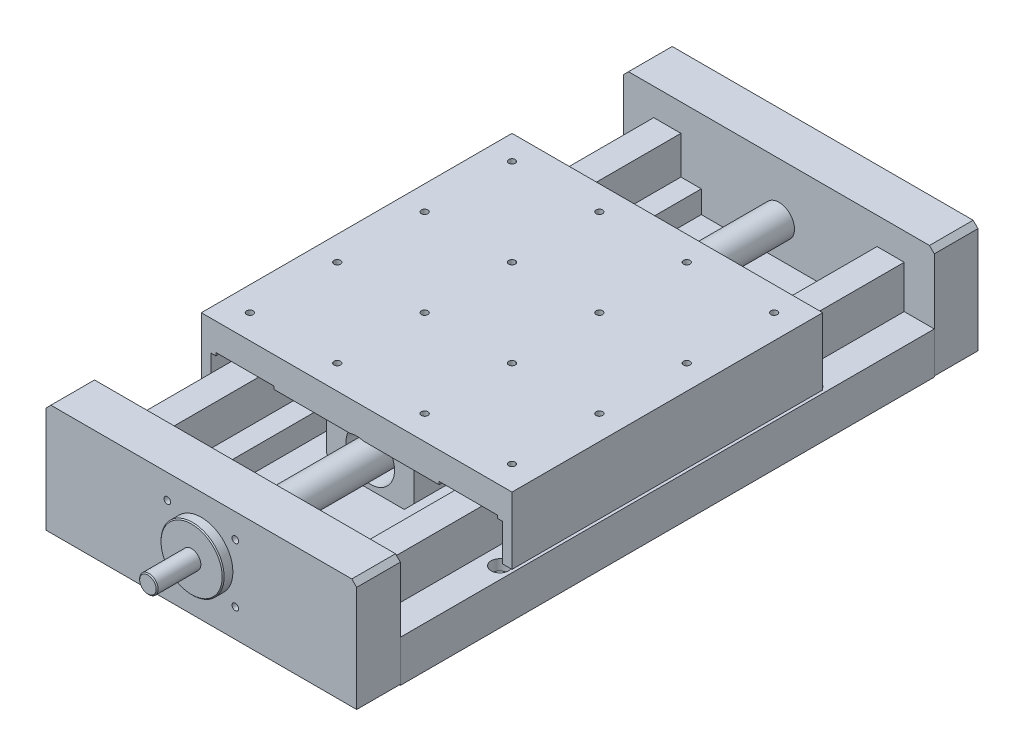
ISO-10303-21;
HEADER;
FILE_DESCRIPTION(('STEP AP214'),'2;1');
FILE_NAME('part.step','',(''),(''),'','','');
FILE_SCHEMA(('AUTOMOTIVE_DESIGN { 1 0 10303 214 1 1 1 1 }'));
ENDSEC;
DATA;
#1=APPLICATION_CONTEXT('core data for automotive mechanical design processes');
#2=APPLICATION_PROTOCOL_DEFINITION('international standard','automotive_design',2000,#1);
#3=PRODUCT_CONTEXT('',#1,'mechanical');
#4=PRODUCT('Part','Part','',(#3));
#5=PRODUCT_RELATED_PRODUCT_CATEGORY('part','',(#4));
#6=PRODUCT_DEFINITION_FORMATION('','',#4);
#7=PRODUCT_DEFINITION_CONTEXT('part definition',#1,'design');
#8=PRODUCT_DEFINITION('design','',#6,#7);
#9=PRODUCT_DEFINITION_SHAPE('','',#8);
#10=(LENGTH_UNIT() NAMED_UNIT(*) SI_UNIT(.MILLI.,.METRE.));
#11=(NAMED_UNIT(*) PLANE_ANGLE_UNIT() SI_UNIT($,.RADIAN.));
#12=(NAMED_UNIT(*) SI_UNIT($,.STERADIAN.) SOLID_ANGLE_UNIT());
#13=UNCERTAINTY_MEASURE_WITH_UNIT(LENGTH_MEASURE(1.E-05),#10,'distance_accuracy_value','');
#14=(GEOMETRIC_REPRESENTATION_CONTEXT(3) GLOBAL_UNCERTAINTY_ASSIGNED_CONTEXT((#13)) GLOBAL_UNIT_ASSIGNED_CONTEXT((#10,
#11,#12)) REPRESENTATION_CONTEXT('',''));
#15=CARTESIAN_POINT('',(0.,0.,0.));
#16=DIRECTION('',(0.,0.,1.));
#17=DIRECTION('',(1.,0.,0.));
#18=AXIS2_PLACEMENT_3D('',#15,#16,#17);
#19=CARTESIAN_POINT('',(160.,89.9999999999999,-45.));
#20=DIRECTION('',(-1.,0.,0.));
#21=DIRECTION('',(0.,-1.,0.));
#22=AXIS2_PLACEMENT_3D('',#19,#20,#21);
#23=PLANE('',#22);
#24=DIRECTION('',(0.,-1.,0.));
#25=VECTOR('',#24,1.);
#26=CARTESIAN_POINT('',(160.,89.9999999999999,-45.));
#27=LINE('',#26,#25);
#28=CARTESIAN_POINT('',(160.,84.9999999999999,-45.));
#29=VERTEX_POINT('',#28);
#30=CARTESIAN_POINT('',(160.,-24.,-45.));
#31=VERTEX_POINT('',#30);
#32=EDGE_CURVE('E97',#29,#31,#27,.T.);
#33=ORIENTED_EDGE('',*,*,#32,.F.);
#34=DIRECTION('',(0.,0.,1.));
#35=VECTOR('',#34,1.);
#36=CARTESIAN_POINT('',(160.,84.9999999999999,-45.));
#37=LINE('',#36,#35);
#38=CARTESIAN_POINT('',(160.,84.9999999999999,0.));
#39=VERTEX_POINT('',#38);
#40=EDGE_CURVE('E12',#29,#39,#37,.T.);
#41=ORIENTED_EDGE('',*,*,#40,.T.);
#42=DIRECTION('',(0.,-1.,0.));
#43=VECTOR('',#42,1.);
#44=CARTESIAN_POINT('',(160.,89.9999999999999,0.));
#45=LINE('',#44,#43);
#46=CARTESIAN_POINT('',(160.,-24.,0.));
#47=VERTEX_POINT('',#46);
#48=EDGE_CURVE('E116',#39,#47,#45,.T.);
#49=ORIENTED_EDGE('',*,*,#48,.T.);
#50=DIRECTION('',(0.,0.,1.));
#51=VECTOR('',#50,1.);
#52=CARTESIAN_POINT('',(160.,-24.,-45.));
#53=LINE('',#52,#51);
#54=EDGE_CURVE('E110',#31,#47,#53,.T.);
#55=ORIENTED_EDGE('',*,*,#54,.F.);
#56=EDGE_LOOP('',(#33,#41,#49,#55));
#57=FACE_BOUND('',#56,.T.);
#58=ADVANCED_FACE('F44',(#57),#23,.F.);
#59=CARTESIAN_POINT('',(160.,-24.,-45.));
#60=DIRECTION('',(0.,1.,0.));
#61=DIRECTION('',(-1.,0.,0.));
#62=AXIS2_PLACEMENT_3D('',#59,#60,#61);
#63=PLANE('',#62);
#64=DIRECTION('',(-1.,0.,0.));
#65=VECTOR('',#64,1.);
#66=CARTESIAN_POINT('',(160.,-24.,0.));
#67=LINE('',#66,#65);
#68=CARTESIAN_POINT('',(-160.,-24.,0.));
#69=VERTEX_POINT('',#68);
#70=EDGE_CURVE('E149',#47,#69,#67,.T.);
#71=ORIENTED_EDGE('',*,*,#70,.T.);
#72=DIRECTION('',(0.,0.,1.));
#73=VECTOR('',#72,1.);
#74=CARTESIAN_POINT('',(-160.,-24.,-45.));
#75=LINE('',#74,#73);
#76=CARTESIAN_POINT('',(-160.,-24.,-45.));
#77=VERTEX_POINT('',#76);
#78=EDGE_CURVE('E112',#77,#69,#75,.T.);
#79=ORIENTED_EDGE('',*,*,#78,.F.);
#80=DIRECTION('',(-1.,0.,0.));
#81=VECTOR('',#80,1.);
#82=CARTESIAN_POINT('',(160.,-24.,-45.));
#83=LINE('',#82,#81);
#84=EDGE_CURVE('E100',#31,#77,#83,.T.);
#85=ORIENTED_EDGE('',*,*,#84,.F.);
#86=ORIENTED_EDGE('',*,*,#54,.T.);
#87=EDGE_LOOP('',(#71,#79,#85,#86));
#88=FACE_BOUND('',#87,.T.);
#89=ADVANCED_FACE('F109',(#88),#63,.F.);
#90=CARTESIAN_POINT('',(-160.,89.9999999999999,-45.));
#91=DIRECTION('',(1.,0.,0.));
#92=DIRECTION('',(0.,0.,-1.));
#93=AXIS2_PLACEMENT_3D('',#90,#91,#92);
#94=PLANE('',#93);
#95=DIRECTION('',(0.,1.,0.));
#96=VECTOR('',#95,1.);
#97=CARTESIAN_POINT('',(-160.,89.9999999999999,0.));
#98=LINE('',#97,#96);
#99=CARTESIAN_POINT('',(-160.,84.9999999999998,0.));
#100=VERTEX_POINT('',#99);
#101=EDGE_CURVE('E147',#69,#100,#98,.T.);
#102=ORIENTED_EDGE('',*,*,#101,.T.);
#103=DIRECTION('',(0.,0.,-1.));
#104=VECTOR('',#103,1.);
#105=CARTESIAN_POINT('',(-160.,84.9999999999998,-45.));
#106=LINE('',#105,#104);
#107=CARTESIAN_POINT('',(-160.,84.9999999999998,-45.));
#108=VERTEX_POINT('',#107);
#109=EDGE_CURVE('E67',#100,#108,#106,.T.);
#110=ORIENTED_EDGE('',*,*,#109,.T.);
#111=DIRECTION('',(0.,1.,0.));
#112=VECTOR('',#111,1.);
#113=CARTESIAN_POINT('',(-160.,89.9999999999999,-45.));
#114=LINE('',#113,#112);
#115=EDGE_CURVE('E113',#77,#108,#114,.T.);
#116=ORIENTED_EDGE('',*,*,#115,.F.);
#117=ORIENTED_EDGE('',*,*,#78,.T.);
#118=EDGE_LOOP('',(#102,#110,#116,#117));
#119=FACE_BOUND('',#118,.T.);
#120=ADVANCED_FACE('F148',(#119),#94,.F.);
#121=CARTESIAN_POINT('',(160.,89.9999999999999,-45.));
#122=DIRECTION('',(0.,-1.,0.));
#123=DIRECTION('',(0.,0.,-1.));
#124=AXIS2_PLACEMENT_3D('',#121,#122,#123);
#125=PLANE('',#124);
#126=DIRECTION('',(1.,0.,0.));
#127=VECTOR('',#126,1.);
#128=CARTESIAN_POINT('',(160.,89.9999999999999,-45.));
#129=LINE('',#128,#127);
#130=CARTESIAN_POINT('',(-155.,89.9999999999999,-45.));
#131=VERTEX_POINT('',#130);
#132=CARTESIAN_POINT('',(155.,89.9999999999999,-45.));
#133=VERTEX_POINT('',#132);
#134=EDGE_CURVE('E122',#131,#133,#129,.T.);
#135=ORIENTED_EDGE('',*,*,#134,.F.);
#136=DIRECTION('',(0.,0.,1.));
#137=VECTOR('',#136,1.);
#138=CARTESIAN_POINT('',(-155.,89.9999999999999,-45.));
#139=LINE('',#138,#137);
#140=CARTESIAN_POINT('',(-155.,89.9999999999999,0.));
#141=VERTEX_POINT('',#140);
#142=EDGE_CURVE('E120',#131,#141,#139,.T.);
#143=ORIENTED_EDGE('',*,*,#142,.T.);
#144=DIRECTION('',(1.,0.,0.));
#145=VECTOR('',#144,1.);
#146=CARTESIAN_POINT('',(160.,89.9999999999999,0.));
#147=LINE('',#146,#145);
#148=CARTESIAN_POINT('',(155.,89.9999999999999,0.));
#149=VERTEX_POINT('',#148);
#150=EDGE_CURVE('E105',#141,#149,#147,.T.);
#151=ORIENTED_EDGE('',*,*,#150,.T.);
#152=DIRECTION('',(0.,0.,-1.));
#153=VECTOR('',#152,1.);
#154=CARTESIAN_POINT('',(155.,89.9999999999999,-45.));
#155=LINE('',#154,#153);
#156=EDGE_CURVE('E118',#149,#133,#155,.T.);
#157=ORIENTED_EDGE('',*,*,#156,.T.);
#158=EDGE_LOOP('',(#135,#143,#151,#157));
#159=FACE_BOUND('',#158,.T.);
#160=ADVANCED_FACE('F138',(#159),#125,.F.);
#161=CARTESIAN_POINT('',(160.,-24.,-45.));
#162=DIRECTION('',(0.,0.,-1.));
#163=DIRECTION('',(-1.,0.,0.));
#164=AXIS2_PLACEMENT_3D('',#161,#162,#163);
#165=PLANE('',#164);
#166=ORIENTED_EDGE('',*,*,#115,.T.);
#167=DIRECTION('',(-0.707106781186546,-0.70710678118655,0.));
#168=VECTOR('',#167,1.);
#169=CARTESIAN_POINT('',(-54.5000000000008,190.5,-45.));
#170=LINE('',#169,#168);
#171=EDGE_CURVE('E52',#108,#131,#170,.F.);
#172=ORIENTED_EDGE('',*,*,#171,.T.);
#173=ORIENTED_EDGE('',*,*,#134,.T.);
#174=DIRECTION('',(-0.707106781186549,0.707106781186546,0.));
#175=VECTOR('',#174,1.);
#176=CARTESIAN_POINT('',(214.5,30.5000000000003,-45.));
#177=LINE('',#176,#175);
#178=EDGE_CURVE('E59',#133,#29,#177,.F.);
#179=ORIENTED_EDGE('',*,*,#178,.T.);
#180=ORIENTED_EDGE('',*,*,#32,.T.);
#181=ORIENTED_EDGE('',*,*,#84,.T.);
#182=EDGE_LOOP('',(#166,#172,#173,#179,#180,#181));
#183=FACE_BOUND('',#182,.T.);
#184=ADVANCED_FACE('F99',(#183),#165,.T.);
#185=CARTESIAN_POINT('',(160.,-24.,0.));
#186=DIRECTION('',(0.,0.,-1.));
#187=DIRECTION('',(-1.,0.,0.));
#188=AXIS2_PLACEMENT_3D('',#185,#186,#187);
#189=PLANE('',#188);
#190=ORIENTED_EDGE('',*,*,#150,.F.);
#191=DIRECTION('',(0.707106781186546,0.70710678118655,0.));
#192=VECTOR('',#191,1.);
#193=CARTESIAN_POINT('',(-155.,89.9999999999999,0.));
#194=LINE('',#193,#192);
#195=EDGE_CURVE('E130',#141,#100,#194,.F.);
#196=ORIENTED_EDGE('',*,*,#195,.T.);
#197=ORIENTED_EDGE('',*,*,#101,.F.);
#198=ORIENTED_EDGE('',*,*,#70,.F.);
#199=ORIENTED_EDGE('',*,*,#48,.F.);
#200=DIRECTION('',(0.707106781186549,-0.707106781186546,0.));
#201=VECTOR('',#200,1.);
#202=CARTESIAN_POINT('',(160.,84.9999999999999,0.));
#203=LINE('',#202,#201);
#204=EDGE_CURVE('E128',#39,#149,#203,.F.);
#205=ORIENTED_EDGE('',*,*,#204,.T.);
#206=EDGE_LOOP('',(#190,#196,#197,#198,#199,#205));
#207=FACE_BOUND('',#206,.T.);
#208=ADVANCED_FACE('F146',(#207),#189,.F.);
#209=CARTESIAN_POINT('',(-155.,89.9999999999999,-45.));
#210=DIRECTION('',(0.707106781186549,-0.707106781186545,0.));
#211=DIRECTION('',(0.707106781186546,0.70710678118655,0.));
#212=AXIS2_PLACEMENT_3D('',#209,#210,#211);
#213=PLANE('',#212);
#214=ORIENTED_EDGE('',*,*,#171,.F.);
#215=ORIENTED_EDGE('',*,*,#109,.F.);
#216=ORIENTED_EDGE('',*,*,#195,.F.);
#217=ORIENTED_EDGE('',*,*,#142,.F.);
#218=EDGE_LOOP('',(#214,#215,#216,#217));
#219=FACE_BOUND('',#218,.T.);
#220=ADVANCED_FACE('F143',(#219),#213,.F.);
#221=CARTESIAN_POINT('',(160.,84.9999999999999,-45.));
#222=DIRECTION('',(-0.707106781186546,-0.707106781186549,0.));
#223=DIRECTION('',(0.707106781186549,-0.707106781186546,0.));
#224=AXIS2_PLACEMENT_3D('',#221,#222,#223);
#225=PLANE('',#224);
#226=ORIENTED_EDGE('',*,*,#178,.F.);
#227=ORIENTED_EDGE('',*,*,#156,.F.);
#228=ORIENTED_EDGE('',*,*,#204,.F.);
#229=ORIENTED_EDGE('',*,*,#40,.F.);
#230=EDGE_LOOP('',(#226,#227,#228,#229));
#231=FACE_BOUND('',#230,.T.);
#232=ADVANCED_FACE('F46',(#231),#225,.F.);
#233=CLOSED_SHELL('',(#58,#89,#120,#160,#184,#208,#220,#232));
#234=MANIFOLD_SOLID_BREP('B2',#233);
#235=CARTESIAN_POINT('',(-160.,-24.,595.));
#236=DIRECTION('',(0.,0.,1.));
#237=DIRECTION('',(1.,0.,0.));
#238=AXIS2_PLACEMENT_3D('',#235,#236,#237);
#239=PLANE('',#238);
#240=CARTESIAN_POINT('',(-35.,64.9999999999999,595.));
#241=DIRECTION('',(0.,0.,1.));
#242=DIRECTION('',(1.,0.,0.));
#243=AXIS2_PLACEMENT_3D('',#240,#241,#242);
#244=CIRCLE('',#243,3.4);
#245=CARTESIAN_POINT('',(-31.6,64.9999999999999,595.));
#246=VERTEX_POINT('',#245);
#247=EDGE_CURVE('E306',#246,#246,#244,.T.);
#248=ORIENTED_EDGE('',*,*,#247,.F.);
#249=EDGE_LOOP('',(#248));
#250=FACE_BOUND('',#249,.T.);
#251=CARTESIAN_POINT('',(-35.,4.9999999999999,595.));
#252=DIRECTION('',(0.,0.,1.));
#253=DIRECTION('',(1.,0.,0.));
#254=AXIS2_PLACEMENT_3D('',#251,#252,#253);
#255=CIRCLE('',#254,3.4);
#256=CARTESIAN_POINT('',(-31.6,4.9999999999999,595.));
#257=VERTEX_POINT('',#256);
#258=EDGE_CURVE('E305',#257,#257,#255,.T.);
#259=ORIENTED_EDGE('',*,*,#258,.F.);
#260=EDGE_LOOP('',(#259));
#261=FACE_BOUND('',#260,.T.);
#262=CARTESIAN_POINT('',(35.,4.9999999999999,595.));
#263=DIRECTION('',(0.,0.,1.));
#264=DIRECTION('',(1.,0.,0.));
#265=AXIS2_PLACEMENT_3D('',#262,#263,#264);
#266=CIRCLE('',#265,3.4);
#267=CARTESIAN_POINT('',(38.4,4.9999999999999,595.));
#268=VERTEX_POINT('',#267);
#269=EDGE_CURVE('E316',#268,#268,#266,.T.);
#270=ORIENTED_EDGE('',*,*,#269,.F.);
#271=EDGE_LOOP('',(#270));
#272=FACE_BOUND('',#271,.T.);
#273=CARTESIAN_POINT('',(35.,64.9999999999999,595.));
#274=DIRECTION('',(0.,0.,1.));
#275=DIRECTION('',(1.,0.,0.));
#276=AXIS2_PLACEMENT_3D('',#273,#274,#275);
#277=CIRCLE('',#276,3.4);
#278=CARTESIAN_POINT('',(38.4,64.9999999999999,595.));
#279=VERTEX_POINT('',#278);
#280=EDGE_CURVE('E322',#279,#279,#277,.T.);
#281=ORIENTED_EDGE('',*,*,#280,.F.);
#282=EDGE_LOOP('',(#281));
#283=FACE_BOUND('',#282,.T.);
#284=DIRECTION('',(0.,1.,0.));
#285=VECTOR('',#284,1.);
#286=CARTESIAN_POINT('',(160.,90.,595.));
#287=LINE('',#286,#285);
#288=CARTESIAN_POINT('',(160.,-24.,595.));
#289=VERTEX_POINT('',#288);
#290=CARTESIAN_POINT('',(160.,85.,595.));
#291=VERTEX_POINT('',#290);
#292=EDGE_CURVE('E341',#289,#291,#287,.T.);
#293=ORIENTED_EDGE('',*,*,#292,.T.);
#294=DIRECTION('',(0.707106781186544,-0.707106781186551,0.));
#295=VECTOR('',#294,1.);
#296=CARTESIAN_POINT('',(54.5000000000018,190.499999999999,595.));
#297=LINE('',#296,#295);
#298=CARTESIAN_POINT('',(155.,90.,595.));
#299=VERTEX_POINT('',#298);
#300=EDGE_CURVE('E374',#291,#299,#297,.F.);
#301=ORIENTED_EDGE('',*,*,#300,.T.);
#302=DIRECTION('',(-1.,0.,0.));
#303=VECTOR('',#302,1.);
#304=CARTESIAN_POINT('',(-160.,90.,595.));
#305=LINE('',#304,#303);
#306=CARTESIAN_POINT('',(-155.,90.,595.));
#307=VERTEX_POINT('',#306);
#308=EDGE_CURVE('E343',#299,#307,#305,.T.);
#309=ORIENTED_EDGE('',*,*,#308,.T.);
#310=DIRECTION('',(0.70710678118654,0.707106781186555,0.));
#311=VECTOR('',#310,1.);
#312=CARTESIAN_POINT('',(-214.5,30.4999999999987,595.));
#313=LINE('',#312,#311);
#314=CARTESIAN_POINT('',(-160.,84.9999999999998,595.));
#315=VERTEX_POINT('',#314);
#316=EDGE_CURVE('E244',#307,#315,#313,.F.);
#317=ORIENTED_EDGE('',*,*,#316,.T.);
#318=DIRECTION('',(0.,-1.,0.));
#319=VECTOR('',#318,1.);
#320=CARTESIAN_POINT('',(-160.,90.,595.));
#321=LINE('',#320,#319);
#322=CARTESIAN_POINT('',(-160.,-24.,595.));
#323=VERTEX_POINT('',#322);
#324=EDGE_CURVE('E336',#315,#323,#321,.T.);
#325=ORIENTED_EDGE('',*,*,#324,.T.);
#326=DIRECTION('',(1.,0.,0.));
#327=VECTOR('',#326,1.);
#328=CARTESIAN_POINT('',(-160.,-24.,595.));
#329=LINE('',#328,#327);
#330=EDGE_CURVE('E338',#323,#289,#329,.T.);
#331=ORIENTED_EDGE('',*,*,#330,.T.);
#332=EDGE_LOOP('',(#293,#301,#309,#317,#325,#331));
#333=FACE_BOUND('',#332,.T.);
#334=CARTESIAN_POINT('',(0.,34.9999999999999,595.));
#335=DIRECTION('',(0.,0.,1.));
#336=DIRECTION('',(1.,0.,0.));
#337=AXIS2_PLACEMENT_3D('',#334,#335,#336);
#338=CIRCLE('',#337,32.5);
#339=CARTESIAN_POINT('',(32.5,34.9999999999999,595.));
#340=VERTEX_POINT('',#339);
#341=EDGE_CURVE('E328',#340,#340,#338,.T.);
#342=ORIENTED_EDGE('',*,*,#341,.F.);
#343=EDGE_LOOP('',(#342));
#344=FACE_BOUND('',#343,.T.);
#345=ADVANCED_FACE('F229',(#250,#261,#272,#283,#333,#344),#239,.T.);
#346=CARTESIAN_POINT('',(-160.,-24.,550.));
#347=DIRECTION('',(0.,0.,1.));
#348=DIRECTION('',(1.,0.,0.));
#349=AXIS2_PLACEMENT_3D('',#346,#347,#348);
#350=PLANE('',#349);
#351=DIRECTION('',(-1.,0.,0.));
#352=VECTOR('',#351,1.);
#353=CARTESIAN_POINT('',(-160.,90.,550.));
#354=LINE('',#353,#352);
#355=CARTESIAN_POINT('',(155.,90.,550.));
#356=VERTEX_POINT('',#355);
#357=CARTESIAN_POINT('',(-155.,90.,550.));
#358=VERTEX_POINT('',#357);
#359=EDGE_CURVE('E339',#356,#358,#354,.T.);
#360=ORIENTED_EDGE('',*,*,#359,.F.);
#361=DIRECTION('',(-0.707106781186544,0.707106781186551,0.));
#362=VECTOR('',#361,1.);
#363=CARTESIAN_POINT('',(155.,90.,550.));
#364=LINE('',#363,#362);
#365=CARTESIAN_POINT('',(160.,85.,550.));
#366=VERTEX_POINT('',#365);
#367=EDGE_CURVE('E370',#356,#366,#364,.F.);
#368=ORIENTED_EDGE('',*,*,#367,.T.);
#369=DIRECTION('',(0.,1.,0.));
#370=VECTOR('',#369,1.);
#371=CARTESIAN_POINT('',(160.,90.,550.));
#372=LINE('',#371,#370);
#373=CARTESIAN_POINT('',(160.,-24.,550.));
#374=VERTEX_POINT('',#373);
#375=EDGE_CURVE('E349',#374,#366,#372,.T.);
#376=ORIENTED_EDGE('',*,*,#375,.F.);
#377=DIRECTION('',(1.,0.,0.));
#378=VECTOR('',#377,1.);
#379=CARTESIAN_POINT('',(-160.,-24.,550.));
#380=LINE('',#379,#378);
#381=CARTESIAN_POINT('',(-160.,-24.,550.));
#382=VERTEX_POINT('',#381);
#383=EDGE_CURVE('E347',#382,#374,#380,.T.);
#384=ORIENTED_EDGE('',*,*,#383,.F.);
#385=DIRECTION('',(0.,-1.,0.));
#386=VECTOR('',#385,1.);
#387=CARTESIAN_POINT('',(-160.,90.,550.));
#388=LINE('',#387,#386);
#389=CARTESIAN_POINT('',(-160.,84.9999999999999,550.));
#390=VERTEX_POINT('',#389);
#391=EDGE_CURVE('E335',#390,#382,#388,.T.);
#392=ORIENTED_EDGE('',*,*,#391,.F.);
#393=DIRECTION('',(-0.70710678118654,-0.707106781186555,0.));
#394=VECTOR('',#393,1.);
#395=CARTESIAN_POINT('',(-160.,84.9999999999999,550.));
#396=LINE('',#395,#394);
#397=EDGE_CURVE('E368',#390,#358,#396,.F.);
#398=ORIENTED_EDGE('',*,*,#397,.T.);
#399=EDGE_LOOP('',(#360,#368,#376,#384,#392,#398));
#400=FACE_BOUND('',#399,.T.);
#401=CARTESIAN_POINT('',(0.,34.9999999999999,550.));
#402=DIRECTION('',(0.,0.,1.));
#403=DIRECTION('',(1.,0.,0.));
#404=AXIS2_PLACEMENT_3D('',#401,#402,#403);
#405=CIRCLE('',#404,16.);
#406=CARTESIAN_POINT('',(16.,34.9999999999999,550.));
#407=VERTEX_POINT('',#406);
#408=EDGE_CURVE('E358',#407,#407,#405,.F.);
#409=ORIENTED_EDGE('',*,*,#408,.F.);
#410=EDGE_LOOP('',(#409));
#411=FACE_BOUND('',#410,.T.);
#412=ADVANCED_FACE('F399',(#400,#411),#350,.F.);
#413=CARTESIAN_POINT('',(-160.,90.,595.));
#414=DIRECTION('',(1.,0.,0.));
#415=DIRECTION('',(0.,1.,0.));
#416=AXIS2_PLACEMENT_3D('',#413,#414,#415);
#417=PLANE('',#416);
#418=ORIENTED_EDGE('',*,*,#324,.F.);
#419=DIRECTION('',(0.,0.,-1.));
#420=VECTOR('',#419,1.);
#421=CARTESIAN_POINT('',(-160.,84.9999999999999,595.));
#422=LINE('',#421,#420);
#423=EDGE_CURVE('E376',#315,#390,#422,.T.);
#424=ORIENTED_EDGE('',*,*,#423,.T.);
#425=ORIENTED_EDGE('',*,*,#391,.T.);
#426=DIRECTION('',(0.,0.,-1.));
#427=VECTOR('',#426,1.);
#428=CARTESIAN_POINT('',(-160.,-24.,595.));
#429=LINE('',#428,#427);
#430=EDGE_CURVE('E355',#323,#382,#429,.T.);
#431=ORIENTED_EDGE('',*,*,#430,.F.);
#432=EDGE_LOOP('',(#418,#424,#425,#431));
#433=FACE_BOUND('',#432,.T.);
#434=ADVANCED_FACE('F405',(#433),#417,.F.);
#435=CARTESIAN_POINT('',(-160.,-24.,595.));
#436=DIRECTION('',(0.,1.,0.));
#437=DIRECTION('',(-1.,0.,0.));
#438=AXIS2_PLACEMENT_3D('',#435,#436,#437);
#439=PLANE('',#438);
#440=ORIENTED_EDGE('',*,*,#383,.T.);
#441=DIRECTION('',(0.,0.,-1.));
#442=VECTOR('',#441,1.);
#443=CARTESIAN_POINT('',(160.,-24.,595.));
#444=LINE('',#443,#442);
#445=EDGE_CURVE('E345',#289,#374,#444,.T.);
#446=ORIENTED_EDGE('',*,*,#445,.F.);
#447=ORIENTED_EDGE('',*,*,#330,.F.);
#448=ORIENTED_EDGE('',*,*,#430,.T.);
#449=EDGE_LOOP('',(#440,#446,#447,#448));
#450=FACE_BOUND('',#449,.T.);
#451=ADVANCED_FACE('F422',(#450),#439,.F.);
#452=CARTESIAN_POINT('',(160.,90.,595.));
#453=DIRECTION('',(-1.,0.,0.));
#454=DIRECTION('',(0.,0.,1.));
#455=AXIS2_PLACEMENT_3D('',#452,#453,#454);
#456=PLANE('',#455);
#457=ORIENTED_EDGE('',*,*,#375,.T.);
#458=DIRECTION('',(0.,0.,1.));
#459=VECTOR('',#458,1.);
#460=CARTESIAN_POINT('',(160.,85.,595.));
#461=LINE('',#460,#459);
#462=EDGE_CURVE('E252',#366,#291,#461,.T.);
#463=ORIENTED_EDGE('',*,*,#462,.T.);
#464=ORIENTED_EDGE('',*,*,#292,.F.);
#465=ORIENTED_EDGE('',*,*,#445,.T.);
#466=EDGE_LOOP('',(#457,#463,#464,#465));
#467=FACE_BOUND('',#466,.T.);
#468=ADVANCED_FACE('F418',(#467),#456,.F.);
#469=CARTESIAN_POINT('',(-160.,90.,595.));
#470=DIRECTION('',(0.,-1.,0.));
#471=DIRECTION('',(0.,0.,-1.));
#472=AXIS2_PLACEMENT_3D('',#469,#470,#471);
#473=PLANE('',#472);
#474=ORIENTED_EDGE('',*,*,#308,.F.);
#475=DIRECTION('',(0.,0.,-1.));
#476=VECTOR('',#475,1.);
#477=CARTESIAN_POINT('',(155.,90.,595.));
#478=LINE('',#477,#476);
#479=EDGE_CURVE('E365',#299,#356,#478,.T.);
#480=ORIENTED_EDGE('',*,*,#479,.T.);
#481=ORIENTED_EDGE('',*,*,#359,.T.);
#482=DIRECTION('',(0.,0.,1.));
#483=VECTOR('',#482,1.);
#484=CARTESIAN_POINT('',(-155.,90.,595.));
#485=LINE('',#484,#483);
#486=EDGE_CURVE('E361',#358,#307,#485,.T.);
#487=ORIENTED_EDGE('',*,*,#486,.T.);
#488=EDGE_LOOP('',(#474,#480,#481,#487));
#489=FACE_BOUND('',#488,.T.);
#490=ADVANCED_FACE('F414',(#489),#473,.F.);
#491=CARTESIAN_POINT('',(0.,34.9999999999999,640.254833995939));
#492=DIRECTION('',(0.,0.,-1.));
#493=DIRECTION('',(-1.,0.,0.));
#494=AXIS2_PLACEMENT_3D('',#491,#492,#493);
#495=CYLINDRICAL_SURFACE('',#494,16.);
#496=CARTESIAN_POINT('',(0.,34.9999999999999,0.));
#497=DIRECTION('',(0.,0.,1.));
#498=DIRECTION('',(1.,0.,0.));
#499=AXIS2_PLACEMENT_3D('',#496,#497,#498);
#500=CIRCLE('',#499,16.);
#501=CARTESIAN_POINT('',(16.,34.9999999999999,0.));
#502=VERTEX_POINT('',#501);
#503=EDGE_CURVE('E332',#502,#502,#500,.T.);
#504=ORIENTED_EDGE('',*,*,#503,.T.);
#505=EDGE_LOOP('',(#504));
#506=FACE_BOUND('',#505,.T.);
#507=ORIENTED_EDGE('',*,*,#408,.T.);
#508=EDGE_LOOP('',(#507));
#509=FACE_BOUND('',#508,.T.);
#510=ADVANCED_FACE('F417',(#506,#509),#495,.T.);
#511=CARTESIAN_POINT('',(0.,34.9999999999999,0.));
#512=DIRECTION('',(0.,0.,1.));
#513=DIRECTION('',(1.,0.,0.));
#514=AXIS2_PLACEMENT_3D('',#511,#512,#513);
#515=PLANE('',#514);
#516=ORIENTED_EDGE('',*,*,#503,.F.);
#517=EDGE_LOOP('',(#516));
#518=FACE_BOUND('',#517,.T.);
#519=ADVANCED_FACE('F469',(#518),#515,.F.);
#520=CARTESIAN_POINT('',(0.,34.9999999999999,605.));
#521=DIRECTION('',(0.,0.,1.));
#522=DIRECTION('',(1.,0.,0.));
#523=AXIS2_PLACEMENT_3D('',#520,#521,#522);
#524=PLANE('',#523);
#525=CARTESIAN_POINT('',(0.,34.9999999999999,605.));
#526=DIRECTION('',(0.,0.,1.));
#527=DIRECTION('',(1.,0.,0.));
#528=AXIS2_PLACEMENT_3D('',#525,#526,#527);
#529=CIRCLE('',#528,31.5);
#530=CARTESIAN_POINT('',(31.5,34.9999999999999,605.));
#531=VERTEX_POINT('',#530);
#532=EDGE_CURVE('E237',#531,#531,#529,.T.);
#533=ORIENTED_EDGE('',*,*,#532,.T.);
#534=EDGE_LOOP('',(#533));
#535=FACE_BOUND('',#534,.T.);
#536=CARTESIAN_POINT('',(0.,34.9999999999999,605.));
#537=DIRECTION('',(0.,0.,1.));
#538=DIRECTION('',(1.,0.,0.));
#539=AXIS2_PLACEMENT_3D('',#536,#537,#538);
#540=CIRCLE('',#539,9.5);
#541=CARTESIAN_POINT('',(9.50000000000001,34.9999999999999,605.));
#542=VERTEX_POINT('',#541);
#543=EDGE_CURVE('E331',#542,#542,#540,.T.);
#544=ORIENTED_EDGE('',*,*,#543,.F.);
#545=EDGE_LOOP('',(#544));
#546=FACE_BOUND('',#545,.T.);
#547=ADVANCED_FACE('F387',(#535,#546),#524,.T.);
#548=CARTESIAN_POINT('',(0.,34.9999999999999,605.));
#549=DIRECTION('',(0.,0.,-1.));
#550=DIRECTION('',(-1.,0.,0.));
#551=AXIS2_PLACEMENT_3D('',#548,#549,#550);
#552=CYLINDRICAL_SURFACE('',#551,32.5);
#553=CARTESIAN_POINT('',(0.,34.9999999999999,604.));
#554=DIRECTION('',(0.,0.,1.));
#555=DIRECTION('',(1.,0.,0.));
#556=AXIS2_PLACEMENT_3D('',#553,#554,#555);
#557=CIRCLE('',#556,32.5);
#558=CARTESIAN_POINT('',(32.5,34.9999999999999,604.));
#559=VERTEX_POINT('',#558);
#560=EDGE_CURVE('E42',#559,#559,#557,.F.);
#561=ORIENTED_EDGE('',*,*,#560,.T.);
#562=EDGE_LOOP('',(#561));
#563=FACE_BOUND('',#562,.T.);
#564=ORIENTED_EDGE('',*,*,#341,.T.);
#565=EDGE_LOOP('',(#564));
#566=FACE_BOUND('',#565,.T.);
#567=ADVANCED_FACE('F459',(#563,#566),#552,.T.);
#568=CARTESIAN_POINT('',(0.,34.9999999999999,650.));
#569=DIRECTION('',(0.,0.,1.));
#570=DIRECTION('',(1.,0.,0.));
#571=AXIS2_PLACEMENT_3D('',#568,#569,#570);
#572=PLANE('',#571);
#573=CARTESIAN_POINT('',(0.,34.9999999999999,650.));
#574=DIRECTION('',(0.,0.,1.));
#575=DIRECTION('',(1.,0.,0.));
#576=AXIS2_PLACEMENT_3D('',#573,#574,#575);
#577=CIRCLE('',#576,8.49999999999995);
#578=CARTESIAN_POINT('',(8.49999999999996,34.9999999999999,650.));
#579=VERTEX_POINT('',#578);
#580=EDGE_CURVE('E379',#579,#579,#577,.T.);
#581=ORIENTED_EDGE('',*,*,#580,.T.);
#582=EDGE_LOOP('',(#581));
#583=FACE_BOUND('',#582,.T.);
#584=ADVANCED_FACE('F461',(#583),#572,.T.);
#585=CARTESIAN_POINT('',(0.,34.9999999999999,650.));
#586=DIRECTION('',(0.,0.,-1.));
#587=DIRECTION('',(-1.,0.,0.));
#588=AXIS2_PLACEMENT_3D('',#585,#586,#587);
#589=CYLINDRICAL_SURFACE('',#588,9.5);
#590=CARTESIAN_POINT('',(0.,34.9999999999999,649.));
#591=DIRECTION('',(0.,0.,1.));
#592=DIRECTION('',(1.,0.,0.));
#593=AXIS2_PLACEMENT_3D('',#590,#591,#592);
#594=CIRCLE('',#593,9.5);
#595=CARTESIAN_POINT('',(9.50000000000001,34.9999999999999,649.));
#596=VERTEX_POINT('',#595);
#597=EDGE_CURVE('E382',#596,#596,#594,.F.);
#598=ORIENTED_EDGE('',*,*,#597,.T.);
#599=EDGE_LOOP('',(#598));
#600=FACE_BOUND('',#599,.T.);
#601=ORIENTED_EDGE('',*,*,#543,.T.);
#602=EDGE_LOOP('',(#601));
#603=FACE_BOUND('',#602,.T.);
#604=ADVANCED_FACE('F411',(#600,#603),#589,.T.);
#605=CARTESIAN_POINT('',(155.,90.,595.));
#606=DIRECTION('',(-0.707106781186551,-0.707106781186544,0.));
#607=DIRECTION('',(0.707106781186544,-0.707106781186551,0.));
#608=AXIS2_PLACEMENT_3D('',#605,#606,#607);
#609=PLANE('',#608);
#610=ORIENTED_EDGE('',*,*,#300,.F.);
#611=ORIENTED_EDGE('',*,*,#462,.F.);
#612=ORIENTED_EDGE('',*,*,#367,.F.);
#613=ORIENTED_EDGE('',*,*,#479,.F.);
#614=EDGE_LOOP('',(#610,#611,#612,#613));
#615=FACE_BOUND('',#614,.T.);
#616=ADVANCED_FACE('F429',(#615),#609,.F.);
#617=CARTESIAN_POINT('',(-160.,84.9999999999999,595.));
#618=DIRECTION('',(0.707106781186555,-0.70710678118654,0.));
#619=DIRECTION('',(0.70710678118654,0.707106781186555,0.));
#620=AXIS2_PLACEMENT_3D('',#617,#618,#619);
#621=PLANE('',#620);
#622=ORIENTED_EDGE('',*,*,#316,.F.);
#623=ORIENTED_EDGE('',*,*,#486,.F.);
#624=ORIENTED_EDGE('',*,*,#397,.F.);
#625=ORIENTED_EDGE('',*,*,#423,.F.);
#626=EDGE_LOOP('',(#622,#623,#624,#625));
#627=FACE_BOUND('',#626,.T.);
#628=ADVANCED_FACE('F432',(#627),#621,.F.);
#629=CARTESIAN_POINT('',(35.,64.9999999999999,575.25));
#630=DIRECTION('',(0.,0.,1.));
#631=DIRECTION('',(1.,0.,0.));
#632=AXIS2_PLACEMENT_3D('',#629,#630,#631);
#633=CONICAL_SURFACE('',#632,3.39999999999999,1.02974425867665);
#634=CARTESIAN_POINT('',(35.,64.9999999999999,573.207073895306));
#635=VERTEX_POINT('',#634);
#636=VERTEX_LOOP('',#635);
#637=FACE_BOUND('',#636,.T.);
#638=CARTESIAN_POINT('',(35.,64.9999999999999,575.25));
#639=DIRECTION('',(0.,0.,1.));
#640=DIRECTION('',(1.,0.,0.));
#641=AXIS2_PLACEMENT_3D('',#638,#639,#640);
#642=CIRCLE('',#641,3.39999999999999);
#643=CARTESIAN_POINT('',(38.4,64.9999999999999,575.25));
#644=VERTEX_POINT('',#643);
#645=EDGE_CURVE('E325',#644,#644,#642,.T.);
#646=ORIENTED_EDGE('',*,*,#645,.T.);
#647=EDGE_LOOP('',(#646));
#648=FACE_BOUND('',#647,.T.);
#649=ADVANCED_FACE('F435',(#637,#648),#633,.F.);
#650=CARTESIAN_POINT('',(35.,64.9999999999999,595.));
#651=DIRECTION('',(0.,0.,1.));
#652=DIRECTION('',(1.,0.,0.));
#653=AXIS2_PLACEMENT_3D('',#650,#651,#652);
#654=CYLINDRICAL_SURFACE('',#653,3.4);
#655=ORIENTED_EDGE('',*,*,#645,.F.);
#656=EDGE_LOOP('',(#655));
#657=FACE_BOUND('',#656,.T.);
#658=ORIENTED_EDGE('',*,*,#280,.T.);
#659=EDGE_LOOP('',(#658));
#660=FACE_BOUND('',#659,.T.);
#661=ADVANCED_FACE('F440',(#657,#660),#654,.F.);
#662=CARTESIAN_POINT('',(35.,4.9999999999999,575.25));
#663=DIRECTION('',(0.,0.,1.));
#664=DIRECTION('',(1.,0.,0.));
#665=AXIS2_PLACEMENT_3D('',#662,#663,#664);
#666=CONICAL_SURFACE('',#665,3.39999999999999,1.02974425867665);
#667=CARTESIAN_POINT('',(35.,4.9999999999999,573.207073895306));
#668=VERTEX_POINT('',#667);
#669=VERTEX_LOOP('',#668);
#670=FACE_BOUND('',#669,.T.);
#671=CARTESIAN_POINT('',(35.,4.9999999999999,575.25));
#672=DIRECTION('',(0.,0.,1.));
#673=DIRECTION('',(1.,0.,0.));
#674=AXIS2_PLACEMENT_3D('',#671,#672,#673);
#675=CIRCLE('',#674,3.39999999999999);
#676=CARTESIAN_POINT('',(38.4,4.9999999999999,575.25));
#677=VERTEX_POINT('',#676);
#678=EDGE_CURVE('E319',#677,#677,#675,.T.);
#679=ORIENTED_EDGE('',*,*,#678,.T.);
#680=EDGE_LOOP('',(#679));
#681=FACE_BOUND('',#680,.T.);
#682=ADVANCED_FACE('F561',(#670,#681),#666,.F.);
#683=CARTESIAN_POINT('',(35.,4.9999999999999,595.));
#684=DIRECTION('',(0.,0.,1.));
#685=DIRECTION('',(1.,0.,0.));
#686=AXIS2_PLACEMENT_3D('',#683,#684,#685);
#687=CYLINDRICAL_SURFACE('',#686,3.4);
#688=ORIENTED_EDGE('',*,*,#678,.F.);
#689=EDGE_LOOP('',(#688));
#690=FACE_BOUND('',#689,.T.);
#691=ORIENTED_EDGE('',*,*,#269,.T.);
#692=EDGE_LOOP('',(#691));
#693=FACE_BOUND('',#692,.T.);
#694=ADVANCED_FACE('F553',(#690,#693),#687,.F.);
#695=CARTESIAN_POINT('',(-35.,4.9999999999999,575.25));
#696=DIRECTION('',(0.,0.,1.));
#697=DIRECTION('',(1.,0.,0.));
#698=AXIS2_PLACEMENT_3D('',#695,#696,#697);
#699=CONICAL_SURFACE('',#698,3.39999999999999,1.02974425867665);
#700=CARTESIAN_POINT('',(-35.,4.9999999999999,573.207073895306));
#701=VERTEX_POINT('',#700);
#702=VERTEX_LOOP('',#701);
#703=FACE_BOUND('',#702,.T.);
#704=CARTESIAN_POINT('',(-35.,4.9999999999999,575.25));
#705=DIRECTION('',(0.,0.,1.));
#706=DIRECTION('',(1.,0.,0.));
#707=AXIS2_PLACEMENT_3D('',#704,#705,#706);
#708=CIRCLE('',#707,3.39999999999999);
#709=CARTESIAN_POINT('',(-31.6,4.9999999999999,575.25));
#710=VERTEX_POINT('',#709);
#711=EDGE_CURVE('E309',#710,#710,#708,.T.);
#712=ORIENTED_EDGE('',*,*,#711,.T.);
#713=EDGE_LOOP('',(#712));
#714=FACE_BOUND('',#713,.T.);
#715=ADVANCED_FACE('F545',(#703,#714),#699,.F.);
#716=CARTESIAN_POINT('',(-35.,4.9999999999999,595.));
#717=DIRECTION('',(0.,0.,1.));
#718=DIRECTION('',(1.,0.,0.));
#719=AXIS2_PLACEMENT_3D('',#716,#717,#718);
#720=CYLINDRICAL_SURFACE('',#719,3.4);
#721=ORIENTED_EDGE('',*,*,#711,.F.);
#722=EDGE_LOOP('',(#721));
#723=FACE_BOUND('',#722,.T.);
#724=ORIENTED_EDGE('',*,*,#258,.T.);
#725=EDGE_LOOP('',(#724));
#726=FACE_BOUND('',#725,.T.);
#727=ADVANCED_FACE('F299',(#723,#726),#720,.F.);
#728=CARTESIAN_POINT('',(-35.,64.9999999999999,575.25));
#729=DIRECTION('',(0.,0.,1.));
#730=DIRECTION('',(1.,0.,0.));
#731=AXIS2_PLACEMENT_3D('',#728,#729,#730);
#732=CONICAL_SURFACE('',#731,3.39999999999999,1.02974425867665);
#733=CARTESIAN_POINT('',(-35.,64.9999999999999,573.207073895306));
#734=VERTEX_POINT('',#733);
#735=VERTEX_LOOP('',#734);
#736=FACE_BOUND('',#735,.T.);
#737=CARTESIAN_POINT('',(-35.,64.9999999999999,575.25));
#738=DIRECTION('',(0.,0.,1.));
#739=DIRECTION('',(1.,0.,0.));
#740=AXIS2_PLACEMENT_3D('',#737,#738,#739);
#741=CIRCLE('',#740,3.39999999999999);
#742=CARTESIAN_POINT('',(-31.6,64.9999999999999,575.25));
#743=VERTEX_POINT('',#742);
#744=EDGE_CURVE('E303',#743,#743,#741,.T.);
#745=ORIENTED_EDGE('',*,*,#744,.T.);
#746=EDGE_LOOP('',(#745));
#747=FACE_BOUND('',#746,.T.);
#748=ADVANCED_FACE('F295',(#736,#747),#732,.F.);
#749=CARTESIAN_POINT('',(-35.,64.9999999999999,595.));
#750=DIRECTION('',(0.,0.,1.));
#751=DIRECTION('',(1.,0.,0.));
#752=AXIS2_PLACEMENT_3D('',#749,#750,#751);
#753=CYLINDRICAL_SURFACE('',#752,3.4);
#754=ORIENTED_EDGE('',*,*,#744,.F.);
#755=EDGE_LOOP('',(#754));
#756=FACE_BOUND('',#755,.T.);
#757=ORIENTED_EDGE('',*,*,#247,.T.);
#758=EDGE_LOOP('',(#757));
#759=FACE_BOUND('',#758,.T.);
#760=ADVANCED_FACE('F298',(#756,#759),#753,.F.);
#761=CARTESIAN_POINT('',(0.,34.9999999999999,650.));
#762=DIRECTION('',(0.,0.,-1.));
#763=DIRECTION('',(-1.,0.,0.));
#764=AXIS2_PLACEMENT_3D('',#761,#762,#763);
#765=CONICAL_SURFACE('',#764,8.49999999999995,0.785398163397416);
#766=ORIENTED_EDGE('',*,*,#597,.F.);
#767=EDGE_LOOP('',(#766));
#768=FACE_BOUND('',#767,.T.);
#769=ORIENTED_EDGE('',*,*,#580,.F.);
#770=EDGE_LOOP('',(#769));
#771=FACE_BOUND('',#770,.T.);
#772=ADVANCED_FACE('F391',(#768,#771),#765,.T.);
#773=CARTESIAN_POINT('',(0.,34.9999999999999,605.));
#774=DIRECTION('',(0.,0.,-1.));
#775=DIRECTION('',(-1.,0.,0.));
#776=AXIS2_PLACEMENT_3D('',#773,#774,#775);
#777=CONICAL_SURFACE('',#776,31.5,0.785398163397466);
#778=ORIENTED_EDGE('',*,*,#560,.F.);
#779=EDGE_LOOP('',(#778));
#780=FACE_BOUND('',#779,.T.);
#781=ORIENTED_EDGE('',*,*,#532,.F.);
#782=EDGE_LOOP('',(#781));
#783=FACE_BOUND('',#782,.T.);
#784=ADVANCED_FACE('F231',(#780,#783),#777,.T.);
#785=CLOSED_SHELL('',(#345,#412,#434,#451,#468,#490,#510,#519,#547,#567,#584,#604,#616,#628,
#649,#661,#682,#694,#715,#727,#748,#760,#772,#784));
#786=MANIFOLD_SOLID_BREP('B6',#785);
#787=CARTESIAN_POINT('',(-160.,90.,435.));
#788=DIRECTION('',(0.,-1.,0.));
#789=DIRECTION('',(1.,0.,0.));
#790=AXIS2_PLACEMENT_3D('',#787,#788,#789);
#791=PLANE('',#790);
#792=CARTESIAN_POINT('',(-135.,90.,230.));
#793=DIRECTION('',(0.,1.,0.));
#794=DIRECTION('',(0.,0.,1.));
#795=AXIS2_PLACEMENT_3D('',#792,#793,#794);
#796=CIRCLE('',#795,3.39999999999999);
#797=CARTESIAN_POINT('',(-135.,90.,233.4));
#798=VERTEX_POINT('',#797);
#799=EDGE_CURVE('E1050',#798,#798,#796,.T.);
#800=ORIENTED_EDGE('',*,*,#799,.F.);
#801=EDGE_LOOP('',(#800));
#802=FACE_BOUND('',#801,.T.);
#803=CARTESIAN_POINT('',(-45.,89.9999999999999,140.));
#804=DIRECTION('',(0.,1.,0.));
#805=DIRECTION('',(0.,0.,1.));
#806=AXIS2_PLACEMENT_3D('',#803,#804,#805);
#807=CIRCLE('',#806,3.4);
#808=CARTESIAN_POINT('',(-45.,89.9999999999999,143.4));
#809=VERTEX_POINT('',#808);
#810=EDGE_CURVE('E1067',#809,#809,#807,.T.);
#811=ORIENTED_EDGE('',*,*,#810,.F.);
#812=EDGE_LOOP('',(#811));
#813=FACE_BOUND('',#812,.T.);
#814=CARTESIAN_POINT('',(45.,89.9999999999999,140.));
#815=DIRECTION('',(0.,1.,0.));
#816=DIRECTION('',(0.,0.,1.));
#817=AXIS2_PLACEMENT_3D('',#814,#815,#816);
#818=CIRCLE('',#817,3.4);
#819=CARTESIAN_POINT('',(45.,89.9999999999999,143.4));
#820=VERTEX_POINT('',#819);
#821=EDGE_CURVE('E1073',#820,#820,#818,.T.);
#822=ORIENTED_EDGE('',*,*,#821,.F.);
#823=EDGE_LOOP('',(#822));
#824=FACE_BOUND('',#823,.T.);
#825=CARTESIAN_POINT('',(45.,89.9999999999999,230.));
#826=DIRECTION('',(0.,1.,0.));
#827=DIRECTION('',(0.,0.,1.));
#828=AXIS2_PLACEMENT_3D('',#825,#826,#827);
#829=CIRCLE('',#828,3.4);
#830=CARTESIAN_POINT('',(45.,89.9999999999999,233.4));
#831=VERTEX_POINT('',#830);
#832=EDGE_CURVE('E1079',#831,#831,#829,.T.);
#833=ORIENTED_EDGE('',*,*,#832,.F.);
#834=EDGE_LOOP('',(#833));
#835=FACE_BOUND('',#834,.T.);
#836=CARTESIAN_POINT('',(135.,89.9999999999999,230.));
#837=DIRECTION('',(0.,1.,0.));
#838=DIRECTION('',(0.,0.,1.));
#839=AXIS2_PLACEMENT_3D('',#836,#837,#838);
#840=CIRCLE('',#839,3.39999999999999);
#841=CARTESIAN_POINT('',(135.,89.9999999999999,233.4));
#842=VERTEX_POINT('',#841);
#843=EDGE_CURVE('E1085',#842,#842,#840,.T.);
#844=ORIENTED_EDGE('',*,*,#843,.F.);
#845=EDGE_LOOP('',(#844));
#846=FACE_BOUND('',#845,.T.);
#847=CARTESIAN_POINT('',(135.,89.9999999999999,140.));
#848=DIRECTION('',(0.,1.,0.));
#849=DIRECTION('',(0.,0.,1.));
#850=AXIS2_PLACEMENT_3D('',#847,#848,#849);
#851=CIRCLE('',#850,3.39999999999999);
#852=CARTESIAN_POINT('',(135.,89.9999999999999,143.4));
#853=VERTEX_POINT('',#852);
#854=EDGE_CURVE('E1091',#853,#853,#851,.T.);
#855=ORIENTED_EDGE('',*,*,#854,.F.);
#856=EDGE_LOOP('',(#855));
#857=FACE_BOUND('',#856,.T.);
#858=CARTESIAN_POINT('',(135.,89.9999999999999,320.));
#859=DIRECTION('',(0.,1.,0.));
#860=DIRECTION('',(0.,0.,1.));
#861=AXIS2_PLACEMENT_3D('',#858,#859,#860);
#862=CIRCLE('',#861,3.39999999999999);
#863=CARTESIAN_POINT('',(135.,89.9999999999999,323.4));
#864=VERTEX_POINT('',#863);
#865=EDGE_CURVE('E1097',#864,#864,#862,.T.);
#866=ORIENTED_EDGE('',*,*,#865,.F.);
#867=EDGE_LOOP('',(#866));
#868=FACE_BOUND('',#867,.T.);
#869=CARTESIAN_POINT('',(135.,89.9999999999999,410.));
#870=DIRECTION('',(0.,1.,0.));
#871=DIRECTION('',(0.,0.,1.));
#872=AXIS2_PLACEMENT_3D('',#869,#870,#871);
#873=CIRCLE('',#872,3.39999999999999);
#874=CARTESIAN_POINT('',(135.,89.9999999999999,413.4));
#875=VERTEX_POINT('',#874);
#876=EDGE_CURVE('E1103',#875,#875,#873,.T.);
#877=ORIENTED_EDGE('',*,*,#876,.F.);
#878=EDGE_LOOP('',(#877));
#879=FACE_BOUND('',#878,.T.);
#880=CARTESIAN_POINT('',(45.0000000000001,89.9999999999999,410.));
#881=DIRECTION('',(0.,1.,0.));
#882=DIRECTION('',(0.,0.,1.));
#883=AXIS2_PLACEMENT_3D('',#880,#881,#882);
#884=CIRCLE('',#883,3.4);
#885=CARTESIAN_POINT('',(45.0000000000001,89.9999999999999,413.4));
#886=VERTEX_POINT('',#885);
#887=EDGE_CURVE('E1109',#886,#886,#884,.T.);
#888=ORIENTED_EDGE('',*,*,#887,.F.);
#889=EDGE_LOOP('',(#888));
#890=FACE_BOUND('',#889,.T.);
#891=CARTESIAN_POINT('',(45.0000000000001,89.9999999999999,320.));
#892=DIRECTION('',(0.,1.,0.));
#893=DIRECTION('',(0.,0.,1.));
#894=AXIS2_PLACEMENT_3D('',#891,#892,#893);
#895=CIRCLE('',#894,3.4);
#896=CARTESIAN_POINT('',(45.0000000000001,89.9999999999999,323.4));
#897=VERTEX_POINT('',#896);
#898=EDGE_CURVE('E1115',#897,#897,#895,.T.);
#899=ORIENTED_EDGE('',*,*,#898,.F.);
#900=EDGE_LOOP('',(#899));
#901=FACE_BOUND('',#900,.T.);
#902=CARTESIAN_POINT('',(-45.,89.9999999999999,320.));
#903=DIRECTION('',(0.,1.,0.));
#904=DIRECTION('',(0.,0.,1.));
#905=AXIS2_PLACEMENT_3D('',#902,#903,#904);
#906=CIRCLE('',#905,3.4);
#907=CARTESIAN_POINT('',(-45.,89.9999999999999,323.4));
#908=VERTEX_POINT('',#907);
#909=EDGE_CURVE('E1121',#908,#908,#906,.T.);
#910=ORIENTED_EDGE('',*,*,#909,.F.);
#911=EDGE_LOOP('',(#910));
#912=FACE_BOUND('',#911,.T.);
#913=CARTESIAN_POINT('',(-135.,90.,320.));
#914=DIRECTION('',(0.,1.,0.));
#915=DIRECTION('',(0.,0.,1.));
#916=AXIS2_PLACEMENT_3D('',#913,#914,#915);
#917=CIRCLE('',#916,3.39999999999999);
#918=CARTESIAN_POINT('',(-135.,90.,323.4));
#919=VERTEX_POINT('',#918);
#920=EDGE_CURVE('E1133',#919,#919,#917,.T.);
#921=ORIENTED_EDGE('',*,*,#920,.F.);
#922=EDGE_LOOP('',(#921));
#923=FACE_BOUND('',#922,.T.);
#924=CARTESIAN_POINT('',(-135.,90.,410.));
#925=DIRECTION('',(0.,1.,0.));
#926=DIRECTION('',(0.,0.,1.));
#927=AXIS2_PLACEMENT_3D('',#924,#925,#926);
#928=CIRCLE('',#927,3.39999999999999);
#929=CARTESIAN_POINT('',(-135.,90.,413.4));
#930=VERTEX_POINT('',#929);
#931=EDGE_CURVE('E1139',#930,#930,#928,.T.);
#932=ORIENTED_EDGE('',*,*,#931,.F.);
#933=EDGE_LOOP('',(#932));
#934=FACE_BOUND('',#933,.T.);
#935=DIRECTION('',(-1.,0.,0.));
#936=VECTOR('',#935,1.);
#937=CARTESIAN_POINT('',(-160.,90.,115.));
#938=LINE('',#937,#936);
#939=CARTESIAN_POINT('',(160.,89.9999999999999,115.));
#940=VERTEX_POINT('',#939);
#941=CARTESIAN_POINT('',(-160.,90.,115.));
#942=VERTEX_POINT('',#941);
#943=EDGE_CURVE('E1335',#940,#942,#938,.T.);
#944=ORIENTED_EDGE('',*,*,#943,.T.);
#945=DIRECTION('',(0.,0.,-1.));
#946=VECTOR('',#945,1.);
#947=CARTESIAN_POINT('',(-160.,90.,435.));
#948=LINE('',#947,#946);
#949=CARTESIAN_POINT('',(-160.,90.,435.));
#950=VERTEX_POINT('',#949);
#951=EDGE_CURVE('E1362',#950,#942,#948,.T.);
#952=ORIENTED_EDGE('',*,*,#951,.F.);
#953=DIRECTION('',(-1.,0.,0.));
#954=VECTOR('',#953,1.);
#955=CARTESIAN_POINT('',(-160.,90.,435.));
#956=LINE('',#955,#954);
#957=CARTESIAN_POINT('',(160.,89.9999999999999,435.));
#958=VERTEX_POINT('',#957);
#959=EDGE_CURVE('E1285',#958,#950,#956,.T.);
#960=ORIENTED_EDGE('',*,*,#959,.F.);
#961=DIRECTION('',(0.,0.,-1.));
#962=VECTOR('',#961,1.);
#963=CARTESIAN_POINT('',(160.,89.9999999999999,435.));
#964=LINE('',#963,#962);
#965=EDGE_CURVE('E1365',#958,#940,#964,.T.);
#966=ORIENTED_EDGE('',*,*,#965,.T.);
#967=EDGE_LOOP('',(#944,#952,#960,#966));
#968=FACE_BOUND('',#967,.T.);
#969=CARTESIAN_POINT('',(-45.,89.9999999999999,410.));
#970=DIRECTION('',(0.,1.,0.));
#971=DIRECTION('',(0.,0.,1.));
#972=AXIS2_PLACEMENT_3D('',#969,#970,#971);
#973=CIRCLE('',#972,3.4);
#974=CARTESIAN_POINT('',(-45.,89.9999999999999,413.4));
#975=VERTEX_POINT('',#974);
#976=EDGE_CURVE('E1127',#975,#975,#973,.T.);
#977=ORIENTED_EDGE('',*,*,#976,.F.);
#978=EDGE_LOOP('',(#977));
#979=FACE_BOUND('',#978,.T.);
#980=CARTESIAN_POINT('',(-45.,89.9999999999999,230.));
#981=DIRECTION('',(0.,1.,0.));
#982=DIRECTION('',(0.,0.,1.));
#983=AXIS2_PLACEMENT_3D('',#980,#981,#982);
#984=CIRCLE('',#983,3.4);
#985=CARTESIAN_POINT('',(-45.,89.9999999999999,233.4));
#986=VERTEX_POINT('',#985);
#987=EDGE_CURVE('E1061',#986,#986,#984,.T.);
#988=ORIENTED_EDGE('',*,*,#987,.F.);
#989=EDGE_LOOP('',(#988));
#990=FACE_BOUND('',#989,.T.);
#991=CARTESIAN_POINT('',(-135.,90.,140.));
#992=DIRECTION('',(0.,1.,0.));
#993=DIRECTION('',(0.,0.,1.));
#994=AXIS2_PLACEMENT_3D('',#991,#992,#993);
#995=CIRCLE('',#994,3.39999999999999);
#996=CARTESIAN_POINT('',(-135.,90.,143.4));
#997=VERTEX_POINT('',#996);
#998=EDGE_CURVE('E1051',#997,#997,#995,.T.);
#999=ORIENTED_EDGE('',*,*,#998,.F.);
#1000=EDGE_LOOP('',(#999));
#1001=FACE_BOUND('',#1000,.T.);
#1002=ADVANCED_FACE('F669',(#802,#813,#824,#835,#846,#857,#868,#879,#890,#901,#912,#923,#934,
#968,#979,#990,#1001),#791,.F.);
#1003=CARTESIAN_POINT('',(-45.,62.,285.));
#1004=DIRECTION('',(-1.,0.,0.));
#1005=DIRECTION('',(0.,-1.,0.));
#1006=AXIS2_PLACEMENT_3D('',#1003,#1004,#1005);
#1007=PLANE('',#1006);
#1008=DIRECTION('',(0.,0.,1.));
#1009=VECTOR('',#1008,1.);
#1010=CARTESIAN_POINT('',(-45.,14.9999999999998,285.));
#1011=LINE('',#1010,#1009);
#1012=CARTESIAN_POINT('',(-45.,14.9999999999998,285.));
#1013=VERTEX_POINT('',#1012);
#1014=CARTESIAN_POINT('',(-45.,14.9999999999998,421.));
#1015=VERTEX_POINT('',#1014);
#1016=EDGE_CURVE('E1577',#1013,#1015,#1011,.T.);
#1017=ORIENTED_EDGE('',*,*,#1016,.T.);
#1018=DIRECTION('',(0.,-1.,0.));
#1019=VECTOR('',#1018,1.);
#1020=CARTESIAN_POINT('',(-45.,59.,421.));
#1021=LINE('',#1020,#1019);
#1022=CARTESIAN_POINT('',(-45.,59.,421.));
#1023=VERTEX_POINT('',#1022);
#1024=EDGE_CURVE('E1217',#1023,#1015,#1021,.T.);
#1025=ORIENTED_EDGE('',*,*,#1024,.F.);
#1026=DIRECTION('',(0.,0.,-1.));
#1027=VECTOR('',#1026,1.);
#1028=CARTESIAN_POINT('',(-45.,59.,435.));
#1029=LINE('',#1028,#1027);
#1030=CARTESIAN_POINT('',(-45.,59.,285.));
#1031=VERTEX_POINT('',#1030);
#1032=EDGE_CURVE('E1397',#1023,#1031,#1029,.T.);
#1033=ORIENTED_EDGE('',*,*,#1032,.T.);
#1034=DIRECTION('',(0.,-1.,0.));
#1035=VECTOR('',#1034,1.);
#1036=CARTESIAN_POINT('',(-45.,62.,285.));
#1037=LINE('',#1036,#1035);
#1038=EDGE_CURVE('E1243',#1031,#1013,#1037,.T.);
#1039=ORIENTED_EDGE('',*,*,#1038,.T.);
#1040=EDGE_LOOP('',(#1017,#1025,#1033,#1039));
#1041=FACE_BOUND('',#1040,.T.);
#1042=ADVANCED_FACE('F1605',(#1041),#1007,.T.);
#1043=CARTESIAN_POINT('',(45.,62.,285.));
#1044=DIRECTION('',(1.,0.,0.));
#1045=DIRECTION('',(0.,1.,0.));
#1046=AXIS2_PLACEMENT_3D('',#1043,#1044,#1045);
#1047=PLANE('',#1046);
#1048=DIRECTION('',(0.,0.,-1.));
#1049=VECTOR('',#1048,1.);
#1050=CARTESIAN_POINT('',(45.,59.,435.));
#1051=LINE('',#1050,#1049);
#1052=CARTESIAN_POINT('',(45.,59.,421.));
#1053=VERTEX_POINT('',#1052);
#1054=CARTESIAN_POINT('',(45.,59.,285.));
#1055=VERTEX_POINT('',#1054);
#1056=EDGE_CURVE('E1390',#1053,#1055,#1051,.T.);
#1057=ORIENTED_EDGE('',*,*,#1056,.F.);
#1058=DIRECTION('',(0.,-1.,0.));
#1059=VECTOR('',#1058,1.);
#1060=CARTESIAN_POINT('',(45.,62.,421.));
#1061=LINE('',#1060,#1059);
#1062=CARTESIAN_POINT('',(45.,14.9999999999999,421.));
#1063=VERTEX_POINT('',#1062);
#1064=EDGE_CURVE('E1230',#1053,#1063,#1061,.T.);
#1065=ORIENTED_EDGE('',*,*,#1064,.T.);
#1066=DIRECTION('',(0.,0.,-1.));
#1067=VECTOR('',#1066,1.);
#1068=CARTESIAN_POINT('',(45.,14.9999999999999,285.));
#1069=LINE('',#1068,#1067);
#1070=CARTESIAN_POINT('',(45.,15.,285.));
#1071=VERTEX_POINT('',#1070);
#1072=EDGE_CURVE('E1572',#1063,#1071,#1069,.T.);
#1073=ORIENTED_EDGE('',*,*,#1072,.T.);
#1074=DIRECTION('',(0.,1.,0.));
#1075=VECTOR('',#1074,1.);
#1076=CARTESIAN_POINT('',(45.,62.,285.));
#1077=LINE('',#1076,#1075);
#1078=EDGE_CURVE('E1251',#1071,#1055,#1077,.T.);
#1079=ORIENTED_EDGE('',*,*,#1078,.T.);
#1080=EDGE_LOOP('',(#1057,#1065,#1073,#1079));
#1081=FACE_BOUND('',#1080,.T.);
#1082=ADVANCED_FACE('F1618',(#1081),#1047,.T.);
#1083=CARTESIAN_POINT('',(-45.,4.99999999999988,285.));
#1084=DIRECTION('',(0.,-1.,0.));
#1085=DIRECTION('',(0.,0.,-1.));
#1086=AXIS2_PLACEMENT_3D('',#1083,#1084,#1085);
#1087=PLANE('',#1086);
#1088=DIRECTION('',(0.,0.,1.));
#1089=VECTOR('',#1088,1.);
#1090=CARTESIAN_POINT('',(35.,4.99999999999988,285.));
#1091=LINE('',#1090,#1089);
#1092=CARTESIAN_POINT('',(35.,4.99999999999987,285.));
#1093=VERTEX_POINT('',#1092);
#1094=CARTESIAN_POINT('',(35.,4.99999999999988,421.));
#1095=VERTEX_POINT('',#1094);
#1096=EDGE_CURVE('E1569',#1093,#1095,#1091,.T.);
#1097=ORIENTED_EDGE('',*,*,#1096,.T.);
#1098=DIRECTION('',(-1.,0.,0.));
#1099=VECTOR('',#1098,1.);
#1100=CARTESIAN_POINT('',(-45.,4.99999999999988,421.));
#1101=LINE('',#1100,#1099);
#1102=CARTESIAN_POINT('',(-35.,4.99999999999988,421.));
#1103=VERTEX_POINT('',#1102);
#1104=EDGE_CURVE('E1224',#1095,#1103,#1101,.T.);
#1105=ORIENTED_EDGE('',*,*,#1104,.T.);
#1106=DIRECTION('',(0.,0.,-1.));
#1107=VECTOR('',#1106,1.);
#1108=CARTESIAN_POINT('',(-35.,4.99999999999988,285.));
#1109=LINE('',#1108,#1107);
#1110=CARTESIAN_POINT('',(-35.,4.99999999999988,285.));
#1111=VERTEX_POINT('',#1110);
#1112=EDGE_CURVE('E1567',#1103,#1111,#1109,.T.);
#1113=ORIENTED_EDGE('',*,*,#1112,.T.);
#1114=DIRECTION('',(1.,0.,0.));
#1115=VECTOR('',#1114,1.);
#1116=CARTESIAN_POINT('',(-45.,4.99999999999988,285.));
#1117=LINE('',#1116,#1115);
#1118=EDGE_CURVE('E1247',#1111,#1093,#1117,.T.);
#1119=ORIENTED_EDGE('',*,*,#1118,.T.);
#1120=EDGE_LOOP('',(#1097,#1105,#1113,#1119));
#1121=FACE_BOUND('',#1120,.T.);
#1122=ADVANCED_FACE('F1610',(#1121),#1087,.T.);
#1123=CARTESIAN_POINT('',(35.,4.99999999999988,285.));
#1124=DIRECTION('',(-0.70710678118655,0.707106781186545,0.));
#1125=DIRECTION('',(-0.707106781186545,-0.70710678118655,0.));
#1126=AXIS2_PLACEMENT_3D('',#1123,#1124,#1125);
#1127=PLANE('',#1126);
#1128=ORIENTED_EDGE('',*,*,#1072,.F.);
#1129=DIRECTION('',(0.707106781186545,0.70710678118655,0.));
#1130=VECTOR('',#1129,1.);
#1131=CARTESIAN_POINT('',(35.,4.99999999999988,421.));
#1132=LINE('',#1131,#1130);
#1133=EDGE_CURVE('E1227',#1063,#1095,#1132,.F.);
#1134=ORIENTED_EDGE('',*,*,#1133,.T.);
#1135=ORIENTED_EDGE('',*,*,#1096,.F.);
#1136=DIRECTION('',(0.707106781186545,0.70710678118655,0.));
#1137=VECTOR('',#1136,1.);
#1138=CARTESIAN_POINT('',(35.,4.99999999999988,285.));
#1139=LINE('',#1138,#1137);
#1140=EDGE_CURVE('E1575',#1071,#1093,#1139,.F.);
#1141=ORIENTED_EDGE('',*,*,#1140,.F.);
#1142=EDGE_LOOP('',(#1128,#1134,#1135,#1141));
#1143=FACE_BOUND('',#1142,.T.);
#1144=ADVANCED_FACE('F1615',(#1143),#1127,.F.);
#1145=CARTESIAN_POINT('',(-45.,14.9999999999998,285.));
#1146=DIRECTION('',(0.707106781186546,0.707106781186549,0.));
#1147=DIRECTION('',(-0.707106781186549,0.707106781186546,0.));
#1148=AXIS2_PLACEMENT_3D('',#1145,#1146,#1147);
#1149=PLANE('',#1148);
#1150=ORIENTED_EDGE('',*,*,#1112,.F.);
#1151=DIRECTION('',(0.707106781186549,-0.707106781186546,0.));
#1152=VECTOR('',#1151,1.);
#1153=CARTESIAN_POINT('',(-45.,14.9999999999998,421.));
#1154=LINE('',#1153,#1152);
#1155=EDGE_CURVE('E1221',#1103,#1015,#1154,.F.);
#1156=ORIENTED_EDGE('',*,*,#1155,.T.);
#1157=ORIENTED_EDGE('',*,*,#1016,.F.);
#1158=DIRECTION('',(0.707106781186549,-0.707106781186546,0.));
#1159=VECTOR('',#1158,1.);
#1160=CARTESIAN_POINT('',(-45.,14.9999999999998,285.));
#1161=LINE('',#1160,#1159);
#1162=EDGE_CURVE('E692',#1111,#1013,#1161,.F.);
#1163=ORIENTED_EDGE('',*,*,#1162,.F.);
#1164=EDGE_LOOP('',(#1150,#1156,#1157,#1163));
#1165=FACE_BOUND('',#1164,.T.);
#1166=ADVANCED_FACE('F671',(#1165),#1149,.F.);
#1167=CARTESIAN_POINT('',(0.,34.9999999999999,285.));
#1168=DIRECTION('',(0.,0.,1.));
#1169=DIRECTION('',(1.,0.,0.));
#1170=AXIS2_PLACEMENT_3D('',#1167,#1168,#1169);
#1171=CYLINDRICAL_SURFACE('',#1170,17.5);
#1172=CARTESIAN_POINT('',(0.,34.9999999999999,285.));
#1173=DIRECTION('',(0.,0.,1.));
#1174=DIRECTION('',(1.,0.,0.));
#1175=AXIS2_PLACEMENT_3D('',#1172,#1173,#1174);
#1176=CIRCLE('',#1175,17.5);
#1177=CARTESIAN_POINT('',(17.5,34.9999999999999,285.));
#1178=VERTEX_POINT('',#1177);
#1179=EDGE_CURVE('E1240',#1178,#1178,#1176,.T.);
#1180=ORIENTED_EDGE('',*,*,#1179,.F.);
#1181=EDGE_LOOP('',(#1180));
#1182=FACE_BOUND('',#1181,.T.);
#1183=CARTESIAN_POINT('',(0.,34.9999999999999,345.));
#1184=DIRECTION('',(0.,0.,1.));
#1185=DIRECTION('',(1.,0.,0.));
#1186=AXIS2_PLACEMENT_3D('',#1183,#1184,#1185);
#1187=CIRCLE('',#1186,17.5);
#1188=CARTESIAN_POINT('',(17.5,34.9999999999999,345.));
#1189=VERTEX_POINT('',#1188);
#1190=EDGE_CURVE('E1237',#1189,#1189,#1187,.F.);
#1191=ORIENTED_EDGE('',*,*,#1190,.F.);
#1192=EDGE_LOOP('',(#1191));
#1193=FACE_BOUND('',#1192,.T.);
#1194=ADVANCED_FACE('F1785',(#1182,#1193),#1171,.F.);
#1195=CARTESIAN_POINT('',(-45.,59.,435.));
#1196=DIRECTION('',(-1.,0.,0.));
#1197=DIRECTION('',(0.,0.,1.));
#1198=AXIS2_PLACEMENT_3D('',#1195,#1196,#1197);
#1199=PLANE('',#1198);
#1200=CARTESIAN_POINT('',(-45.,62.,285.));
#1201=VERTEX_POINT('',#1200);
#1202=EDGE_CURVE('E1244',#1201,#1031,#1037,.T.);
#1203=ORIENTED_EDGE('',*,*,#1202,.T.);
#1204=CARTESIAN_POINT('',(-45.,59.,115.));
#1205=VERTEX_POINT('',#1204);
#1206=EDGE_CURVE('E1396',#1031,#1205,#1029,.T.);
#1207=ORIENTED_EDGE('',*,*,#1206,.T.);
#1208=DIRECTION('',(0.,1.,0.));
#1209=VECTOR('',#1208,1.);
#1210=CARTESIAN_POINT('',(-45.,59.,115.));
#1211=LINE('',#1210,#1209);
#1212=CARTESIAN_POINT('',(-45.,62.,115.));
#1213=VERTEX_POINT('',#1212);
#1214=EDGE_CURVE('E1306',#1205,#1213,#1211,.T.);
#1215=ORIENTED_EDGE('',*,*,#1214,.T.);
#1216=DIRECTION('',(0.,0.,-1.));
#1217=VECTOR('',#1216,1.);
#1218=CARTESIAN_POINT('',(-45.,62.,435.));
#1219=LINE('',#1218,#1217);
#1220=EDGE_CURVE('E1394',#1201,#1213,#1219,.T.);
#1221=ORIENTED_EDGE('',*,*,#1220,.F.);
#1222=EDGE_LOOP('',(#1203,#1207,#1215,#1221));
#1223=FACE_BOUND('',#1222,.T.);
#1224=ADVANCED_FACE('F1774',(#1223),#1199,.F.);
#1225=CARTESIAN_POINT('',(-45.,62.,435.));
#1226=DIRECTION('',(0.,1.,0.));
#1227=DIRECTION('',(-1.,0.,0.));
#1228=AXIS2_PLACEMENT_3D('',#1225,#1226,#1227);
#1229=PLANE('',#1228);
#1230=DIRECTION('',(-1.,0.,0.));
#1231=VECTOR('',#1230,1.);
#1232=CARTESIAN_POINT('',(-45.,62.,285.));
#1233=LINE('',#1232,#1231);
#1234=CARTESIAN_POINT('',(45.,62.,285.));
#1235=VERTEX_POINT('',#1234);
#1236=EDGE_CURVE('E1254',#1235,#1201,#1233,.T.);
#1237=ORIENTED_EDGE('',*,*,#1236,.T.);
#1238=ORIENTED_EDGE('',*,*,#1220,.T.);
#1239=DIRECTION('',(1.,0.,0.));
#1240=VECTOR('',#1239,1.);
#1241=CARTESIAN_POINT('',(-45.,62.,115.));
#1242=LINE('',#1241,#1240);
#1243=CARTESIAN_POINT('',(45.,62.,115.));
#1244=VERTEX_POINT('',#1243);
#1245=EDGE_CURVE('E1309',#1213,#1244,#1242,.T.);
#1246=ORIENTED_EDGE('',*,*,#1245,.T.);
#1247=DIRECTION('',(0.,0.,-1.));
#1248=VECTOR('',#1247,1.);
#1249=CARTESIAN_POINT('',(45.,62.,435.));
#1250=LINE('',#1249,#1248);
#1251=EDGE_CURVE('E1392',#1235,#1244,#1250,.T.);
#1252=ORIENTED_EDGE('',*,*,#1251,.F.);
#1253=EDGE_LOOP('',(#1237,#1238,#1246,#1252));
#1254=FACE_BOUND('',#1253,.T.);
#1255=ADVANCED_FACE('F1777',(#1254),#1229,.F.);
#1256=CARTESIAN_POINT('',(45.,59.,435.));
#1257=DIRECTION('',(1.,0.,0.));
#1258=DIRECTION('',(0.,0.,-1.));
#1259=AXIS2_PLACEMENT_3D('',#1256,#1257,#1258);
#1260=PLANE('',#1259);
#1261=EDGE_CURVE('E1250',#1055,#1235,#1077,.T.);
#1262=ORIENTED_EDGE('',*,*,#1261,.T.);
#1263=ORIENTED_EDGE('',*,*,#1251,.T.);
#1264=DIRECTION('',(0.,-1.,0.));
#1265=VECTOR('',#1264,1.);
#1266=CARTESIAN_POINT('',(45.,59.,115.));
#1267=LINE('',#1266,#1265);
#1268=CARTESIAN_POINT('',(45.,59.,115.));
#1269=VERTEX_POINT('',#1268);
#1270=EDGE_CURVE('E1312',#1244,#1269,#1267,.T.);
#1271=ORIENTED_EDGE('',*,*,#1270,.T.);
#1272=EDGE_CURVE('E1389',#1055,#1269,#1051,.T.);
#1273=ORIENTED_EDGE('',*,*,#1272,.F.);
#1274=EDGE_LOOP('',(#1262,#1263,#1271,#1273));
#1275=FACE_BOUND('',#1274,.T.);
#1276=ADVANCED_FACE('F1627',(#1275),#1260,.F.);
#1277=CARTESIAN_POINT('',(129.,62.,0.));
#1278=DIRECTION('',(0.,-1.,0.));
#1279=DIRECTION('',(1.,0.,0.));
#1280=AXIS2_PLACEMENT_3D('',#1277,#1278,#1279);
#1281=PLANE('',#1280);
#1282=DIRECTION('',(1.,0.,0.));
#1283=VECTOR('',#1282,1.);
#1284=CARTESIAN_POINT('',(115.,61.9999999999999,115.));
#1285=LINE('',#1284,#1283);
#1286=CARTESIAN_POINT('',(101.,61.9999999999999,115.));
#1287=VERTEX_POINT('',#1286);
#1288=CARTESIAN_POINT('',(129.,62.,115.));
#1289=VERTEX_POINT('',#1288);
#1290=EDGE_CURVE('E1325',#1287,#1289,#1285,.T.);
#1291=ORIENTED_EDGE('',*,*,#1290,.T.);
#1292=DIRECTION('',(0.,0.,-1.));
#1293=VECTOR('',#1292,1.);
#1294=CARTESIAN_POINT('',(129.,62.,0.));
#1295=LINE('',#1294,#1293);
#1296=CARTESIAN_POINT('',(129.,62.,0.));
#1297=VERTEX_POINT('',#1296);
#1298=EDGE_CURVE('E1435',#1289,#1297,#1295,.T.);
#1299=ORIENTED_EDGE('',*,*,#1298,.T.);
#1300=DIRECTION('',(-1.,0.,0.));
#1301=VECTOR('',#1300,1.);
#1302=CARTESIAN_POINT('',(101.,62.,0.));
#1303=LINE('',#1302,#1301);
#1304=CARTESIAN_POINT('',(101.,62.,0.));
#1305=VERTEX_POINT('',#1304);
#1306=EDGE_CURVE('E1425',#1297,#1305,#1303,.T.);
#1307=ORIENTED_EDGE('',*,*,#1306,.T.);
#1308=DIRECTION('',(0.,0.,1.));
#1309=VECTOR('',#1308,1.);
#1310=CARTESIAN_POINT('',(101.,62.,0.));
#1311=LINE('',#1310,#1309);
#1312=EDGE_CURVE('E1429',#1305,#1287,#1311,.T.);
#1313=ORIENTED_EDGE('',*,*,#1312,.T.);
#1314=EDGE_LOOP('',(#1291,#1299,#1307,#1313));
#1315=FACE_BOUND('',#1314,.T.);
#1316=ADVANCED_FACE('F1665',(#1315),#1281,.F.);
#1317=CARTESIAN_POINT('',(-101.,62.,550.));
#1318=DIRECTION('',(0.,-1.,0.));
#1319=DIRECTION('',(1.,0.,0.));
#1320=AXIS2_PLACEMENT_3D('',#1317,#1318,#1319);
#1321=PLANE('',#1320);
#1322=DIRECTION('',(-1.,0.,0.));
#1323=VECTOR('',#1322,1.);
#1324=CARTESIAN_POINT('',(-101.,62.,115.));
#1325=LINE('',#1324,#1323);
#1326=CARTESIAN_POINT('',(-101.,62.,115.));
#1327=VERTEX_POINT('',#1326);
#1328=CARTESIAN_POINT('',(-129.,62.,115.));
#1329=VERTEX_POINT('',#1328);
#1330=EDGE_CURVE('E1562',#1327,#1329,#1325,.T.);
#1331=ORIENTED_EDGE('',*,*,#1330,.F.);
#1332=DIRECTION('',(0.,0.,-1.));
#1333=VECTOR('',#1332,1.);
#1334=CARTESIAN_POINT('',(-101.,62.,0.));
#1335=LINE('',#1334,#1333);
#1336=CARTESIAN_POINT('',(-101.,62.,0.));
#1337=VERTEX_POINT('',#1336);
#1338=EDGE_CURVE('E1405',#1327,#1337,#1335,.T.);
#1339=ORIENTED_EDGE('',*,*,#1338,.T.);
#1340=DIRECTION('',(-1.,0.,0.));
#1341=VECTOR('',#1340,1.);
#1342=CARTESIAN_POINT('',(-101.,62.,0.));
#1343=LINE('',#1342,#1341);
#1344=CARTESIAN_POINT('',(-129.,62.,0.));
#1345=VERTEX_POINT('',#1344);
#1346=EDGE_CURVE('E1409',#1337,#1345,#1343,.T.);
#1347=ORIENTED_EDGE('',*,*,#1346,.T.);
#1348=DIRECTION('',(0.,0.,1.));
#1349=VECTOR('',#1348,1.);
#1350=CARTESIAN_POINT('',(-129.,62.,0.));
#1351=LINE('',#1350,#1349);
#1352=EDGE_CURVE('E1414',#1345,#1329,#1351,.T.);
#1353=ORIENTED_EDGE('',*,*,#1352,.T.);
#1354=EDGE_LOOP('',(#1331,#1339,#1347,#1353));
#1355=FACE_BOUND('',#1354,.T.);
#1356=ADVANCED_FACE('F1765',(#1355),#1321,.F.);
#1357=CARTESIAN_POINT('',(-160.,-25.,550.));
#1358=DIRECTION('',(0.,1.,0.));
#1359=DIRECTION('',(0.,0.,1.));
#1360=AXIS2_PLACEMENT_3D('',#1357,#1358,#1359);
#1361=PLANE('',#1360);
#1362=CARTESIAN_POINT('',(-147.5,-25.,435.));
#1363=DIRECTION('',(0.,1.,0.));
#1364=DIRECTION('',(0.,0.,1.));
#1365=AXIS2_PLACEMENT_3D('',#1362,#1363,#1364);
#1366=CIRCLE('',#1365,5.49999999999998);
#1367=CARTESIAN_POINT('',(-147.5,-25.,440.5));
#1368=VERTEX_POINT('',#1367);
#1369=EDGE_CURVE('E1190',#1368,#1368,#1366,.T.);
#1370=ORIENTED_EDGE('',*,*,#1369,.T.);
#1371=EDGE_LOOP('',(#1370));
#1372=FACE_BOUND('',#1371,.T.);
#1373=CARTESIAN_POINT('',(-147.5,-25.,275.));
#1374=DIRECTION('',(0.,1.,0.));
#1375=DIRECTION('',(0.,0.,1.));
#1376=AXIS2_PLACEMENT_3D('',#1373,#1374,#1375);
#1377=CIRCLE('',#1376,5.49999999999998);
#1378=CARTESIAN_POINT('',(-147.5,-25.,280.5));
#1379=VERTEX_POINT('',#1378);
#1380=EDGE_CURVE('E1202',#1379,#1379,#1377,.T.);
#1381=ORIENTED_EDGE('',*,*,#1380,.T.);
#1382=EDGE_LOOP('',(#1381));
#1383=FACE_BOUND('',#1382,.T.);
#1384=CARTESIAN_POINT('',(-147.5,-25.,115.));
#1385=DIRECTION('',(0.,1.,0.));
#1386=DIRECTION('',(0.,0.,1.));
#1387=AXIS2_PLACEMENT_3D('',#1384,#1385,#1386);
#1388=CIRCLE('',#1387,5.49999999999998);
#1389=CARTESIAN_POINT('',(-147.5,-25.,120.5));
#1390=VERTEX_POINT('',#1389);
#1391=EDGE_CURVE('E1214',#1390,#1390,#1388,.T.);
#1392=ORIENTED_EDGE('',*,*,#1391,.T.);
#1393=EDGE_LOOP('',(#1392));
#1394=FACE_BOUND('',#1393,.T.);
#1395=DIRECTION('',(1.,0.,0.));
#1396=VECTOR('',#1395,1.);
#1397=CARTESIAN_POINT('',(-160.,-25.,0.));
#1398=LINE('',#1397,#1396);
#1399=CARTESIAN_POINT('',(-160.,-25.,0.));
#1400=VERTEX_POINT('',#1399);
#1401=CARTESIAN_POINT('',(-90.,-25.,0.));
#1402=VERTEX_POINT('',#1401);
#1403=EDGE_CURVE('E1513',#1400,#1402,#1398,.T.);
#1404=ORIENTED_EDGE('',*,*,#1403,.T.);
#1405=DIRECTION('',(0.,0.,1.));
#1406=VECTOR('',#1405,1.);
#1407=CARTESIAN_POINT('',(-90.,-25.,0.));
#1408=LINE('',#1407,#1406);
#1409=CARTESIAN_POINT('',(-90.,-25.,550.));
#1410=VERTEX_POINT('',#1409);
#1411=EDGE_CURVE('E1457',#1402,#1410,#1408,.T.);
#1412=ORIENTED_EDGE('',*,*,#1411,.T.);
#1413=DIRECTION('',(1.,0.,0.));
#1414=VECTOR('',#1413,1.);
#1415=CARTESIAN_POINT('',(-160.,-25.,550.));
#1416=LINE('',#1415,#1414);
#1417=CARTESIAN_POINT('',(-160.,-25.,550.));
#1418=VERTEX_POINT('',#1417);
#1419=EDGE_CURVE('E1486',#1418,#1410,#1416,.T.);
#1420=ORIENTED_EDGE('',*,*,#1419,.F.);
#1421=DIRECTION('',(0.,0.,-1.));
#1422=VECTOR('',#1421,1.);
#1423=CARTESIAN_POINT('',(-160.,-25.,550.));
#1424=LINE('',#1423,#1422);
#1425=EDGE_CURVE('E1547',#1418,#1400,#1424,.T.);
#1426=ORIENTED_EDGE('',*,*,#1425,.T.);
#1427=EDGE_LOOP('',(#1404,#1412,#1420,#1426));
#1428=FACE_BOUND('',#1427,.T.);
#1429=ADVANCED_FACE('F1736',(#1372,#1383,#1394,#1428),#1361,.F.);
#1430=CARTESIAN_POINT('',(-80.,0.,550.));
#1431=DIRECTION('',(-1.,0.,0.));
#1432=DIRECTION('',(0.,0.,1.));
#1433=AXIS2_PLACEMENT_3D('',#1430,#1431,#1432);
#1434=PLANE('',#1433);
#1435=DIRECTION('',(0.,1.,0.));
#1436=VECTOR('',#1435,1.);
#1437=CARTESIAN_POINT('',(-80.,0.,0.));
#1438=LINE('',#1437,#1436);
#1439=CARTESIAN_POINT('',(-80.,0.,0.));
#1440=VERTEX_POINT('',#1439);
#1441=CARTESIAN_POINT('',(-80.,23.,0.));
#1442=VERTEX_POINT('',#1441);
#1443=EDGE_CURVE('E1466',#1440,#1442,#1438,.T.);
#1444=ORIENTED_EDGE('',*,*,#1443,.T.);
#1445=DIRECTION('',(0.,0.,-1.));
#1446=VECTOR('',#1445,1.);
#1447=CARTESIAN_POINT('',(-80.,23.,550.));
#1448=LINE('',#1447,#1446);
#1449=CARTESIAN_POINT('',(-80.,23.,550.));
#1450=VERTEX_POINT('',#1449);
#1451=EDGE_CURVE('E1559',#1450,#1442,#1448,.T.);
#1452=ORIENTED_EDGE('',*,*,#1451,.F.);
#1453=DIRECTION('',(0.,1.,0.));
#1454=VECTOR('',#1453,1.);
#1455=CARTESIAN_POINT('',(-80.,0.,550.));
#1456=LINE('',#1455,#1454);
#1457=CARTESIAN_POINT('',(-80.,0.,550.));
#1458=VERTEX_POINT('',#1457);
#1459=EDGE_CURVE('E1473',#1458,#1450,#1456,.T.);
#1460=ORIENTED_EDGE('',*,*,#1459,.F.);
#1461=DIRECTION('',(0.,0.,-1.));
#1462=VECTOR('',#1461,1.);
#1463=CARTESIAN_POINT('',(-80.,0.,550.));
#1464=LINE('',#1463,#1462);
#1465=EDGE_CURVE('E1501',#1458,#1440,#1464,.T.);
#1466=ORIENTED_EDGE('',*,*,#1465,.T.);
#1467=EDGE_LOOP('',(#1444,#1452,#1460,#1466));
#1468=FACE_BOUND('',#1467,.T.);
#1469=ADVANCED_FACE('F1691',(#1468),#1434,.F.);
#1470=CARTESIAN_POINT('',(-80.,23.,550.));
#1471=DIRECTION('',(0.,-1.,0.));
#1472=DIRECTION('',(1.,0.,0.));
#1473=AXIS2_PLACEMENT_3D('',#1470,#1471,#1472);
#1474=PLANE('',#1473);
#1475=DIRECTION('',(-1.,0.,0.));
#1476=VECTOR('',#1475,1.);
#1477=CARTESIAN_POINT('',(-80.,23.,0.));
#1478=LINE('',#1477,#1476);
#1479=CARTESIAN_POINT('',(-101.,23.,0.));
#1480=VERTEX_POINT('',#1479);
#1481=EDGE_CURVE('E1504',#1442,#1480,#1478,.T.);
#1482=ORIENTED_EDGE('',*,*,#1481,.T.);
#1483=DIRECTION('',(0.,0.,-1.));
#1484=VECTOR('',#1483,1.);
#1485=CARTESIAN_POINT('',(-101.,23.,550.));
#1486=LINE('',#1485,#1484);
#1487=CARTESIAN_POINT('',(-101.,23.,550.));
#1488=VERTEX_POINT('',#1487);
#1489=EDGE_CURVE('E1556',#1488,#1480,#1486,.T.);
#1490=ORIENTED_EDGE('',*,*,#1489,.F.);
#1491=DIRECTION('',(-1.,0.,0.));
#1492=VECTOR('',#1491,1.);
#1493=CARTESIAN_POINT('',(-80.,23.,550.));
#1494=LINE('',#1493,#1492);
#1495=EDGE_CURVE('E1476',#1450,#1488,#1494,.T.);
#1496=ORIENTED_EDGE('',*,*,#1495,.F.);
#1497=ORIENTED_EDGE('',*,*,#1451,.T.);
#1498=EDGE_LOOP('',(#1482,#1490,#1496,#1497));
#1499=FACE_BOUND('',#1498,.T.);
#1500=ADVANCED_FACE('F1693',(#1499),#1474,.F.);
#1501=CARTESIAN_POINT('',(-129.,20.,550.));
#1502=DIRECTION('',(1.,0.,0.));
#1503=DIRECTION('',(0.,0.,-1.));
#1504=AXIS2_PLACEMENT_3D('',#1501,#1502,#1503);
#1505=PLANE('',#1504);
#1506=DIRECTION('',(0.,-1.,0.));
#1507=VECTOR('',#1506,1.);
#1508=CARTESIAN_POINT('',(-129.,20.,0.));
#1509=LINE('',#1508,#1507);
#1510=CARTESIAN_POINT('',(-129.,18.,0.));
#1511=VERTEX_POINT('',#1510);
#1512=EDGE_CURVE('E1506',#1345,#1511,#1509,.T.);
#1513=ORIENTED_EDGE('',*,*,#1512,.T.);
#1514=DIRECTION('',(0.,0.,-1.));
#1515=VECTOR('',#1514,1.);
#1516=CARTESIAN_POINT('',(-129.,18.,550.));
#1517=LINE('',#1516,#1515);
#1518=CARTESIAN_POINT('',(-129.,18.,550.));
#1519=VERTEX_POINT('',#1518);
#1520=EDGE_CURVE('E1553',#1519,#1511,#1517,.T.);
#1521=ORIENTED_EDGE('',*,*,#1520,.F.);
#1522=DIRECTION('',(0.,-1.,0.));
#1523=VECTOR('',#1522,1.);
#1524=CARTESIAN_POINT('',(-129.,20.,550.));
#1525=LINE('',#1524,#1523);
#1526=CARTESIAN_POINT('',(-129.,62.,550.));
#1527=VERTEX_POINT('',#1526);
#1528=EDGE_CURVE('E1479',#1527,#1519,#1525,.T.);
#1529=ORIENTED_EDGE('',*,*,#1528,.F.);
#1530=CARTESIAN_POINT('',(-129.,62.,435.));
#1531=VERTEX_POINT('',#1530);
#1532=EDGE_CURVE('E1413',#1531,#1527,#1351,.T.);
#1533=ORIENTED_EDGE('',*,*,#1532,.F.);
#1534=EDGE_CURVE('E1417',#1329,#1531,#1351,.T.);
#1535=ORIENTED_EDGE('',*,*,#1534,.F.);
#1536=ORIENTED_EDGE('',*,*,#1352,.F.);
#1537=EDGE_LOOP('',(#1513,#1521,#1529,#1533,#1535,#1536));
#1538=FACE_BOUND('',#1537,.T.);
#1539=ADVANCED_FACE('F1722',(#1538),#1505,.F.);
#1540=CARTESIAN_POINT('',(-129.,18.,550.));
#1541=DIRECTION('',(0.,-1.,0.));
#1542=DIRECTION('',(0.,0.,-1.));
#1543=AXIS2_PLACEMENT_3D('',#1540,#1541,#1542);
#1544=PLANE('',#1543);
#1545=CARTESIAN_POINT('',(-147.5,18.,435.));
#1546=DIRECTION('',(0.,1.,0.));
#1547=DIRECTION('',(0.,0.,1.));
#1548=AXIS2_PLACEMENT_3D('',#1545,#1546,#1547);
#1549=CIRCLE('',#1548,9.00000000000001);
#1550=CARTESIAN_POINT('',(-147.5,18.,444.));
#1551=VERTEX_POINT('',#1550);
#1552=EDGE_CURVE('E1181',#1551,#1551,#1549,.T.);
#1553=ORIENTED_EDGE('',*,*,#1552,.F.);
#1554=EDGE_LOOP('',(#1553));
#1555=FACE_BOUND('',#1554,.T.);
#1556=CARTESIAN_POINT('',(-147.5,18.,275.));
#1557=DIRECTION('',(0.,1.,0.));
#1558=DIRECTION('',(0.,0.,1.));
#1559=AXIS2_PLACEMENT_3D('',#1556,#1557,#1558);
#1560=CIRCLE('',#1559,9.00000000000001);
#1561=CARTESIAN_POINT('',(-147.5,18.,284.));
#1562=VERTEX_POINT('',#1561);
#1563=EDGE_CURVE('E1193',#1562,#1562,#1560,.T.);
#1564=ORIENTED_EDGE('',*,*,#1563,.F.);
#1565=EDGE_LOOP('',(#1564));
#1566=FACE_BOUND('',#1565,.T.);
#1567=CARTESIAN_POINT('',(-147.5,18.,115.));
#1568=DIRECTION('',(0.,1.,0.));
#1569=DIRECTION('',(0.,0.,1.));
#1570=AXIS2_PLACEMENT_3D('',#1567,#1568,#1569);
#1571=CIRCLE('',#1570,9.00000000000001);
#1572=CARTESIAN_POINT('',(-147.5,18.,124.));
#1573=VERTEX_POINT('',#1572);
#1574=EDGE_CURVE('E1205',#1573,#1573,#1571,.T.);
#1575=ORIENTED_EDGE('',*,*,#1574,.F.);
#1576=EDGE_LOOP('',(#1575));
#1577=FACE_BOUND('',#1576,.T.);
#1578=DIRECTION('',(-1.,0.,0.));
#1579=VECTOR('',#1578,1.);
#1580=CARTESIAN_POINT('',(-129.,18.,0.));
#1581=LINE('',#1580,#1579);
#1582=CARTESIAN_POINT('',(-160.,18.,0.));
#1583=VERTEX_POINT('',#1582);
#1584=EDGE_CURVE('E1508',#1511,#1583,#1581,.T.);
#1585=ORIENTED_EDGE('',*,*,#1584,.T.);
#1586=DIRECTION('',(0.,0.,-1.));
#1587=VECTOR('',#1586,1.);
#1588=CARTESIAN_POINT('',(-160.,18.,550.));
#1589=LINE('',#1588,#1587);
#1590=CARTESIAN_POINT('',(-160.,18.,550.));
#1591=VERTEX_POINT('',#1590);
#1592=EDGE_CURVE('E1550',#1591,#1583,#1589,.T.);
#1593=ORIENTED_EDGE('',*,*,#1592,.F.);
#1594=DIRECTION('',(-1.,0.,0.));
#1595=VECTOR('',#1594,1.);
#1596=CARTESIAN_POINT('',(-129.,18.,550.));
#1597=LINE('',#1596,#1595);
#1598=EDGE_CURVE('E1481',#1519,#1591,#1597,.T.);
#1599=ORIENTED_EDGE('',*,*,#1598,.F.);
#1600=ORIENTED_EDGE('',*,*,#1520,.T.);
#1601=EDGE_LOOP('',(#1585,#1593,#1599,#1600));
#1602=FACE_BOUND('',#1601,.T.);
#1603=ADVANCED_FACE('F1728',(#1555,#1566,#1577,#1602),#1544,.F.);
#1604=CARTESIAN_POINT('',(-160.,18.,550.));
#1605=DIRECTION('',(1.,0.,0.));
#1606=DIRECTION('',(0.,0.,-1.));
#1607=AXIS2_PLACEMENT_3D('',#1604,#1605,#1606);
#1608=PLANE('',#1607);
#1609=DIRECTION('',(0.,-1.,0.));
#1610=VECTOR('',#1609,1.);
#1611=CARTESIAN_POINT('',(-160.,18.,0.));
#1612=LINE('',#1611,#1610);
#1613=EDGE_CURVE('E1510',#1583,#1400,#1612,.T.);
#1614=ORIENTED_EDGE('',*,*,#1613,.T.);
#1615=ORIENTED_EDGE('',*,*,#1425,.F.);
#1616=DIRECTION('',(0.,-1.,0.));
#1617=VECTOR('',#1616,1.);
#1618=CARTESIAN_POINT('',(-160.,18.,550.));
#1619=LINE('',#1618,#1617);
#1620=EDGE_CURVE('E1483',#1591,#1418,#1619,.T.);
#1621=ORIENTED_EDGE('',*,*,#1620,.F.);
#1622=ORIENTED_EDGE('',*,*,#1592,.T.);
#1623=EDGE_LOOP('',(#1614,#1615,#1621,#1622));
#1624=FACE_BOUND('',#1623,.T.);
#1625=ADVANCED_FACE('F1732',(#1624),#1608,.F.);
#1626=CARTESIAN_POINT('',(147.5,-25.,435.));
#1627=DIRECTION('',(0.,1.,0.));
#1628=DIRECTION('',(0.,0.,1.));
#1629=AXIS2_PLACEMENT_3D('',#1626,#1627,#1628);
#1630=CIRCLE('',#1629,5.49999999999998);
#1631=CARTESIAN_POINT('',(147.5,-25.,440.5));
#1632=VERTEX_POINT('',#1631);
#1633=EDGE_CURVE('E1154',#1632,#1632,#1630,.T.);
#1634=ORIENTED_EDGE('',*,*,#1633,.T.);
#1635=EDGE_LOOP('',(#1634));
#1636=FACE_BOUND('',#1635,.T.);
#1637=CARTESIAN_POINT('',(147.5,-25.,275.));
#1638=DIRECTION('',(0.,1.,0.));
#1639=DIRECTION('',(0.,0.,1.));
#1640=AXIS2_PLACEMENT_3D('',#1637,#1638,#1639);
#1641=CIRCLE('',#1640,5.49999999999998);
#1642=CARTESIAN_POINT('',(147.5,-25.,280.5));
#1643=VERTEX_POINT('',#1642);
#1644=EDGE_CURVE('E1166',#1643,#1643,#1641,.T.);
#1645=ORIENTED_EDGE('',*,*,#1644,.T.);
#1646=EDGE_LOOP('',(#1645));
#1647=FACE_BOUND('',#1646,.T.);
#1648=CARTESIAN_POINT('',(147.5,-25.,115.));
#1649=DIRECTION('',(0.,1.,0.));
#1650=DIRECTION('',(0.,0.,1.));
#1651=AXIS2_PLACEMENT_3D('',#1648,#1649,#1650);
#1652=CIRCLE('',#1651,5.49999999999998);
#1653=CARTESIAN_POINT('',(147.5,-25.,120.5));
#1654=VERTEX_POINT('',#1653);
#1655=EDGE_CURVE('E1178',#1654,#1654,#1652,.T.);
#1656=ORIENTED_EDGE('',*,*,#1655,.T.);
#1657=EDGE_LOOP('',(#1656));
#1658=FACE_BOUND('',#1657,.T.);
#1659=CARTESIAN_POINT('',(90.,-25.,550.));
#1660=VERTEX_POINT('',#1659);
#1661=CARTESIAN_POINT('',(160.,-25.,550.));
#1662=VERTEX_POINT('',#1661);
#1663=EDGE_CURVE('E1485',#1660,#1662,#1416,.T.);
#1664=ORIENTED_EDGE('',*,*,#1663,.F.);
#1665=DIRECTION('',(0.,0.,1.));
#1666=VECTOR('',#1665,1.);
#1667=CARTESIAN_POINT('',(90.,-25.,0.));
#1668=LINE('',#1667,#1666);
#1669=CARTESIAN_POINT('',(90.,-25.,0.));
#1670=VERTEX_POINT('',#1669);
#1671=EDGE_CURVE('E1469',#1670,#1660,#1668,.T.);
#1672=ORIENTED_EDGE('',*,*,#1671,.F.);
#1673=CARTESIAN_POINT('',(160.,-25.,0.));
#1674=VERTEX_POINT('',#1673);
#1675=EDGE_CURVE('E1512',#1670,#1674,#1398,.T.);
#1676=ORIENTED_EDGE('',*,*,#1675,.T.);
#1677=DIRECTION('',(0.,0.,-1.));
#1678=VECTOR('',#1677,1.);
#1679=CARTESIAN_POINT('',(160.,-25.,550.));
#1680=LINE('',#1679,#1678);
#1681=EDGE_CURVE('E1544',#1662,#1674,#1680,.T.);
#1682=ORIENTED_EDGE('',*,*,#1681,.F.);
#1683=EDGE_LOOP('',(#1664,#1672,#1676,#1682));
#1684=FACE_BOUND('',#1683,.T.);
#1685=ADVANCED_FACE('F1752',(#1636,#1647,#1658,#1684),#1361,.F.);
#1686=CARTESIAN_POINT('',(160.,18.,550.));
#1687=DIRECTION('',(-1.,0.,0.));
#1688=DIRECTION('',(0.,0.,1.));
#1689=AXIS2_PLACEMENT_3D('',#1686,#1687,#1688);
#1690=PLANE('',#1689);
#1691=DIRECTION('',(0.,1.,0.));
#1692=VECTOR('',#1691,1.);
#1693=CARTESIAN_POINT('',(160.,18.,0.));
#1694=LINE('',#1693,#1692);
#1695=CARTESIAN_POINT('',(160.,18.,0.));
#1696=VERTEX_POINT('',#1695);
#1697=EDGE_CURVE('E1516',#1674,#1696,#1694,.T.);
#1698=ORIENTED_EDGE('',*,*,#1697,.T.);
#1699=DIRECTION('',(0.,0.,-1.));
#1700=VECTOR('',#1699,1.);
#1701=CARTESIAN_POINT('',(160.,18.,550.));
#1702=LINE('',#1701,#1700);
#1703=CARTESIAN_POINT('',(160.,18.,550.));
#1704=VERTEX_POINT('',#1703);
#1705=EDGE_CURVE('E1541',#1704,#1696,#1702,.T.);
#1706=ORIENTED_EDGE('',*,*,#1705,.F.);
#1707=DIRECTION('',(0.,1.,0.));
#1708=VECTOR('',#1707,1.);
#1709=CARTESIAN_POINT('',(160.,18.,550.));
#1710=LINE('',#1709,#1708);
#1711=EDGE_CURVE('E1489',#1662,#1704,#1710,.T.);
#1712=ORIENTED_EDGE('',*,*,#1711,.F.);
#1713=ORIENTED_EDGE('',*,*,#1681,.T.);
#1714=EDGE_LOOP('',(#1698,#1706,#1712,#1713));
#1715=FACE_BOUND('',#1714,.T.);
#1716=ADVANCED_FACE('F1758',(#1715),#1690,.F.);
#1717=CARTESIAN_POINT('',(129.,18.,550.));
#1718=DIRECTION('',(0.,-1.,0.));
#1719=DIRECTION('',(0.,0.,-1.));
#1720=AXIS2_PLACEMENT_3D('',#1717,#1718,#1719);
#1721=PLANE('',#1720);
#1722=CARTESIAN_POINT('',(147.5,18.,435.));
#1723=DIRECTION('',(0.,1.,0.));
#1724=DIRECTION('',(0.,0.,1.));
#1725=AXIS2_PLACEMENT_3D('',#1722,#1723,#1724);
#1726=CIRCLE('',#1725,9.00000000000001);
#1727=CARTESIAN_POINT('',(147.5,18.,444.));
#1728=VERTEX_POINT('',#1727);
#1729=EDGE_CURVE('E1145',#1728,#1728,#1726,.T.);
#1730=ORIENTED_EDGE('',*,*,#1729,.F.);
#1731=EDGE_LOOP('',(#1730));
#1732=FACE_BOUND('',#1731,.T.);
#1733=CARTESIAN_POINT('',(147.5,18.,275.));
#1734=DIRECTION('',(0.,1.,0.));
#1735=DIRECTION('',(0.,0.,1.));
#1736=AXIS2_PLACEMENT_3D('',#1733,#1734,#1735);
#1737=CIRCLE('',#1736,9.00000000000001);
#1738=CARTESIAN_POINT('',(147.5,18.,284.));
#1739=VERTEX_POINT('',#1738);
#1740=EDGE_CURVE('E1157',#1739,#1739,#1737,.T.);
#1741=ORIENTED_EDGE('',*,*,#1740,.F.);
#1742=EDGE_LOOP('',(#1741));
#1743=FACE_BOUND('',#1742,.T.);
#1744=CARTESIAN_POINT('',(147.5,18.,115.));
#1745=DIRECTION('',(0.,1.,0.));
#1746=DIRECTION('',(0.,0.,1.));
#1747=AXIS2_PLACEMENT_3D('',#1744,#1745,#1746);
#1748=CIRCLE('',#1747,9.00000000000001);
#1749=CARTESIAN_POINT('',(147.5,18.,124.));
#1750=VERTEX_POINT('',#1749);
#1751=EDGE_CURVE('E1169',#1750,#1750,#1748,.T.);
#1752=ORIENTED_EDGE('',*,*,#1751,.F.);
#1753=EDGE_LOOP('',(#1752));
#1754=FACE_BOUND('',#1753,.T.);
#1755=DIRECTION('',(-1.,0.,0.));
#1756=VECTOR('',#1755,1.);
#1757=CARTESIAN_POINT('',(129.,18.,0.));
#1758=LINE('',#1757,#1756);
#1759=CARTESIAN_POINT('',(129.,18.,0.));
#1760=VERTEX_POINT('',#1759);
#1761=EDGE_CURVE('E1518',#1696,#1760,#1758,.T.);
#1762=ORIENTED_EDGE('',*,*,#1761,.T.);
#1763=DIRECTION('',(0.,0.,-1.));
#1764=VECTOR('',#1763,1.);
#1765=CARTESIAN_POINT('',(129.,18.,550.));
#1766=LINE('',#1765,#1764);
#1767=CARTESIAN_POINT('',(129.,18.,550.));
#1768=VERTEX_POINT('',#1767);
#1769=EDGE_CURVE('E1538',#1768,#1760,#1766,.T.);
#1770=ORIENTED_EDGE('',*,*,#1769,.F.);
#1771=DIRECTION('',(-1.,0.,0.));
#1772=VECTOR('',#1771,1.);
#1773=CARTESIAN_POINT('',(129.,18.,550.));
#1774=LINE('',#1773,#1772);
#1775=EDGE_CURVE('E1491',#1704,#1768,#1774,.T.);
#1776=ORIENTED_EDGE('',*,*,#1775,.F.);
#1777=ORIENTED_EDGE('',*,*,#1705,.T.);
#1778=EDGE_LOOP('',(#1762,#1770,#1776,#1777));
#1779=FACE_BOUND('',#1778,.T.);
#1780=ADVANCED_FACE('F1761',(#1732,#1743,#1754,#1779),#1721,.F.);
#1781=CARTESIAN_POINT('',(129.,20.,550.));
#1782=DIRECTION('',(-1.,0.,0.));
#1783=DIRECTION('',(0.,0.,1.));
#1784=AXIS2_PLACEMENT_3D('',#1781,#1782,#1783);
#1785=PLANE('',#1784);
#1786=DIRECTION('',(0.,1.,0.));
#1787=VECTOR('',#1786,1.);
#1788=CARTESIAN_POINT('',(129.,20.,0.));
#1789=LINE('',#1788,#1787);
#1790=EDGE_CURVE('E1520',#1760,#1297,#1789,.T.);
#1791=ORIENTED_EDGE('',*,*,#1790,.T.);
#1792=ORIENTED_EDGE('',*,*,#1298,.F.);
#1793=CARTESIAN_POINT('',(129.,62.,435.));
#1794=VERTEX_POINT('',#1793);
#1795=EDGE_CURVE('E1440',#1794,#1289,#1295,.T.);
#1796=ORIENTED_EDGE('',*,*,#1795,.F.);
#1797=CARTESIAN_POINT('',(129.,62.,550.));
#1798=VERTEX_POINT('',#1797);
#1799=EDGE_CURVE('E1436',#1798,#1794,#1295,.T.);
#1800=ORIENTED_EDGE('',*,*,#1799,.F.);
#1801=DIRECTION('',(0.,1.,0.));
#1802=VECTOR('',#1801,1.);
#1803=CARTESIAN_POINT('',(129.,20.,550.));
#1804=LINE('',#1803,#1802);
#1805=EDGE_CURVE('E1493',#1768,#1798,#1804,.T.);
#1806=ORIENTED_EDGE('',*,*,#1805,.F.);
#1807=ORIENTED_EDGE('',*,*,#1769,.T.);
#1808=EDGE_LOOP('',(#1791,#1792,#1796,#1800,#1806,#1807));
#1809=FACE_BOUND('',#1808,.T.);
#1810=ADVANCED_FACE('F1659',(#1809),#1785,.F.);
#1811=CARTESIAN_POINT('',(80.,23.,550.));
#1812=DIRECTION('',(0.,-1.,0.));
#1813=DIRECTION('',(1.,0.,0.));
#1814=AXIS2_PLACEMENT_3D('',#1811,#1812,#1813);
#1815=PLANE('',#1814);
#1816=DIRECTION('',(-1.,0.,0.));
#1817=VECTOR('',#1816,1.);
#1818=CARTESIAN_POINT('',(80.,23.,0.));
#1819=LINE('',#1818,#1817);
#1820=CARTESIAN_POINT('',(101.,23.,0.));
#1821=VERTEX_POINT('',#1820);
#1822=CARTESIAN_POINT('',(80.,23.,0.));
#1823=VERTEX_POINT('',#1822);
#1824=EDGE_CURVE('E1523',#1821,#1823,#1819,.T.);
#1825=ORIENTED_EDGE('',*,*,#1824,.T.);
#1826=DIRECTION('',(0.,0.,-1.));
#1827=VECTOR('',#1826,1.);
#1828=CARTESIAN_POINT('',(80.,23.,550.));
#1829=LINE('',#1828,#1827);
#1830=CARTESIAN_POINT('',(80.,23.,550.));
#1831=VERTEX_POINT('',#1830);
#1832=EDGE_CURVE('E1533',#1831,#1823,#1829,.T.);
#1833=ORIENTED_EDGE('',*,*,#1832,.F.);
#1834=DIRECTION('',(-1.,0.,0.));
#1835=VECTOR('',#1834,1.);
#1836=CARTESIAN_POINT('',(80.,23.,550.));
#1837=LINE('',#1836,#1835);
#1838=CARTESIAN_POINT('',(101.,23.,550.));
#1839=VERTEX_POINT('',#1838);
#1840=EDGE_CURVE('E1495',#1839,#1831,#1837,.T.);
#1841=ORIENTED_EDGE('',*,*,#1840,.F.);
#1842=DIRECTION('',(0.,0.,-1.));
#1843=VECTOR('',#1842,1.);
#1844=CARTESIAN_POINT('',(101.,23.,550.));
#1845=LINE('',#1844,#1843);
#1846=EDGE_CURVE('E1536',#1839,#1821,#1845,.T.);
#1847=ORIENTED_EDGE('',*,*,#1846,.T.);
#1848=EDGE_LOOP('',(#1825,#1833,#1841,#1847));
#1849=FACE_BOUND('',#1848,.T.);
#1850=ADVANCED_FACE('F1678',(#1849),#1815,.F.);
#1851=CARTESIAN_POINT('',(80.,0.,550.));
#1852=DIRECTION('',(1.,0.,0.));
#1853=DIRECTION('',(0.,0.,-1.));
#1854=AXIS2_PLACEMENT_3D('',#1851,#1852,#1853);
#1855=PLANE('',#1854);
#1856=DIRECTION('',(0.,-1.,0.));
#1857=VECTOR('',#1856,1.);
#1858=CARTESIAN_POINT('',(80.,0.,0.));
#1859=LINE('',#1858,#1857);
#1860=CARTESIAN_POINT('',(80.,0.,0.));
#1861=VERTEX_POINT('',#1860);
#1862=EDGE_CURVE('E1525',#1823,#1861,#1859,.T.);
#1863=ORIENTED_EDGE('',*,*,#1862,.T.);
#1864=DIRECTION('',(0.,0.,-1.));
#1865=VECTOR('',#1864,1.);
#1866=CARTESIAN_POINT('',(80.,0.,550.));
#1867=LINE('',#1866,#1865);
#1868=CARTESIAN_POINT('',(80.,0.,550.));
#1869=VERTEX_POINT('',#1868);
#1870=EDGE_CURVE('E1530',#1869,#1861,#1867,.T.);
#1871=ORIENTED_EDGE('',*,*,#1870,.F.);
#1872=DIRECTION('',(0.,-1.,0.));
#1873=VECTOR('',#1872,1.);
#1874=CARTESIAN_POINT('',(80.,0.,550.));
#1875=LINE('',#1874,#1873);
#1876=EDGE_CURVE('E1497',#1831,#1869,#1875,.T.);
#1877=ORIENTED_EDGE('',*,*,#1876,.F.);
#1878=ORIENTED_EDGE('',*,*,#1832,.T.);
#1879=EDGE_LOOP('',(#1863,#1871,#1877,#1878));
#1880=FACE_BOUND('',#1879,.T.);
#1881=ADVANCED_FACE('F1681',(#1880),#1855,.F.);
#1882=CARTESIAN_POINT('',(80.,0.,550.));
#1883=DIRECTION('',(0.,-1.,0.));
#1884=DIRECTION('',(0.,0.,-1.));
#1885=AXIS2_PLACEMENT_3D('',#1882,#1883,#1884);
#1886=PLANE('',#1885);
#1887=DIRECTION('',(-1.,0.,0.));
#1888=VECTOR('',#1887,1.);
#1889=CARTESIAN_POINT('',(80.,0.,0.));
#1890=LINE('',#1889,#1888);
#1891=EDGE_CURVE('E1477',#1861,#1440,#1890,.T.);
#1892=ORIENTED_EDGE('',*,*,#1891,.T.);
#1893=ORIENTED_EDGE('',*,*,#1465,.F.);
#1894=DIRECTION('',(-1.,0.,0.));
#1895=VECTOR('',#1894,1.);
#1896=CARTESIAN_POINT('',(80.,0.,550.));
#1897=LINE('',#1896,#1895);
#1898=EDGE_CURVE('E1499',#1869,#1458,#1897,.T.);
#1899=ORIENTED_EDGE('',*,*,#1898,.F.);
#1900=ORIENTED_EDGE('',*,*,#1870,.T.);
#1901=EDGE_LOOP('',(#1892,#1893,#1899,#1900));
#1902=FACE_BOUND('',#1901,.T.);
#1903=ADVANCED_FACE('F1688',(#1902),#1886,.F.);
#1904=CARTESIAN_POINT('',(-80.,23.,550.));
#1905=DIRECTION('',(0.,0.,1.));
#1906=DIRECTION('',(1.,0.,0.));
#1907=AXIS2_PLACEMENT_3D('',#1904,#1905,#1906);
#1908=PLANE('',#1907);
#1909=DIRECTION('',(0.,-1.,0.));
#1910=VECTOR('',#1909,1.);
#1911=CARTESIAN_POINT('',(101.,62.,550.));
#1912=LINE('',#1911,#1910);
#1913=CARTESIAN_POINT('',(101.,62.,550.));
#1914=VERTEX_POINT('',#1913);
#1915=EDGE_CURVE('E1439',#1914,#1839,#1912,.T.);
#1916=ORIENTED_EDGE('',*,*,#1915,.T.);
#1917=ORIENTED_EDGE('',*,*,#1840,.T.);
#1918=ORIENTED_EDGE('',*,*,#1876,.T.);
#1919=ORIENTED_EDGE('',*,*,#1898,.T.);
#1920=ORIENTED_EDGE('',*,*,#1459,.T.);
#1921=ORIENTED_EDGE('',*,*,#1495,.T.);
#1922=DIRECTION('',(0.,-1.,0.));
#1923=VECTOR('',#1922,1.);
#1924=CARTESIAN_POINT('',(-101.,62.,550.));
#1925=LINE('',#1924,#1923);
#1926=CARTESIAN_POINT('',(-101.,62.,550.));
#1927=VERTEX_POINT('',#1926);
#1928=EDGE_CURVE('E1419',#1927,#1488,#1925,.T.);
#1929=ORIENTED_EDGE('',*,*,#1928,.F.);
#1930=DIRECTION('',(1.,0.,0.));
#1931=VECTOR('',#1930,1.);
#1932=CARTESIAN_POINT('',(-101.,62.,550.));
#1933=LINE('',#1932,#1931);
#1934=EDGE_CURVE('E1416',#1527,#1927,#1933,.T.);
#1935=ORIENTED_EDGE('',*,*,#1934,.F.);
#1936=ORIENTED_EDGE('',*,*,#1528,.T.);
#1937=ORIENTED_EDGE('',*,*,#1598,.T.);
#1938=ORIENTED_EDGE('',*,*,#1620,.T.);
#1939=ORIENTED_EDGE('',*,*,#1419,.T.);
#1940=DIRECTION('',(0.,-1.,0.));
#1941=VECTOR('',#1940,1.);
#1942=CARTESIAN_POINT('',(-90.,-25.,550.));
#1943=LINE('',#1942,#1941);
#1944=CARTESIAN_POINT('',(-90.,-24.,550.));
#1945=VERTEX_POINT('',#1944);
#1946=EDGE_CURVE('E1446',#1945,#1410,#1943,.T.);
#1947=ORIENTED_EDGE('',*,*,#1946,.F.);
#1948=DIRECTION('',(-1.,0.,0.));
#1949=VECTOR('',#1948,1.);
#1950=CARTESIAN_POINT('',(-90.,-24.,550.));
#1951=LINE('',#1950,#1949);
#1952=CARTESIAN_POINT('',(90.,-24.,550.));
#1953=VERTEX_POINT('',#1952);
#1954=EDGE_CURVE('E1451',#1953,#1945,#1951,.T.);
#1955=ORIENTED_EDGE('',*,*,#1954,.F.);
#1956=DIRECTION('',(0.,1.,0.));
#1957=VECTOR('',#1956,1.);
#1958=CARTESIAN_POINT('',(90.,-25.,550.));
#1959=LINE('',#1958,#1957);
#1960=EDGE_CURVE('E1459',#1660,#1953,#1959,.T.);
#1961=ORIENTED_EDGE('',*,*,#1960,.F.);
#1962=ORIENTED_EDGE('',*,*,#1663,.T.);
#1963=ORIENTED_EDGE('',*,*,#1711,.T.);
#1964=ORIENTED_EDGE('',*,*,#1775,.T.);
#1965=ORIENTED_EDGE('',*,*,#1805,.T.);
#1966=DIRECTION('',(1.,0.,0.));
#1967=VECTOR('',#1966,1.);
#1968=CARTESIAN_POINT('',(101.,62.,550.));
#1969=LINE('',#1968,#1967);
#1970=EDGE_CURVE('E1431',#1914,#1798,#1969,.T.);
#1971=ORIENTED_EDGE('',*,*,#1970,.F.);
#1972=EDGE_LOOP('',(#1916,#1917,#1918,#1919,#1920,#1921,#1929,#1935,#1936,#1937,#1938,#1939,
#1947,#1955,#1961,#1962,#1963,#1964,#1965,#1971));
#1973=FACE_BOUND('',#1972,.T.);
#1974=ADVANCED_FACE('F1656',(#1973),#1908,.T.);
#1975=CARTESIAN_POINT('',(-80.,23.,0.));
#1976=DIRECTION('',(0.,0.,1.));
#1977=DIRECTION('',(1.,0.,0.));
#1978=AXIS2_PLACEMENT_3D('',#1975,#1976,#1977);
#1979=PLANE('',#1978);
#1980=ORIENTED_EDGE('',*,*,#1824,.F.);
#1981=DIRECTION('',(0.,-1.,0.));
#1982=VECTOR('',#1981,1.);
#1983=CARTESIAN_POINT('',(101.,62.,0.));
#1984=LINE('',#1983,#1982);
#1985=EDGE_CURVE('E1443',#1305,#1821,#1984,.T.);
#1986=ORIENTED_EDGE('',*,*,#1985,.F.);
#1987=ORIENTED_EDGE('',*,*,#1306,.F.);
#1988=ORIENTED_EDGE('',*,*,#1790,.F.);
#1989=ORIENTED_EDGE('',*,*,#1761,.F.);
#1990=ORIENTED_EDGE('',*,*,#1697,.F.);
#1991=ORIENTED_EDGE('',*,*,#1675,.F.);
#1992=DIRECTION('',(0.,1.,0.));
#1993=VECTOR('',#1992,1.);
#1994=CARTESIAN_POINT('',(90.,-25.,0.));
#1995=LINE('',#1994,#1993);
#1996=CARTESIAN_POINT('',(90.,-24.,0.));
#1997=VERTEX_POINT('',#1996);
#1998=EDGE_CURVE('E1450',#1670,#1997,#1995,.T.);
#1999=ORIENTED_EDGE('',*,*,#1998,.T.);
#2000=DIRECTION('',(-1.,0.,0.));
#2001=VECTOR('',#2000,1.);
#2002=CARTESIAN_POINT('',(-90.,-24.,0.));
#2003=LINE('',#2002,#2001);
#2004=CARTESIAN_POINT('',(-90.,-24.,0.));
#2005=VERTEX_POINT('',#2004);
#2006=EDGE_CURVE('E1454',#1997,#2005,#2003,.T.);
#2007=ORIENTED_EDGE('',*,*,#2006,.T.);
#2008=DIRECTION('',(0.,-1.,0.));
#2009=VECTOR('',#2008,1.);
#2010=CARTESIAN_POINT('',(-90.,-25.,0.));
#2011=LINE('',#2010,#2009);
#2012=EDGE_CURVE('E1447',#2005,#1402,#2011,.T.);
#2013=ORIENTED_EDGE('',*,*,#2012,.T.);
#2014=ORIENTED_EDGE('',*,*,#1403,.F.);
#2015=ORIENTED_EDGE('',*,*,#1613,.F.);
#2016=ORIENTED_EDGE('',*,*,#1584,.F.);
#2017=ORIENTED_EDGE('',*,*,#1512,.F.);
#2018=ORIENTED_EDGE('',*,*,#1346,.F.);
#2019=DIRECTION('',(0.,-1.,0.));
#2020=VECTOR('',#2019,1.);
#2021=CARTESIAN_POINT('',(-101.,62.,0.));
#2022=LINE('',#2021,#2020);
#2023=EDGE_CURVE('E1422',#1337,#1480,#2022,.T.);
#2024=ORIENTED_EDGE('',*,*,#2023,.T.);
#2025=ORIENTED_EDGE('',*,*,#1481,.F.);
#2026=ORIENTED_EDGE('',*,*,#1443,.F.);
#2027=ORIENTED_EDGE('',*,*,#1891,.F.);
#2028=ORIENTED_EDGE('',*,*,#1862,.F.);
#2029=EDGE_LOOP('',(#1980,#1986,#1987,#1988,#1989,#1990,#1991,#1999,#2007,#2013,#2014,#2015,
#2016,#2017,#2018,#2024,#2025,#2026,#2027,#2028));
#2030=FACE_BOUND('',#2029,.T.);
#2031=ADVANCED_FACE('F1673',(#2030),#1979,.F.);
#2032=CARTESIAN_POINT('',(-90.,-25.,0.));
#2033=DIRECTION('',(-1.,0.,0.));
#2034=DIRECTION('',(0.,0.,1.));
#2035=AXIS2_PLACEMENT_3D('',#2032,#2033,#2034);
#2036=PLANE('',#2035);
#2037=ORIENTED_EDGE('',*,*,#1946,.T.);
#2038=ORIENTED_EDGE('',*,*,#1411,.F.);
#2039=ORIENTED_EDGE('',*,*,#2012,.F.);
#2040=DIRECTION('',(0.,0.,1.));
#2041=VECTOR('',#2040,1.);
#2042=CARTESIAN_POINT('',(-90.,-24.,0.));
#2043=LINE('',#2042,#2041);
#2044=EDGE_CURVE('E1464',#2005,#1945,#2043,.T.);
#2045=ORIENTED_EDGE('',*,*,#2044,.T.);
#2046=EDGE_LOOP('',(#2037,#2038,#2039,#2045));
#2047=FACE_BOUND('',#2046,.T.);
#2048=ADVANCED_FACE('F1741',(#2047),#2036,.F.);
#2049=CARTESIAN_POINT('',(-90.,-24.,0.));
#2050=DIRECTION('',(0.,1.,0.));
#2051=DIRECTION('',(0.,0.,1.));
#2052=AXIS2_PLACEMENT_3D('',#2049,#2050,#2051);
#2053=PLANE('',#2052);
#2054=ORIENTED_EDGE('',*,*,#1954,.T.);
#2055=ORIENTED_EDGE('',*,*,#2044,.F.);
#2056=ORIENTED_EDGE('',*,*,#2006,.F.);
#2057=DIRECTION('',(0.,0.,1.));
#2058=VECTOR('',#2057,1.);
#2059=CARTESIAN_POINT('',(90.,-24.,0.));
#2060=LINE('',#2059,#2058);
#2061=EDGE_CURVE('E1467',#1997,#1953,#2060,.T.);
#2062=ORIENTED_EDGE('',*,*,#2061,.T.);
#2063=EDGE_LOOP('',(#2054,#2055,#2056,#2062));
#2064=FACE_BOUND('',#2063,.T.);
#2065=ADVANCED_FACE('F1744',(#2064),#2053,.F.);
#2066=CARTESIAN_POINT('',(90.,-25.,0.));
#2067=DIRECTION('',(1.,0.,0.));
#2068=DIRECTION('',(0.,0.,-1.));
#2069=AXIS2_PLACEMENT_3D('',#2066,#2067,#2068);
#2070=PLANE('',#2069);
#2071=ORIENTED_EDGE('',*,*,#1960,.T.);
#2072=ORIENTED_EDGE('',*,*,#2061,.F.);
#2073=ORIENTED_EDGE('',*,*,#1998,.F.);
#2074=ORIENTED_EDGE('',*,*,#1671,.T.);
#2075=EDGE_LOOP('',(#2071,#2072,#2073,#2074));
#2076=FACE_BOUND('',#2075,.T.);
#2077=ADVANCED_FACE('F1747',(#2076),#2070,.F.);
#2078=CARTESIAN_POINT('',(101.,62.,0.));
#2079=DIRECTION('',(1.,0.,0.));
#2080=DIRECTION('',(0.,0.,-1.));
#2081=AXIS2_PLACEMENT_3D('',#2078,#2079,#2080);
#2082=PLANE('',#2081);
#2083=ORIENTED_EDGE('',*,*,#1985,.T.);
#2084=ORIENTED_EDGE('',*,*,#1846,.F.);
#2085=ORIENTED_EDGE('',*,*,#1915,.F.);
#2086=CARTESIAN_POINT('',(101.,62.,435.));
#2087=VERTEX_POINT('',#2086);
#2088=EDGE_CURVE('E1428',#2087,#1914,#1311,.T.);
#2089=ORIENTED_EDGE('',*,*,#2088,.F.);
#2090=EDGE_CURVE('E1432',#1287,#2087,#1311,.T.);
#2091=ORIENTED_EDGE('',*,*,#2090,.F.);
#2092=ORIENTED_EDGE('',*,*,#1312,.F.);
#2093=EDGE_LOOP('',(#2083,#2084,#2085,#2089,#2091,#2092));
#2094=FACE_BOUND('',#2093,.T.);
#2095=ADVANCED_FACE('F1652',(#2094),#2082,.F.);
#2096=ORIENTED_EDGE('',*,*,#1799,.T.);
#2097=DIRECTION('',(1.,0.,0.));
#2098=VECTOR('',#2097,1.);
#2099=CARTESIAN_POINT('',(115.,61.9999999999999,435.));
#2100=LINE('',#2099,#2098);
#2101=EDGE_CURVE('E1275',#2087,#1794,#2100,.T.);
#2102=ORIENTED_EDGE('',*,*,#2101,.F.);
#2103=ORIENTED_EDGE('',*,*,#2088,.T.);
#2104=ORIENTED_EDGE('',*,*,#1970,.T.);
#2105=EDGE_LOOP('',(#2096,#2102,#2103,#2104));
#2106=FACE_BOUND('',#2105,.T.);
#2107=ADVANCED_FACE('F1648',(#2106),#1281,.F.);
#2108=CARTESIAN_POINT('',(-101.,62.,0.));
#2109=DIRECTION('',(-1.,0.,0.));
#2110=DIRECTION('',(0.,0.,1.));
#2111=AXIS2_PLACEMENT_3D('',#2108,#2109,#2110);
#2112=PLANE('',#2111);
#2113=ORIENTED_EDGE('',*,*,#1928,.T.);
#2114=ORIENTED_EDGE('',*,*,#1489,.T.);
#2115=ORIENTED_EDGE('',*,*,#2023,.F.);
#2116=ORIENTED_EDGE('',*,*,#1338,.F.);
#2117=CARTESIAN_POINT('',(-101.,62.,435.));
#2118=VERTEX_POINT('',#2117);
#2119=EDGE_CURVE('E1410',#2118,#1327,#1335,.T.);
#2120=ORIENTED_EDGE('',*,*,#2119,.F.);
#2121=EDGE_CURVE('E1406',#1927,#2118,#1335,.T.);
#2122=ORIENTED_EDGE('',*,*,#2121,.F.);
#2123=EDGE_LOOP('',(#2113,#2114,#2115,#2116,#2120,#2122));
#2124=FACE_BOUND('',#2123,.T.);
#2125=ADVANCED_FACE('F1699',(#2124),#2112,.F.);
#2126=ORIENTED_EDGE('',*,*,#2121,.T.);
#2127=DIRECTION('',(-1.,0.,0.));
#2128=VECTOR('',#2127,1.);
#2129=CARTESIAN_POINT('',(-101.,62.,435.));
#2130=LINE('',#2129,#2128);
#2131=EDGE_CURVE('E1565',#2118,#1531,#2130,.T.);
#2132=ORIENTED_EDGE('',*,*,#2131,.T.);
#2133=ORIENTED_EDGE('',*,*,#1532,.T.);
#2134=ORIENTED_EDGE('',*,*,#1934,.T.);
#2135=EDGE_LOOP('',(#2126,#2132,#2133,#2134));
#2136=FACE_BOUND('',#2135,.T.);
#2137=ADVANCED_FACE('F1704',(#2136),#1321,.F.);
#2138=CARTESIAN_POINT('',(115.,61.9999999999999,435.));
#2139=DIRECTION('',(0.,1.,0.));
#2140=DIRECTION('',(-1.,0.,0.));
#2141=AXIS2_PLACEMENT_3D('',#2138,#2139,#2140);
#2142=PLANE('',#2141);
#2143=CARTESIAN_POINT('',(145.,61.9999999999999,435.));
#2144=VERTEX_POINT('',#2143);
#2145=EDGE_CURVE('E1270',#1794,#2144,#2100,.T.);
#2146=ORIENTED_EDGE('',*,*,#2145,.F.);
#2147=ORIENTED_EDGE('',*,*,#1795,.T.);
#2148=CARTESIAN_POINT('',(145.,61.9999999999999,115.));
#2149=VERTEX_POINT('',#2148);
#2150=EDGE_CURVE('E1320',#1289,#2149,#1285,.T.);
#2151=ORIENTED_EDGE('',*,*,#2150,.T.);
#2152=DIRECTION('',(0.,0.,-1.));
#2153=VECTOR('',#2152,1.);
#2154=CARTESIAN_POINT('',(145.,61.9999999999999,435.));
#2155=LINE('',#2154,#2153);
#2156=EDGE_CURVE('E1380',#2144,#2149,#2155,.T.);
#2157=ORIENTED_EDGE('',*,*,#2156,.F.);
#2158=EDGE_LOOP('',(#2146,#2147,#2151,#2157));
#2159=FACE_BOUND('',#2158,.T.);
#2160=ADVANCED_FACE('F1820',(#2159),#2142,.F.);
#2161=CARTESIAN_POINT('',(85.,61.9999999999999,115.));
#2162=VERTEX_POINT('',#2161);
#2163=EDGE_CURVE('E1321',#2162,#1287,#1285,.T.);
#2164=ORIENTED_EDGE('',*,*,#2163,.T.);
#2165=ORIENTED_EDGE('',*,*,#2090,.T.);
#2166=CARTESIAN_POINT('',(85.,61.9999999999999,435.));
#2167=VERTEX_POINT('',#2166);
#2168=EDGE_CURVE('E1271',#2167,#2087,#2100,.T.);
#2169=ORIENTED_EDGE('',*,*,#2168,.F.);
#2170=DIRECTION('',(0.,0.,-1.));
#2171=VECTOR('',#2170,1.);
#2172=CARTESIAN_POINT('',(85.,61.9999999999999,435.));
#2173=LINE('',#2172,#2171);
#2174=EDGE_CURVE('E1383',#2167,#2162,#2173,.T.);
#2175=ORIENTED_EDGE('',*,*,#2174,.T.);
#2176=EDGE_LOOP('',(#2164,#2165,#2169,#2175));
#2177=FACE_BOUND('',#2176,.T.);
#2178=ADVANCED_FACE('F1640',(#2177),#2142,.F.);
#2179=CARTESIAN_POINT('',(-115.,62.,435.));
#2180=DIRECTION('',(0.,1.,0.));
#2181=DIRECTION('',(-1.,0.,0.));
#2182=AXIS2_PLACEMENT_3D('',#2179,#2180,#2181);
#2183=PLANE('',#2182);
#2184=DIRECTION('',(1.,0.,0.));
#2185=VECTOR('',#2184,1.);
#2186=CARTESIAN_POINT('',(-115.,62.,115.));
#2187=LINE('',#2186,#2185);
#2188=CARTESIAN_POINT('',(-145.,62.,115.));
#2189=VERTEX_POINT('',#2188);
#2190=EDGE_CURVE('E1298',#2189,#1329,#2187,.T.);
#2191=ORIENTED_EDGE('',*,*,#2190,.T.);
#2192=ORIENTED_EDGE('',*,*,#1534,.T.);
#2193=DIRECTION('',(1.,0.,0.));
#2194=VECTOR('',#2193,1.);
#2195=CARTESIAN_POINT('',(-115.,62.,435.));
#2196=LINE('',#2195,#2194);
#2197=CARTESIAN_POINT('',(-145.,62.,435.));
#2198=VERTEX_POINT('',#2197);
#2199=EDGE_CURVE('E1258',#2198,#1531,#2196,.T.);
#2200=ORIENTED_EDGE('',*,*,#2199,.F.);
#2201=DIRECTION('',(0.,0.,-1.));
#2202=VECTOR('',#2201,1.);
#2203=CARTESIAN_POINT('',(-145.,62.,435.));
#2204=LINE('',#2203,#2202);
#2205=EDGE_CURVE('E1297',#2198,#2189,#2204,.T.);
#2206=ORIENTED_EDGE('',*,*,#2205,.T.);
#2207=EDGE_LOOP('',(#2191,#2192,#2200,#2206));
#2208=FACE_BOUND('',#2207,.T.);
#2209=ADVANCED_FACE('F1716',(#2208),#2183,.F.);
#2210=CARTESIAN_POINT('',(-85.,62.,435.));
#2211=VERTEX_POINT('',#2210);
#2212=EDGE_CURVE('E1262',#2118,#2211,#2196,.T.);
#2213=ORIENTED_EDGE('',*,*,#2212,.F.);
#2214=ORIENTED_EDGE('',*,*,#2119,.T.);
#2215=CARTESIAN_POINT('',(-85.,62.,115.));
#2216=VERTEX_POINT('',#2215);
#2217=EDGE_CURVE('E1257',#1327,#2216,#2187,.T.);
#2218=ORIENTED_EDGE('',*,*,#2217,.T.);
#2219=DIRECTION('',(0.,0.,-1.));
#2220=VECTOR('',#2219,1.);
#2221=CARTESIAN_POINT('',(-85.,62.,435.));
#2222=LINE('',#2221,#2220);
#2223=EDGE_CURVE('E1402',#2211,#2216,#2222,.T.);
#2224=ORIENTED_EDGE('',*,*,#2223,.F.);
#2225=EDGE_LOOP('',(#2213,#2214,#2218,#2224));
#2226=FACE_BOUND('',#2225,.T.);
#2227=ADVANCED_FACE('F1709',(#2226),#2183,.F.);
#2228=CARTESIAN_POINT('',(-85.,62.,435.));
#2229=DIRECTION('',(1.,0.,0.));
#2230=DIRECTION('',(0.,0.,-1.));
#2231=AXIS2_PLACEMENT_3D('',#2228,#2229,#2230);
#2232=PLANE('',#2231);
#2233=DIRECTION('',(0.,-1.,0.));
#2234=VECTOR('',#2233,1.);
#2235=CARTESIAN_POINT('',(-85.,62.,115.));
#2236=LINE('',#2235,#2234);
#2237=CARTESIAN_POINT('',(-85.,59.,115.));
#2238=VERTEX_POINT('',#2237);
#2239=EDGE_CURVE('E1301',#2216,#2238,#2236,.T.);
#2240=ORIENTED_EDGE('',*,*,#2239,.T.);
#2241=DIRECTION('',(0.,0.,-1.));
#2242=VECTOR('',#2241,1.);
#2243=CARTESIAN_POINT('',(-85.,59.,435.));
#2244=LINE('',#2243,#2242);
#2245=CARTESIAN_POINT('',(-85.,59.,435.));
#2246=VERTEX_POINT('',#2245);
#2247=EDGE_CURVE('E1399',#2246,#2238,#2244,.T.);
#2248=ORIENTED_EDGE('',*,*,#2247,.F.);
#2249=DIRECTION('',(0.,-1.,0.));
#2250=VECTOR('',#2249,1.);
#2251=CARTESIAN_POINT('',(-85.,62.,435.));
#2252=LINE('',#2251,#2250);
#2253=EDGE_CURVE('E1261',#2211,#2246,#2252,.T.);
#2254=ORIENTED_EDGE('',*,*,#2253,.F.);
#2255=ORIENTED_EDGE('',*,*,#2223,.T.);
#2256=EDGE_LOOP('',(#2240,#2248,#2254,#2255));
#2257=FACE_BOUND('',#2256,.T.);
#2258=ADVANCED_FACE('F1770',(#2257),#2232,.F.);
#2259=CARTESIAN_POINT('',(-85.,59.,435.));
#2260=DIRECTION('',(0.,1.,0.));
#2261=DIRECTION('',(0.,0.,1.));
#2262=AXIS2_PLACEMENT_3D('',#2259,#2260,#2261);
#2263=PLANE('',#2262);
#2264=DIRECTION('',(1.,0.,0.));
#2265=VECTOR('',#2264,1.);
#2266=CARTESIAN_POINT('',(-85.,59.,115.));
#2267=LINE('',#2266,#2265);
#2268=EDGE_CURVE('E1303',#2238,#1205,#2267,.T.);
#2269=ORIENTED_EDGE('',*,*,#2268,.T.);
#2270=ORIENTED_EDGE('',*,*,#1206,.F.);
#2271=ORIENTED_EDGE('',*,*,#1032,.F.);
#2272=DIRECTION('',(-1.,0.,0.));
#2273=VECTOR('',#2272,1.);
#2274=CARTESIAN_POINT('',(-45.,59.,421.));
#2275=LINE('',#2274,#2273);
#2276=CARTESIAN_POINT('',(-6.99999999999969,59.,421.));
#2277=VERTEX_POINT('',#2276);
#2278=EDGE_CURVE('E1219',#2277,#1023,#2275,.T.);
#2279=ORIENTED_EDGE('',*,*,#2278,.F.);
#2280=DIRECTION('',(0.,0.,1.));
#2281=VECTOR('',#2280,1.);
#2282=CARTESIAN_POINT('',(-6.99999999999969,59.,345.));
#2283=LINE('',#2282,#2281);
#2284=CARTESIAN_POINT('',(-6.99999999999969,59.,435.));
#2285=VERTEX_POINT('',#2284);
#2286=EDGE_CURVE('E227',#2285,#2277,#2283,.F.);
#2287=ORIENTED_EDGE('',*,*,#2286,.F.);
#2288=DIRECTION('',(1.,0.,0.));
#2289=VECTOR('',#2288,1.);
#2290=CARTESIAN_POINT('',(-85.,59.,435.));
#2291=LINE('',#2290,#2289);
#2292=EDGE_CURVE('E1264',#2246,#2285,#2291,.T.);
#2293=ORIENTED_EDGE('',*,*,#2292,.F.);
#2294=ORIENTED_EDGE('',*,*,#2247,.T.);
#2295=EDGE_LOOP('',(#2269,#2270,#2271,#2279,#2287,#2293,#2294));
#2296=FACE_BOUND('',#2295,.T.);
#2297=ADVANCED_FACE('F1599',(#2296),#2263,.F.);
#2298=CARTESIAN_POINT('',(85.,58.9999999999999,435.));
#2299=DIRECTION('',(0.,1.,0.));
#2300=DIRECTION('',(-1.,0.,0.));
#2301=AXIS2_PLACEMENT_3D('',#2298,#2299,#2300);
#2302=PLANE('',#2301);
#2303=DIRECTION('',(0.,0.,-1.));
#2304=VECTOR('',#2303,1.);
#2305=CARTESIAN_POINT('',(85.,58.9999999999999,435.));
#2306=LINE('',#2305,#2304);
#2307=CARTESIAN_POINT('',(85.,58.9999999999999,435.));
#2308=VERTEX_POINT('',#2307);
#2309=CARTESIAN_POINT('',(85.,58.9999999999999,115.));
#2310=VERTEX_POINT('',#2309);
#2311=EDGE_CURVE('E1386',#2308,#2310,#2306,.T.);
#2312=ORIENTED_EDGE('',*,*,#2311,.F.);
#2313=DIRECTION('',(1.,0.,0.));
#2314=VECTOR('',#2313,1.);
#2315=CARTESIAN_POINT('',(85.,58.9999999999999,435.));
#2316=LINE('',#2315,#2314);
#2317=CARTESIAN_POINT('',(6.99999999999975,59.,435.));
#2318=VERTEX_POINT('',#2317);
#2319=EDGE_CURVE('E1266',#2318,#2308,#2316,.T.);
#2320=ORIENTED_EDGE('',*,*,#2319,.F.);
#2321=DIRECTION('',(0.,0.,1.));
#2322=VECTOR('',#2321,1.);
#2323=CARTESIAN_POINT('',(6.99999999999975,59.,345.));
#2324=LINE('',#2323,#2322);
#2325=CARTESIAN_POINT('',(6.99999999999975,59.,421.));
#2326=VERTEX_POINT('',#2325);
#2327=EDGE_CURVE('E677',#2326,#2318,#2324,.T.);
#2328=ORIENTED_EDGE('',*,*,#2327,.F.);
#2329=EDGE_CURVE('E684',#1053,#2326,#2275,.T.);
#2330=ORIENTED_EDGE('',*,*,#2329,.F.);
#2331=ORIENTED_EDGE('',*,*,#1056,.T.);
#2332=ORIENTED_EDGE('',*,*,#1272,.T.);
#2333=DIRECTION('',(1.,0.,0.));
#2334=VECTOR('',#2333,1.);
#2335=CARTESIAN_POINT('',(85.,58.9999999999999,115.));
#2336=LINE('',#2335,#2334);
#2337=EDGE_CURVE('E1315',#1269,#2310,#2336,.T.);
#2338=ORIENTED_EDGE('',*,*,#2337,.T.);
#2339=EDGE_LOOP('',(#2312,#2320,#2328,#2330,#2331,#2332,#2338));
#2340=FACE_BOUND('',#2339,.T.);
#2341=ADVANCED_FACE('F1621',(#2340),#2302,.F.);
#2342=CARTESIAN_POINT('',(85.,61.9999999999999,435.));
#2343=DIRECTION('',(-1.,0.,0.));
#2344=DIRECTION('',(0.,0.,1.));
#2345=AXIS2_PLACEMENT_3D('',#2342,#2343,#2344);
#2346=PLANE('',#2345);
#2347=DIRECTION('',(0.,1.,0.));
#2348=VECTOR('',#2347,1.);
#2349=CARTESIAN_POINT('',(85.,61.9999999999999,115.));
#2350=LINE('',#2349,#2348);
#2351=EDGE_CURVE('E1317',#2310,#2162,#2350,.T.);
#2352=ORIENTED_EDGE('',*,*,#2351,.T.);
#2353=ORIENTED_EDGE('',*,*,#2174,.F.);
#2354=DIRECTION('',(0.,1.,0.));
#2355=VECTOR('',#2354,1.);
#2356=CARTESIAN_POINT('',(85.,61.9999999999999,435.));
#2357=LINE('',#2356,#2355);
#2358=EDGE_CURVE('E1268',#2308,#2167,#2357,.T.);
#2359=ORIENTED_EDGE('',*,*,#2358,.F.);
#2360=ORIENTED_EDGE('',*,*,#2311,.T.);
#2361=EDGE_LOOP('',(#2352,#2353,#2359,#2360));
#2362=FACE_BOUND('',#2361,.T.);
#2363=ADVANCED_FACE('F1636',(#2362),#2346,.F.);
#2364=CARTESIAN_POINT('',(145.,61.9999999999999,435.));
#2365=DIRECTION('',(1.,0.,0.));
#2366=DIRECTION('',(0.,0.,-1.));
#2367=AXIS2_PLACEMENT_3D('',#2364,#2365,#2366);
#2368=PLANE('',#2367);
#2369=DIRECTION('',(0.,-1.,0.));
#2370=VECTOR('',#2369,1.);
#2371=CARTESIAN_POINT('',(145.,61.9999999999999,115.));
#2372=LINE('',#2371,#2370);
#2373=CARTESIAN_POINT('',(145.,58.9999999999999,115.));
#2374=VERTEX_POINT('',#2373);
#2375=EDGE_CURVE('E1324',#2149,#2374,#2372,.T.);
#2376=ORIENTED_EDGE('',*,*,#2375,.T.);
#2377=DIRECTION('',(0.,0.,-1.));
#2378=VECTOR('',#2377,1.);
#2379=CARTESIAN_POINT('',(145.,58.9999999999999,435.));
#2380=LINE('',#2379,#2378);
#2381=CARTESIAN_POINT('',(145.,58.9999999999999,435.));
#2382=VERTEX_POINT('',#2381);
#2383=EDGE_CURVE('E1377',#2382,#2374,#2380,.T.);
#2384=ORIENTED_EDGE('',*,*,#2383,.F.);
#2385=DIRECTION('',(0.,-1.,0.));
#2386=VECTOR('',#2385,1.);
#2387=CARTESIAN_POINT('',(145.,61.9999999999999,435.));
#2388=LINE('',#2387,#2386);
#2389=EDGE_CURVE('E1274',#2144,#2382,#2388,.T.);
#2390=ORIENTED_EDGE('',*,*,#2389,.F.);
#2391=ORIENTED_EDGE('',*,*,#2156,.T.);
#2392=EDGE_LOOP('',(#2376,#2384,#2390,#2391));
#2393=FACE_BOUND('',#2392,.T.);
#2394=ADVANCED_FACE('F1815',(#2393),#2368,.F.);
#2395=CARTESIAN_POINT('',(145.,58.9999999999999,435.));
#2396=DIRECTION('',(0.,1.,0.));
#2397=DIRECTION('',(0.,0.,1.));
#2398=AXIS2_PLACEMENT_3D('',#2395,#2396,#2397);
#2399=PLANE('',#2398);
#2400=DIRECTION('',(1.,0.,0.));
#2401=VECTOR('',#2400,1.);
#2402=CARTESIAN_POINT('',(145.,58.9999999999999,115.));
#2403=LINE('',#2402,#2401);
#2404=CARTESIAN_POINT('',(150.,58.9999999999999,115.));
#2405=VERTEX_POINT('',#2404);
#2406=EDGE_CURVE('E1327',#2374,#2405,#2403,.T.);
#2407=ORIENTED_EDGE('',*,*,#2406,.T.);
#2408=DIRECTION('',(0.,0.,-1.));
#2409=VECTOR('',#2408,1.);
#2410=CARTESIAN_POINT('',(150.,58.9999999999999,435.));
#2411=LINE('',#2410,#2409);
#2412=CARTESIAN_POINT('',(150.,58.9999999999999,435.));
#2413=VERTEX_POINT('',#2412);
#2414=EDGE_CURVE('E1374',#2413,#2405,#2411,.T.);
#2415=ORIENTED_EDGE('',*,*,#2414,.F.);
#2416=DIRECTION('',(1.,0.,0.));
#2417=VECTOR('',#2416,1.);
#2418=CARTESIAN_POINT('',(145.,58.9999999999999,435.));
#2419=LINE('',#2418,#2417);
#2420=EDGE_CURVE('E1277',#2382,#2413,#2419,.T.);
#2421=ORIENTED_EDGE('',*,*,#2420,.F.);
#2422=ORIENTED_EDGE('',*,*,#2383,.T.);
#2423=EDGE_LOOP('',(#2407,#2415,#2421,#2422));
#2424=FACE_BOUND('',#2423,.T.);
#2425=ADVANCED_FACE('F1811',(#2424),#2399,.F.);
#2426=CARTESIAN_POINT('',(150.,58.9999999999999,435.));
#2427=DIRECTION('',(1.,0.,0.));
#2428=DIRECTION('',(0.,0.,-1.));
#2429=AXIS2_PLACEMENT_3D('',#2426,#2427,#2428);
#2430=PLANE('',#2429);
#2431=DIRECTION('',(0.,-1.,0.));
#2432=VECTOR('',#2431,1.);
#2433=CARTESIAN_POINT('',(150.,58.9999999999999,115.));
#2434=LINE('',#2433,#2432);
#2435=CARTESIAN_POINT('',(150.,20.9999999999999,115.));
#2436=VERTEX_POINT('',#2435);
#2437=EDGE_CURVE('E1329',#2405,#2436,#2434,.T.);
#2438=ORIENTED_EDGE('',*,*,#2437,.T.);
#2439=DIRECTION('',(0.,0.,-1.));
#2440=VECTOR('',#2439,1.);
#2441=CARTESIAN_POINT('',(150.,20.9999999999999,435.));
#2442=LINE('',#2441,#2440);
#2443=CARTESIAN_POINT('',(150.,20.9999999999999,435.));
#2444=VERTEX_POINT('',#2443);
#2445=EDGE_CURVE('E1371',#2444,#2436,#2442,.T.);
#2446=ORIENTED_EDGE('',*,*,#2445,.F.);
#2447=DIRECTION('',(0.,-1.,0.));
#2448=VECTOR('',#2447,1.);
#2449=CARTESIAN_POINT('',(150.,58.9999999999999,435.));
#2450=LINE('',#2449,#2448);
#2451=EDGE_CURVE('E1279',#2413,#2444,#2450,.T.);
#2452=ORIENTED_EDGE('',*,*,#2451,.F.);
#2453=ORIENTED_EDGE('',*,*,#2414,.T.);
#2454=EDGE_LOOP('',(#2438,#2446,#2452,#2453));
#2455=FACE_BOUND('',#2454,.T.);
#2456=ADVANCED_FACE('F1807',(#2455),#2430,.F.);
#2457=CARTESIAN_POINT('',(150.,20.9999999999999,435.));
#2458=DIRECTION('',(0.,1.,0.));
#2459=DIRECTION('',(-1.,0.,0.));
#2460=AXIS2_PLACEMENT_3D('',#2457,#2458,#2459);
#2461=PLANE('',#2460);
#2462=DIRECTION('',(1.,0.,0.));
#2463=VECTOR('',#2462,1.);
#2464=CARTESIAN_POINT('',(150.,20.9999999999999,115.));
#2465=LINE('',#2464,#2463);
#2466=CARTESIAN_POINT('',(160.,20.9999999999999,115.));
#2467=VERTEX_POINT('',#2466);
#2468=EDGE_CURVE('E1331',#2436,#2467,#2465,.T.);
#2469=ORIENTED_EDGE('',*,*,#2468,.T.);
#2470=DIRECTION('',(0.,0.,-1.));
#2471=VECTOR('',#2470,1.);
#2472=CARTESIAN_POINT('',(160.,20.9999999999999,435.));
#2473=LINE('',#2472,#2471);
#2474=CARTESIAN_POINT('',(160.,20.9999999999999,435.));
#2475=VERTEX_POINT('',#2474);
#2476=EDGE_CURVE('E1368',#2475,#2467,#2473,.T.);
#2477=ORIENTED_EDGE('',*,*,#2476,.F.);
#2478=DIRECTION('',(1.,0.,0.));
#2479=VECTOR('',#2478,1.);
#2480=CARTESIAN_POINT('',(150.,20.9999999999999,435.));
#2481=LINE('',#2480,#2479);
#2482=EDGE_CURVE('E1281',#2444,#2475,#2481,.T.);
#2483=ORIENTED_EDGE('',*,*,#2482,.F.);
#2484=ORIENTED_EDGE('',*,*,#2445,.T.);
#2485=EDGE_LOOP('',(#2469,#2477,#2483,#2484));
#2486=FACE_BOUND('',#2485,.T.);
#2487=ADVANCED_FACE('F1803',(#2486),#2461,.F.);
#2488=CARTESIAN_POINT('',(160.,20.9999999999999,435.));
#2489=DIRECTION('',(-1.,0.,0.));
#2490=DIRECTION('',(0.,-1.,0.));
#2491=AXIS2_PLACEMENT_3D('',#2488,#2489,#2490);
#2492=PLANE('',#2491);
#2493=DIRECTION('',(0.,1.,0.));
#2494=VECTOR('',#2493,1.);
#2495=CARTESIAN_POINT('',(160.,20.9999999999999,115.));
#2496=LINE('',#2495,#2494);
#2497=EDGE_CURVE('E1333',#2467,#940,#2496,.T.);
#2498=ORIENTED_EDGE('',*,*,#2497,.T.);
#2499=ORIENTED_EDGE('',*,*,#965,.F.);
#2500=DIRECTION('',(0.,1.,0.));
#2501=VECTOR('',#2500,1.);
#2502=CARTESIAN_POINT('',(160.,20.9999999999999,435.));
#2503=LINE('',#2502,#2501);
#2504=EDGE_CURVE('E1283',#2475,#958,#2503,.T.);
#2505=ORIENTED_EDGE('',*,*,#2504,.F.);
#2506=ORIENTED_EDGE('',*,*,#2476,.T.);
#2507=EDGE_LOOP('',(#2498,#2499,#2505,#2506));
#2508=FACE_BOUND('',#2507,.T.);
#2509=ADVANCED_FACE('F1800',(#2508),#2492,.F.);
#2510=CARTESIAN_POINT('',(-160.,21.,435.));
#2511=DIRECTION('',(1.,0.,0.));
#2512=DIRECTION('',(0.,0.,-1.));
#2513=AXIS2_PLACEMENT_3D('',#2510,#2511,#2512);
#2514=PLANE('',#2513);
#2515=DIRECTION('',(0.,-1.,0.));
#2516=VECTOR('',#2515,1.);
#2517=CARTESIAN_POINT('',(-160.,21.,115.));
#2518=LINE('',#2517,#2516);
#2519=CARTESIAN_POINT('',(-160.,21.,115.));
#2520=VERTEX_POINT('',#2519);
#2521=EDGE_CURVE('E1337',#942,#2520,#2518,.T.);
#2522=ORIENTED_EDGE('',*,*,#2521,.T.);
#2523=DIRECTION('',(0.,0.,-1.));
#2524=VECTOR('',#2523,1.);
#2525=CARTESIAN_POINT('',(-160.,21.,435.));
#2526=LINE('',#2525,#2524);
#2527=CARTESIAN_POINT('',(-160.,21.,435.));
#2528=VERTEX_POINT('',#2527);
#2529=EDGE_CURVE('E1359',#2528,#2520,#2526,.T.);
#2530=ORIENTED_EDGE('',*,*,#2529,.F.);
#2531=DIRECTION('',(0.,-1.,0.));
#2532=VECTOR('',#2531,1.);
#2533=CARTESIAN_POINT('',(-160.,21.,435.));
#2534=LINE('',#2533,#2532);
#2535=EDGE_CURVE('E1287',#950,#2528,#2534,.T.);
#2536=ORIENTED_EDGE('',*,*,#2535,.F.);
#2537=ORIENTED_EDGE('',*,*,#951,.T.);
#2538=EDGE_LOOP('',(#2522,#2530,#2536,#2537));
#2539=FACE_BOUND('',#2538,.T.);
#2540=ADVANCED_FACE('F1798',(#2539),#2514,.F.);
#2541=CARTESIAN_POINT('',(-150.,21.,435.));
#2542=DIRECTION('',(0.,1.,0.));
#2543=DIRECTION('',(-1.,0.,0.));
#2544=AXIS2_PLACEMENT_3D('',#2541,#2542,#2543);
#2545=PLANE('',#2544);
#2546=DIRECTION('',(1.,0.,0.));
#2547=VECTOR('',#2546,1.);
#2548=CARTESIAN_POINT('',(-150.,21.,115.));
#2549=LINE('',#2548,#2547);
#2550=CARTESIAN_POINT('',(-150.,21.,115.));
#2551=VERTEX_POINT('',#2550);
#2552=EDGE_CURVE('E1339',#2520,#2551,#2549,.T.);
#2553=ORIENTED_EDGE('',*,*,#2552,.T.);
#2554=DIRECTION('',(0.,0.,-1.));
#2555=VECTOR('',#2554,1.);
#2556=CARTESIAN_POINT('',(-150.,21.,435.));
#2557=LINE('',#2556,#2555);
#2558=CARTESIAN_POINT('',(-150.,21.,435.));
#2559=VERTEX_POINT('',#2558);
#2560=EDGE_CURVE('E1356',#2559,#2551,#2557,.T.);
#2561=ORIENTED_EDGE('',*,*,#2560,.F.);
#2562=DIRECTION('',(1.,0.,0.));
#2563=VECTOR('',#2562,1.);
#2564=CARTESIAN_POINT('',(-150.,21.,435.));
#2565=LINE('',#2564,#2563);
#2566=EDGE_CURVE('E1289',#2528,#2559,#2565,.T.);
#2567=ORIENTED_EDGE('',*,*,#2566,.F.);
#2568=ORIENTED_EDGE('',*,*,#2529,.T.);
#2569=EDGE_LOOP('',(#2553,#2561,#2567,#2568));
#2570=FACE_BOUND('',#2569,.T.);
#2571=ADVANCED_FACE('F1907',(#2570),#2545,.F.);
#2572=CARTESIAN_POINT('',(-150.,59.,435.));
#2573=DIRECTION('',(-1.,0.,0.));
#2574=DIRECTION('',(0.,0.,1.));
#2575=AXIS2_PLACEMENT_3D('',#2572,#2573,#2574);
#2576=PLANE('',#2575);
#2577=DIRECTION('',(0.,1.,0.));
#2578=VECTOR('',#2577,1.);
#2579=CARTESIAN_POINT('',(-150.,59.,115.));
#2580=LINE('',#2579,#2578);
#2581=CARTESIAN_POINT('',(-150.,59.,115.));
#2582=VERTEX_POINT('',#2581);
#2583=EDGE_CURVE('E1341',#2551,#2582,#2580,.T.);
#2584=ORIENTED_EDGE('',*,*,#2583,.T.);
#2585=DIRECTION('',(0.,0.,-1.));
#2586=VECTOR('',#2585,1.);
#2587=CARTESIAN_POINT('',(-150.,59.,435.));
#2588=LINE('',#2587,#2586);
#2589=CARTESIAN_POINT('',(-150.,59.,435.));
#2590=VERTEX_POINT('',#2589);
#2591=EDGE_CURVE('E1353',#2590,#2582,#2588,.T.);
#2592=ORIENTED_EDGE('',*,*,#2591,.F.);
#2593=DIRECTION('',(0.,1.,0.));
#2594=VECTOR('',#2593,1.);
#2595=CARTESIAN_POINT('',(-150.,59.,435.));
#2596=LINE('',#2595,#2594);
#2597=EDGE_CURVE('E1291',#2559,#2590,#2596,.T.);
#2598=ORIENTED_EDGE('',*,*,#2597,.F.);
#2599=ORIENTED_EDGE('',*,*,#2560,.T.);
#2600=EDGE_LOOP('',(#2584,#2592,#2598,#2599));
#2601=FACE_BOUND('',#2600,.T.);
#2602=ADVANCED_FACE('F1904',(#2601),#2576,.F.);
#2603=CARTESIAN_POINT('',(-145.,59.,435.));
#2604=DIRECTION('',(0.,1.,0.));
#2605=DIRECTION('',(0.,0.,1.));
#2606=AXIS2_PLACEMENT_3D('',#2603,#2604,#2605);
#2607=PLANE('',#2606);
#2608=DIRECTION('',(1.,0.,0.));
#2609=VECTOR('',#2608,1.);
#2610=CARTESIAN_POINT('',(-145.,59.,115.));
#2611=LINE('',#2610,#2609);
#2612=CARTESIAN_POINT('',(-145.,59.,115.));
#2613=VERTEX_POINT('',#2612);
#2614=EDGE_CURVE('E1343',#2582,#2613,#2611,.T.);
#2615=ORIENTED_EDGE('',*,*,#2614,.T.);
#2616=DIRECTION('',(0.,0.,-1.));
#2617=VECTOR('',#2616,1.);
#2618=CARTESIAN_POINT('',(-145.,59.,435.));
#2619=LINE('',#2618,#2617);
#2620=CARTESIAN_POINT('',(-145.,59.,435.));
#2621=VERTEX_POINT('',#2620);
#2622=EDGE_CURVE('E1350',#2621,#2613,#2619,.T.);
#2623=ORIENTED_EDGE('',*,*,#2622,.F.);
#2624=DIRECTION('',(1.,0.,0.));
#2625=VECTOR('',#2624,1.);
#2626=CARTESIAN_POINT('',(-145.,59.,435.));
#2627=LINE('',#2626,#2625);
#2628=EDGE_CURVE('E1293',#2590,#2621,#2627,.T.);
#2629=ORIENTED_EDGE('',*,*,#2628,.F.);
#2630=ORIENTED_EDGE('',*,*,#2591,.T.);
#2631=EDGE_LOOP('',(#2615,#2623,#2629,#2630));
#2632=FACE_BOUND('',#2631,.T.);
#2633=ADVANCED_FACE('F1900',(#2632),#2607,.F.);
#2634=CARTESIAN_POINT('',(-145.,62.,435.));
#2635=DIRECTION('',(-1.,0.,0.));
#2636=DIRECTION('',(0.,0.,1.));
#2637=AXIS2_PLACEMENT_3D('',#2634,#2635,#2636);
#2638=PLANE('',#2637);
#2639=DIRECTION('',(0.,1.,0.));
#2640=VECTOR('',#2639,1.);
#2641=CARTESIAN_POINT('',(-145.,62.,115.));
#2642=LINE('',#2641,#2640);
#2643=EDGE_CURVE('E1345',#2613,#2189,#2642,.T.);
#2644=ORIENTED_EDGE('',*,*,#2643,.T.);
#2645=ORIENTED_EDGE('',*,*,#2205,.F.);
#2646=DIRECTION('',(0.,1.,0.));
#2647=VECTOR('',#2646,1.);
#2648=CARTESIAN_POINT('',(-145.,62.,435.));
#2649=LINE('',#2648,#2647);
#2650=EDGE_CURVE('E1295',#2621,#2198,#2649,.T.);
#2651=ORIENTED_EDGE('',*,*,#2650,.F.);
#2652=ORIENTED_EDGE('',*,*,#2622,.T.);
#2653=EDGE_LOOP('',(#2644,#2645,#2651,#2652));
#2654=FACE_BOUND('',#2653,.T.);
#2655=ADVANCED_FACE('F1895',(#2654),#2638,.F.);
#2656=CARTESIAN_POINT('',(-145.,62.,435.));
#2657=DIRECTION('',(0.,0.,1.));
#2658=DIRECTION('',(1.,0.,0.));
#2659=AXIS2_PLACEMENT_3D('',#2656,#2657,#2658);
#2660=PLANE('',#2659);
#2661=CARTESIAN_POINT('',(0.,34.9999999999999,435.));
#2662=DIRECTION('',(0.,0.,1.));
#2663=DIRECTION('',(1.,0.,0.));
#2664=AXIS2_PLACEMENT_3D('',#2661,#2662,#2663);
#2665=CIRCLE('',#2664,25.);
#2666=EDGE_CURVE('E1233',#2318,#2285,#2665,.T.);
#2667=ORIENTED_EDGE('',*,*,#2666,.F.);
#2668=ORIENTED_EDGE('',*,*,#2319,.T.);
#2669=ORIENTED_EDGE('',*,*,#2358,.T.);
#2670=ORIENTED_EDGE('',*,*,#2168,.T.);
#2671=ORIENTED_EDGE('',*,*,#2101,.T.);
#2672=ORIENTED_EDGE('',*,*,#2145,.T.);
#2673=ORIENTED_EDGE('',*,*,#2389,.T.);
#2674=ORIENTED_EDGE('',*,*,#2420,.T.);
#2675=ORIENTED_EDGE('',*,*,#2451,.T.);
#2676=ORIENTED_EDGE('',*,*,#2482,.T.);
#2677=ORIENTED_EDGE('',*,*,#2504,.T.);
#2678=ORIENTED_EDGE('',*,*,#959,.T.);
#2679=ORIENTED_EDGE('',*,*,#2535,.T.);
#2680=ORIENTED_EDGE('',*,*,#2566,.T.);
#2681=ORIENTED_EDGE('',*,*,#2597,.T.);
#2682=ORIENTED_EDGE('',*,*,#2628,.T.);
#2683=ORIENTED_EDGE('',*,*,#2650,.T.);
#2684=ORIENTED_EDGE('',*,*,#2199,.T.);
#2685=ORIENTED_EDGE('',*,*,#2131,.F.);
#2686=ORIENTED_EDGE('',*,*,#2212,.T.);
#2687=ORIENTED_EDGE('',*,*,#2253,.T.);
#2688=ORIENTED_EDGE('',*,*,#2292,.T.);
#2689=EDGE_LOOP('',(#2667,#2668,#2669,#2670,#2671,#2672,#2673,#2674,#2675,#2676,#2677,#2678,
#2679,#2680,#2681,#2682,#2683,#2684,#2685,#2686,#2687,#2688));
#2690=FACE_BOUND('',#2689,.T.);
#2691=ADVANCED_FACE('F1591',(#2690),#2660,.T.);
#2692=CARTESIAN_POINT('',(-145.,62.,115.));
#2693=DIRECTION('',(0.,0.,1.));
#2694=DIRECTION('',(1.,0.,0.));
#2695=AXIS2_PLACEMENT_3D('',#2692,#2693,#2694);
#2696=PLANE('',#2695);
#2697=ORIENTED_EDGE('',*,*,#2190,.F.);
#2698=ORIENTED_EDGE('',*,*,#2643,.F.);
#2699=ORIENTED_EDGE('',*,*,#2614,.F.);
#2700=ORIENTED_EDGE('',*,*,#2583,.F.);
#2701=ORIENTED_EDGE('',*,*,#2552,.F.);
#2702=ORIENTED_EDGE('',*,*,#2521,.F.);
#2703=ORIENTED_EDGE('',*,*,#943,.F.);
#2704=ORIENTED_EDGE('',*,*,#2497,.F.);
#2705=ORIENTED_EDGE('',*,*,#2468,.F.);
#2706=ORIENTED_EDGE('',*,*,#2437,.F.);
#2707=ORIENTED_EDGE('',*,*,#2406,.F.);
#2708=ORIENTED_EDGE('',*,*,#2375,.F.);
#2709=ORIENTED_EDGE('',*,*,#2150,.F.);
#2710=ORIENTED_EDGE('',*,*,#1290,.F.);
#2711=ORIENTED_EDGE('',*,*,#2163,.F.);
#2712=ORIENTED_EDGE('',*,*,#2351,.F.);
#2713=ORIENTED_EDGE('',*,*,#2337,.F.);
#2714=ORIENTED_EDGE('',*,*,#1270,.F.);
#2715=ORIENTED_EDGE('',*,*,#1245,.F.);
#2716=ORIENTED_EDGE('',*,*,#1214,.F.);
#2717=ORIENTED_EDGE('',*,*,#2268,.F.);
#2718=ORIENTED_EDGE('',*,*,#2239,.F.);
#2719=ORIENTED_EDGE('',*,*,#2217,.F.);
#2720=ORIENTED_EDGE('',*,*,#1330,.T.);
#2721=EDGE_LOOP('',(#2697,#2698,#2699,#2700,#2701,#2702,#2703,#2704,#2705,#2706,#2707,#2708,
#2709,#2710,#2711,#2712,#2713,#2714,#2715,#2716,#2717,#2718,#2719,#2720));
#2722=FACE_BOUND('',#2721,.T.);
#2723=ADVANCED_FACE('F1632',(#2722),#2696,.F.);
#2724=CARTESIAN_POINT('',(-45.,4.99999999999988,285.));
#2725=DIRECTION('',(0.,0.,1.));
#2726=DIRECTION('',(1.,0.,0.));
#2727=AXIS2_PLACEMENT_3D('',#2724,#2725,#2726);
#2728=PLANE('',#2727);
#2729=ORIENTED_EDGE('',*,*,#1179,.T.);
#2730=EDGE_LOOP('',(#2729));
#2731=FACE_BOUND('',#2730,.T.);
#2732=ORIENTED_EDGE('',*,*,#1078,.F.);
#2733=ORIENTED_EDGE('',*,*,#1140,.T.);
#2734=ORIENTED_EDGE('',*,*,#1118,.F.);
#2735=ORIENTED_EDGE('',*,*,#1162,.T.);
#2736=ORIENTED_EDGE('',*,*,#1038,.F.);
#2737=ORIENTED_EDGE('',*,*,#1202,.F.);
#2738=ORIENTED_EDGE('',*,*,#1236,.F.);
#2739=ORIENTED_EDGE('',*,*,#1261,.F.);
#2740=EDGE_LOOP('',(#2732,#2733,#2734,#2735,#2736,#2737,#2738,#2739));
#2741=FACE_BOUND('',#2740,.T.);
#2742=ADVANCED_FACE('F1775',(#2731,#2741),#2728,.F.);
#2743=CARTESIAN_POINT('',(0.,34.9999999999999,345.));
#2744=DIRECTION('',(0.,0.,1.));
#2745=DIRECTION('',(1.,0.,0.));
#2746=AXIS2_PLACEMENT_3D('',#2743,#2744,#2745);
#2747=PLANE('',#2746);
#2748=CARTESIAN_POINT('',(0.,34.9999999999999,345.));
#2749=DIRECTION('',(0.,0.,1.));
#2750=DIRECTION('',(1.,0.,0.));
#2751=AXIS2_PLACEMENT_3D('',#2748,#2749,#2750);
#2752=CIRCLE('',#2751,25.);
#2753=CARTESIAN_POINT('',(25.,34.9999999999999,345.));
#2754=VERTEX_POINT('',#2753);
#2755=EDGE_CURVE('E1234',#2754,#2754,#2752,.T.);
#2756=ORIENTED_EDGE('',*,*,#2755,.T.);
#2757=EDGE_LOOP('',(#2756));
#2758=FACE_BOUND('',#2757,.T.);
#2759=ORIENTED_EDGE('',*,*,#1190,.T.);
#2760=EDGE_LOOP('',(#2759));
#2761=FACE_BOUND('',#2760,.T.);
#2762=ADVANCED_FACE('F2151',(#2758,#2761),#2747,.T.);
#2763=CARTESIAN_POINT('',(0.,34.9999999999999,345.));
#2764=DIRECTION('',(0.,0.,1.));
#2765=DIRECTION('',(1.,0.,0.));
#2766=AXIS2_PLACEMENT_3D('',#2763,#2764,#2765);
#2767=CYLINDRICAL_SURFACE('',#2766,25.);
#2768=ORIENTED_EDGE('',*,*,#2666,.T.);
#2769=ORIENTED_EDGE('',*,*,#2286,.T.);
#2770=CARTESIAN_POINT('',(0.,34.9999999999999,421.));
#2771=DIRECTION('',(0.,0.,1.));
#2772=DIRECTION('',(1.,0.,0.));
#2773=AXIS2_PLACEMENT_3D('',#2770,#2771,#2772);
#2774=CIRCLE('',#2773,25.);
#2775=EDGE_CURVE('E1580',#2326,#2277,#2774,.F.);
#2776=ORIENTED_EDGE('',*,*,#2775,.F.);
#2777=ORIENTED_EDGE('',*,*,#2327,.T.);
#2778=EDGE_LOOP('',(#2768,#2769,#2776,#2777));
#2779=FACE_BOUND('',#2778,.T.);
#2780=ORIENTED_EDGE('',*,*,#2755,.F.);
#2781=EDGE_LOOP('',(#2780));
#2782=FACE_BOUND('',#2781,.T.);
#2783=ADVANCED_FACE('F1587',(#2779,#2782),#2767,.F.);
#2784=CARTESIAN_POINT('',(-45.,3.52966296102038,421.));
#2785=DIRECTION('',(0.,0.,1.));
#2786=DIRECTION('',(1.,0.,0.));
#2787=AXIS2_PLACEMENT_3D('',#2784,#2785,#2786);
#2788=PLANE('',#2787);
#2789=ORIENTED_EDGE('',*,*,#2329,.T.);
#2790=ORIENTED_EDGE('',*,*,#2775,.T.);
#2791=ORIENTED_EDGE('',*,*,#2278,.T.);
#2792=ORIENTED_EDGE('',*,*,#1024,.T.);
#2793=ORIENTED_EDGE('',*,*,#1155,.F.);
#2794=ORIENTED_EDGE('',*,*,#1104,.F.);
#2795=ORIENTED_EDGE('',*,*,#1133,.F.);
#2796=ORIENTED_EDGE('',*,*,#1064,.F.);
#2797=EDGE_LOOP('',(#2789,#2790,#2791,#2792,#2793,#2794,#2795,#2796));
#2798=FACE_BOUND('',#2797,.T.);
#2799=ADVANCED_FACE('F1603',(#2798),#2788,.T.);
#2800=CARTESIAN_POINT('',(-147.5,18.,115.));
#2801=DIRECTION('',(0.,1.,0.));
#2802=DIRECTION('',(0.,0.,1.));
#2803=AXIS2_PLACEMENT_3D('',#2800,#2801,#2802);
#2804=CYLINDRICAL_SURFACE('',#2803,5.49999999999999);
#2805=ORIENTED_EDGE('',*,*,#1391,.F.);
#2806=EDGE_LOOP('',(#2805));
#2807=FACE_BOUND('',#2806,.T.);
#2808=CARTESIAN_POINT('',(-147.5,6.99999999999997,115.));
#2809=DIRECTION('',(0.,1.,0.));
#2810=DIRECTION('',(0.,0.,1.));
#2811=AXIS2_PLACEMENT_3D('',#2808,#2809,#2810);
#2812=CIRCLE('',#2811,5.50000000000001);
#2813=CARTESIAN_POINT('',(-147.5,6.99999999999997,120.5));
#2814=VERTEX_POINT('',#2813);
#2815=EDGE_CURVE('E1211',#2814,#2814,#2812,.T.);
#2816=ORIENTED_EDGE('',*,*,#2815,.T.);
#2817=EDGE_LOOP('',(#2816));
#2818=FACE_BOUND('',#2817,.T.);
#2819=ADVANCED_FACE('F2144',(#2807,#2818),#2804,.F.);
#2820=CARTESIAN_POINT('',(-142.,6.99999999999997,115.));
#2821=DIRECTION('',(0.,-1.,0.));
#2822=DIRECTION('',(0.,0.,-1.));
#2823=AXIS2_PLACEMENT_3D('',#2820,#2821,#2822);
#2824=PLANE('',#2823);
#2825=ORIENTED_EDGE('',*,*,#2815,.F.);
#2826=EDGE_LOOP('',(#2825));
#2827=FACE_BOUND('',#2826,.T.);
#2828=CARTESIAN_POINT('',(-147.5,6.99999999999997,115.));
#2829=DIRECTION('',(0.,1.,0.));
#2830=DIRECTION('',(0.,0.,1.));
#2831=AXIS2_PLACEMENT_3D('',#2828,#2829,#2830);
#2832=CIRCLE('',#2831,9.00000000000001);
#2833=CARTESIAN_POINT('',(-147.5,6.99999999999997,124.));
#2834=VERTEX_POINT('',#2833);
#2835=EDGE_CURVE('E1208',#2834,#2834,#2832,.T.);
#2836=ORIENTED_EDGE('',*,*,#2835,.T.);
#2837=EDGE_LOOP('',(#2836));
#2838=FACE_BOUND('',#2837,.T.);
#2839=ADVANCED_FACE('F2140',(#2827,#2838),#2824,.F.);
#2840=CARTESIAN_POINT('',(-147.5,18.,115.));
#2841=DIRECTION('',(0.,1.,0.));
#2842=DIRECTION('',(0.,0.,1.));
#2843=AXIS2_PLACEMENT_3D('',#2840,#2841,#2842);
#2844=CYLINDRICAL_SURFACE('',#2843,9.00000000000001);
#2845=ORIENTED_EDGE('',*,*,#2835,.F.);
#2846=EDGE_LOOP('',(#2845));
#2847=FACE_BOUND('',#2846,.T.);
#2848=ORIENTED_EDGE('',*,*,#1574,.T.);
#2849=EDGE_LOOP('',(#2848));
#2850=FACE_BOUND('',#2849,.T.);
#2851=ADVANCED_FACE('F2136',(#2847,#2850),#2844,.F.);
#2852=CARTESIAN_POINT('',(-147.5,18.,275.));
#2853=DIRECTION('',(0.,1.,0.));
#2854=DIRECTION('',(0.,0.,1.));
#2855=AXIS2_PLACEMENT_3D('',#2852,#2853,#2854);
#2856=CYLINDRICAL_SURFACE('',#2855,5.49999999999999);
#2857=ORIENTED_EDGE('',*,*,#1380,.F.);
#2858=EDGE_LOOP('',(#2857));
#2859=FACE_BOUND('',#2858,.T.);
#2860=CARTESIAN_POINT('',(-147.5,6.99999999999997,275.));
#2861=DIRECTION('',(0.,1.,0.));
#2862=DIRECTION('',(0.,0.,1.));
#2863=AXIS2_PLACEMENT_3D('',#2860,#2861,#2862);
#2864=CIRCLE('',#2863,5.50000000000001);
#2865=CARTESIAN_POINT('',(-147.5,6.99999999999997,280.5));
#2866=VERTEX_POINT('',#2865);
#2867=EDGE_CURVE('E1199',#2866,#2866,#2864,.T.);
#2868=ORIENTED_EDGE('',*,*,#2867,.T.);
#2869=EDGE_LOOP('',(#2868));
#2870=FACE_BOUND('',#2869,.T.);
#2871=ADVANCED_FACE('F2132',(#2859,#2870),#2856,.F.);
#2872=CARTESIAN_POINT('',(-142.,6.99999999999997,275.));
#2873=DIRECTION('',(0.,-1.,0.));
#2874=DIRECTION('',(0.,0.,-1.));
#2875=AXIS2_PLACEMENT_3D('',#2872,#2873,#2874);
#2876=PLANE('',#2875);
#2877=ORIENTED_EDGE('',*,*,#2867,.F.);
#2878=EDGE_LOOP('',(#2877));
#2879=FACE_BOUND('',#2878,.T.);
#2880=CARTESIAN_POINT('',(-147.5,6.99999999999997,275.));
#2881=DIRECTION('',(0.,1.,0.));
#2882=DIRECTION('',(0.,0.,1.));
#2883=AXIS2_PLACEMENT_3D('',#2880,#2881,#2882);
#2884=CIRCLE('',#2883,9.00000000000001);
#2885=CARTESIAN_POINT('',(-147.5,6.99999999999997,284.));
#2886=VERTEX_POINT('',#2885);
#2887=EDGE_CURVE('E1196',#2886,#2886,#2884,.T.);
#2888=ORIENTED_EDGE('',*,*,#2887,.T.);
#2889=EDGE_LOOP('',(#2888));
#2890=FACE_BOUND('',#2889,.T.);
#2891=ADVANCED_FACE('F2128',(#2879,#2890),#2876,.F.);
#2892=CARTESIAN_POINT('',(-147.5,18.,275.));
#2893=DIRECTION('',(0.,1.,0.));
#2894=DIRECTION('',(0.,0.,1.));
#2895=AXIS2_PLACEMENT_3D('',#2892,#2893,#2894);
#2896=CYLINDRICAL_SURFACE('',#2895,9.00000000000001);
#2897=ORIENTED_EDGE('',*,*,#2887,.F.);
#2898=EDGE_LOOP('',(#2897));
#2899=FACE_BOUND('',#2898,.T.);
#2900=ORIENTED_EDGE('',*,*,#1563,.T.);
#2901=EDGE_LOOP('',(#2900));
#2902=FACE_BOUND('',#2901,.T.);
#2903=ADVANCED_FACE('F2124',(#2899,#2902),#2896,.F.);
#2904=CARTESIAN_POINT('',(-147.5,18.,435.));
#2905=DIRECTION('',(0.,1.,0.));
#2906=DIRECTION('',(0.,0.,1.));
#2907=AXIS2_PLACEMENT_3D('',#2904,#2905,#2906);
#2908=CYLINDRICAL_SURFACE('',#2907,5.49999999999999);
#2909=ORIENTED_EDGE('',*,*,#1369,.F.);
#2910=EDGE_LOOP('',(#2909));
#2911=FACE_BOUND('',#2910,.T.);
#2912=CARTESIAN_POINT('',(-147.5,6.99999999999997,435.));
#2913=DIRECTION('',(0.,1.,0.));
#2914=DIRECTION('',(0.,0.,1.));
#2915=AXIS2_PLACEMENT_3D('',#2912,#2913,#2914);
#2916=CIRCLE('',#2915,5.50000000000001);
#2917=CARTESIAN_POINT('',(-147.5,6.99999999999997,440.5));
#2918=VERTEX_POINT('',#2917);
#2919=EDGE_CURVE('E1187',#2918,#2918,#2916,.T.);
#2920=ORIENTED_EDGE('',*,*,#2919,.T.);
#2921=EDGE_LOOP('',(#2920));
#2922=FACE_BOUND('',#2921,.T.);
#2923=ADVANCED_FACE('F2120',(#2911,#2922),#2908,.F.);
#2924=CARTESIAN_POINT('',(-142.,6.99999999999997,435.));
#2925=DIRECTION('',(0.,-1.,0.));
#2926=DIRECTION('',(0.,0.,-1.));
#2927=AXIS2_PLACEMENT_3D('',#2924,#2925,#2926);
#2928=PLANE('',#2927);
#2929=ORIENTED_EDGE('',*,*,#2919,.F.);
#2930=EDGE_LOOP('',(#2929));
#2931=FACE_BOUND('',#2930,.T.);
#2932=CARTESIAN_POINT('',(-147.5,6.99999999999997,435.));
#2933=DIRECTION('',(0.,1.,0.));
#2934=DIRECTION('',(0.,0.,1.));
#2935=AXIS2_PLACEMENT_3D('',#2932,#2933,#2934);
#2936=CIRCLE('',#2935,9.00000000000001);
#2937=CARTESIAN_POINT('',(-147.5,6.99999999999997,444.));
#2938=VERTEX_POINT('',#2937);
#2939=EDGE_CURVE('E1184',#2938,#2938,#2936,.T.);
#2940=ORIENTED_EDGE('',*,*,#2939,.T.);
#2941=EDGE_LOOP('',(#2940));
#2942=FACE_BOUND('',#2941,.T.);
#2943=ADVANCED_FACE('F2116',(#2931,#2942),#2928,.F.);
#2944=CARTESIAN_POINT('',(-147.5,18.,435.));
#2945=DIRECTION('',(0.,1.,0.));
#2946=DIRECTION('',(0.,0.,1.));
#2947=AXIS2_PLACEMENT_3D('',#2944,#2945,#2946);
#2948=CYLINDRICAL_SURFACE('',#2947,9.00000000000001);
#2949=ORIENTED_EDGE('',*,*,#2939,.F.);
#2950=EDGE_LOOP('',(#2949));
#2951=FACE_BOUND('',#2950,.T.);
#2952=ORIENTED_EDGE('',*,*,#1552,.T.);
#2953=EDGE_LOOP('',(#2952));
#2954=FACE_BOUND('',#2953,.T.);
#2955=ADVANCED_FACE('F2112',(#2951,#2954),#2948,.F.);
#2956=CARTESIAN_POINT('',(147.5,18.,115.));
#2957=DIRECTION('',(0.,1.,0.));
#2958=DIRECTION('',(0.,0.,1.));
#2959=AXIS2_PLACEMENT_3D('',#2956,#2957,#2958);
#2960=CYLINDRICAL_SURFACE('',#2959,5.49999999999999);
#2961=ORIENTED_EDGE('',*,*,#1655,.F.);
#2962=EDGE_LOOP('',(#2961));
#2963=FACE_BOUND('',#2962,.T.);
#2964=CARTESIAN_POINT('',(147.5,6.99999999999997,115.));
#2965=DIRECTION('',(0.,1.,0.));
#2966=DIRECTION('',(0.,0.,1.));
#2967=AXIS2_PLACEMENT_3D('',#2964,#2965,#2966);
#2968=CIRCLE('',#2967,5.50000000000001);
#2969=CARTESIAN_POINT('',(147.5,6.99999999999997,120.5));
#2970=VERTEX_POINT('',#2969);
#2971=EDGE_CURVE('E1175',#2970,#2970,#2968,.T.);
#2972=ORIENTED_EDGE('',*,*,#2971,.T.);
#2973=EDGE_LOOP('',(#2972));
#2974=FACE_BOUND('',#2973,.T.);
#2975=ADVANCED_FACE('F2108',(#2963,#2974),#2960,.F.);
#2976=CARTESIAN_POINT('',(153.,6.99999999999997,115.));
#2977=DIRECTION('',(0.,-1.,0.));
#2978=DIRECTION('',(0.,0.,-1.));
#2979=AXIS2_PLACEMENT_3D('',#2976,#2977,#2978);
#2980=PLANE('',#2979);
#2981=ORIENTED_EDGE('',*,*,#2971,.F.);
#2982=EDGE_LOOP('',(#2981));
#2983=FACE_BOUND('',#2982,.T.);
#2984=CARTESIAN_POINT('',(147.5,6.99999999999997,115.));
#2985=DIRECTION('',(0.,1.,0.));
#2986=DIRECTION('',(0.,0.,1.));
#2987=AXIS2_PLACEMENT_3D('',#2984,#2985,#2986);
#2988=CIRCLE('',#2987,9.00000000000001);
#2989=CARTESIAN_POINT('',(147.5,6.99999999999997,124.));
#2990=VERTEX_POINT('',#2989);
#2991=EDGE_CURVE('E1172',#2990,#2990,#2988,.T.);
#2992=ORIENTED_EDGE('',*,*,#2991,.T.);
#2993=EDGE_LOOP('',(#2992));
#2994=FACE_BOUND('',#2993,.T.);
#2995=ADVANCED_FACE('F2104',(#2983,#2994),#2980,.F.);
#2996=CARTESIAN_POINT('',(147.5,18.,115.));
#2997=DIRECTION('',(0.,1.,0.));
#2998=DIRECTION('',(0.,0.,1.));
#2999=AXIS2_PLACEMENT_3D('',#2996,#2997,#2998);
#3000=CYLINDRICAL_SURFACE('',#2999,9.00000000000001);
#3001=ORIENTED_EDGE('',*,*,#2991,.F.);
#3002=EDGE_LOOP('',(#3001));
#3003=FACE_BOUND('',#3002,.T.);
#3004=ORIENTED_EDGE('',*,*,#1751,.T.);
#3005=EDGE_LOOP('',(#3004));
#3006=FACE_BOUND('',#3005,.T.);
#3007=ADVANCED_FACE('F2100',(#3003,#3006),#3000,.F.);
#3008=CARTESIAN_POINT('',(147.5,18.,275.));
#3009=DIRECTION('',(0.,1.,0.));
#3010=DIRECTION('',(0.,0.,1.));
#3011=AXIS2_PLACEMENT_3D('',#3008,#3009,#3010);
#3012=CYLINDRICAL_SURFACE('',#3011,5.49999999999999);
#3013=ORIENTED_EDGE('',*,*,#1644,.F.);
#3014=EDGE_LOOP('',(#3013));
#3015=FACE_BOUND('',#3014,.T.);
#3016=CARTESIAN_POINT('',(147.5,6.99999999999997,275.));
#3017=DIRECTION('',(0.,1.,0.));
#3018=DIRECTION('',(0.,0.,1.));
#3019=AXIS2_PLACEMENT_3D('',#3016,#3017,#3018);
#3020=CIRCLE('',#3019,5.50000000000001);
#3021=CARTESIAN_POINT('',(147.5,6.99999999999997,280.5));
#3022=VERTEX_POINT('',#3021);
#3023=EDGE_CURVE('E1163',#3022,#3022,#3020,.T.);
#3024=ORIENTED_EDGE('',*,*,#3023,.T.);
#3025=EDGE_LOOP('',(#3024));
#3026=FACE_BOUND('',#3025,.T.);
#3027=ADVANCED_FACE('F2096',(#3015,#3026),#3012,.F.);
#3028=CARTESIAN_POINT('',(153.,6.99999999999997,275.));
#3029=DIRECTION('',(0.,-1.,0.));
#3030=DIRECTION('',(0.,0.,-1.));
#3031=AXIS2_PLACEMENT_3D('',#3028,#3029,#3030);
#3032=PLANE('',#3031);
#3033=ORIENTED_EDGE('',*,*,#3023,.F.);
#3034=EDGE_LOOP('',(#3033));
#3035=FACE_BOUND('',#3034,.T.);
#3036=CARTESIAN_POINT('',(147.5,6.99999999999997,275.));
#3037=DIRECTION('',(0.,1.,0.));
#3038=DIRECTION('',(0.,0.,1.));
#3039=AXIS2_PLACEMENT_3D('',#3036,#3037,#3038);
#3040=CIRCLE('',#3039,9.00000000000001);
#3041=CARTESIAN_POINT('',(147.5,6.99999999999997,284.));
#3042=VERTEX_POINT('',#3041);
#3043=EDGE_CURVE('E1160',#3042,#3042,#3040,.T.);
#3044=ORIENTED_EDGE('',*,*,#3043,.T.);
#3045=EDGE_LOOP('',(#3044));
#3046=FACE_BOUND('',#3045,.T.);
#3047=ADVANCED_FACE('F2092',(#3035,#3046),#3032,.F.);
#3048=CARTESIAN_POINT('',(147.5,18.,275.));
#3049=DIRECTION('',(0.,1.,0.));
#3050=DIRECTION('',(0.,0.,1.));
#3051=AXIS2_PLACEMENT_3D('',#3048,#3049,#3050);
#3052=CYLINDRICAL_SURFACE('',#3051,9.00000000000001);
#3053=ORIENTED_EDGE('',*,*,#3043,.F.);
#3054=EDGE_LOOP('',(#3053));
#3055=FACE_BOUND('',#3054,.T.);
#3056=ORIENTED_EDGE('',*,*,#1740,.T.);
#3057=EDGE_LOOP('',(#3056));
#3058=FACE_BOUND('',#3057,.T.);
#3059=ADVANCED_FACE('F2088',(#3055,#3058),#3052,.F.);
#3060=CARTESIAN_POINT('',(147.5,18.,435.));
#3061=DIRECTION('',(0.,1.,0.));
#3062=DIRECTION('',(0.,0.,1.));
#3063=AXIS2_PLACEMENT_3D('',#3060,#3061,#3062);
#3064=CYLINDRICAL_SURFACE('',#3063,5.49999999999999);
#3065=ORIENTED_EDGE('',*,*,#1633,.F.);
#3066=EDGE_LOOP('',(#3065));
#3067=FACE_BOUND('',#3066,.T.);
#3068=CARTESIAN_POINT('',(147.5,6.99999999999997,435.));
#3069=DIRECTION('',(0.,1.,0.));
#3070=DIRECTION('',(0.,0.,1.));
#3071=AXIS2_PLACEMENT_3D('',#3068,#3069,#3070);
#3072=CIRCLE('',#3071,5.50000000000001);
#3073=CARTESIAN_POINT('',(147.5,6.99999999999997,440.5));
#3074=VERTEX_POINT('',#3073);
#3075=EDGE_CURVE('E1151',#3074,#3074,#3072,.T.);
#3076=ORIENTED_EDGE('',*,*,#3075,.T.);
#3077=EDGE_LOOP('',(#3076));
#3078=FACE_BOUND('',#3077,.T.);
#3079=ADVANCED_FACE('F2084',(#3067,#3078),#3064,.F.);
#3080=CARTESIAN_POINT('',(153.,6.99999999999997,435.));
#3081=DIRECTION('',(0.,-1.,0.));
#3082=DIRECTION('',(0.,0.,-1.));
#3083=AXIS2_PLACEMENT_3D('',#3080,#3081,#3082);
#3084=PLANE('',#3083);
#3085=ORIENTED_EDGE('',*,*,#3075,.F.);
#3086=EDGE_LOOP('',(#3085));
#3087=FACE_BOUND('',#3086,.T.);
#3088=CARTESIAN_POINT('',(147.5,6.99999999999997,435.));
#3089=DIRECTION('',(0.,1.,0.));
#3090=DIRECTION('',(0.,0.,1.));
#3091=AXIS2_PLACEMENT_3D('',#3088,#3089,#3090);
#3092=CIRCLE('',#3091,9.00000000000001);
#3093=CARTESIAN_POINT('',(147.5,6.99999999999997,444.));
#3094=VERTEX_POINT('',#3093);
#3095=EDGE_CURVE('E1148',#3094,#3094,#3092,.T.);
#3096=ORIENTED_EDGE('',*,*,#3095,.T.);
#3097=EDGE_LOOP('',(#3096));
#3098=FACE_BOUND('',#3097,.T.);
#3099=ADVANCED_FACE('F2080',(#3087,#3098),#3084,.F.);
#3100=CARTESIAN_POINT('',(147.5,18.,435.));
#3101=DIRECTION('',(0.,1.,0.));
#3102=DIRECTION('',(0.,0.,1.));
#3103=AXIS2_PLACEMENT_3D('',#3100,#3101,#3102);
#3104=CYLINDRICAL_SURFACE('',#3103,9.00000000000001);
#3105=ORIENTED_EDGE('',*,*,#3095,.F.);
#3106=EDGE_LOOP('',(#3105));
#3107=FACE_BOUND('',#3106,.T.);
#3108=ORIENTED_EDGE('',*,*,#1729,.T.);
#3109=EDGE_LOOP('',(#3108));
#3110=FACE_BOUND('',#3109,.T.);
#3111=ADVANCED_FACE('F2076',(#3107,#3110),#3104,.F.);
#3112=CARTESIAN_POINT('',(-135.,70.25,410.));
#3113=DIRECTION('',(0.,1.,0.));
#3114=DIRECTION('',(0.,0.,1.));
#3115=AXIS2_PLACEMENT_3D('',#3112,#3113,#3114);
#3116=CONICAL_SURFACE('',#3115,3.39999999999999,1.02974425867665);
#3117=CARTESIAN_POINT('',(-135.,68.2070738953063,410.));
#3118=VERTEX_POINT('',#3117);
#3119=VERTEX_LOOP('',#3118);
#3120=FACE_BOUND('',#3119,.T.);
#3121=CARTESIAN_POINT('',(-135.,70.25,410.));
#3122=DIRECTION('',(0.,1.,0.));
#3123=DIRECTION('',(0.,0.,1.));
#3124=AXIS2_PLACEMENT_3D('',#3121,#3122,#3123);
#3125=CIRCLE('',#3124,3.39999999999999);
#3126=CARTESIAN_POINT('',(-135.,70.25,413.4));
#3127=VERTEX_POINT('',#3126);
#3128=EDGE_CURVE('E1142',#3127,#3127,#3125,.T.);
#3129=ORIENTED_EDGE('',*,*,#3128,.T.);
#3130=EDGE_LOOP('',(#3129));
#3131=FACE_BOUND('',#3130,.T.);
#3132=ADVANCED_FACE('F2072',(#3120,#3131),#3116,.F.);
#3133=CARTESIAN_POINT('',(-135.,90.,410.));
#3134=DIRECTION('',(0.,1.,0.));
#3135=DIRECTION('',(0.,0.,1.));
#3136=AXIS2_PLACEMENT_3D('',#3133,#3134,#3135);
#3137=CYLINDRICAL_SURFACE('',#3136,3.39999999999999);
#3138=ORIENTED_EDGE('',*,*,#3128,.F.);
#3139=EDGE_LOOP('',(#3138));
#3140=FACE_BOUND('',#3139,.T.);
#3141=ORIENTED_EDGE('',*,*,#931,.T.);
#3142=EDGE_LOOP('',(#3141));
#3143=FACE_BOUND('',#3142,.T.);
#3144=ADVANCED_FACE('F2068',(#3140,#3143),#3137,.F.);
#3145=CARTESIAN_POINT('',(-135.,70.25,320.));
#3146=DIRECTION('',(0.,1.,0.));
#3147=DIRECTION('',(0.,0.,1.));
#3148=AXIS2_PLACEMENT_3D('',#3145,#3146,#3147);
#3149=CONICAL_SURFACE('',#3148,3.39999999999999,1.02974425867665);
#3150=CARTESIAN_POINT('',(-135.,68.2070738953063,320.));
#3151=VERTEX_POINT('',#3150);
#3152=VERTEX_LOOP('',#3151);
#3153=FACE_BOUND('',#3152,.T.);
#3154=CARTESIAN_POINT('',(-135.,70.25,320.));
#3155=DIRECTION('',(0.,1.,0.));
#3156=DIRECTION('',(0.,0.,1.));
#3157=AXIS2_PLACEMENT_3D('',#3154,#3155,#3156);
#3158=CIRCLE('',#3157,3.39999999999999);
#3159=CARTESIAN_POINT('',(-135.,70.25,323.4));
#3160=VERTEX_POINT('',#3159);
#3161=EDGE_CURVE('E1136',#3160,#3160,#3158,.T.);
#3162=ORIENTED_EDGE('',*,*,#3161,.T.);
#3163=EDGE_LOOP('',(#3162));
#3164=FACE_BOUND('',#3163,.T.);
#3165=ADVANCED_FACE('F2064',(#3153,#3164),#3149,.F.);
#3166=CARTESIAN_POINT('',(-135.,90.,320.));
#3167=DIRECTION('',(0.,1.,0.));
#3168=DIRECTION('',(0.,0.,1.));
#3169=AXIS2_PLACEMENT_3D('',#3166,#3167,#3168);
#3170=CYLINDRICAL_SURFACE('',#3169,3.39999999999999);
#3171=ORIENTED_EDGE('',*,*,#3161,.F.);
#3172=EDGE_LOOP('',(#3171));
#3173=FACE_BOUND('',#3172,.T.);
#3174=ORIENTED_EDGE('',*,*,#920,.T.);
#3175=EDGE_LOOP('',(#3174));
#3176=FACE_BOUND('',#3175,.T.);
#3177=ADVANCED_FACE('F2060',(#3173,#3176),#3170,.F.);
#3178=CARTESIAN_POINT('',(-45.,70.2499999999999,410.));
#3179=DIRECTION('',(0.,1.,0.));
#3180=DIRECTION('',(0.,0.,1.));
#3181=AXIS2_PLACEMENT_3D('',#3178,#3179,#3180);
#3182=CONICAL_SURFACE('',#3181,3.39999999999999,1.02974425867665);
#3183=CARTESIAN_POINT('',(-45.,68.2070738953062,410.));
#3184=VERTEX_POINT('',#3183);
#3185=VERTEX_LOOP('',#3184);
#3186=FACE_BOUND('',#3185,.T.);
#3187=CARTESIAN_POINT('',(-45.,70.2499999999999,410.));
#3188=DIRECTION('',(0.,1.,0.));
#3189=DIRECTION('',(0.,0.,1.));
#3190=AXIS2_PLACEMENT_3D('',#3187,#3188,#3189);
#3191=CIRCLE('',#3190,3.39999999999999);
#3192=CARTESIAN_POINT('',(-45.,70.2499999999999,413.4));
#3193=VERTEX_POINT('',#3192);
#3194=EDGE_CURVE('E1130',#3193,#3193,#3191,.T.);
#3195=ORIENTED_EDGE('',*,*,#3194,.T.);
#3196=EDGE_LOOP('',(#3195));
#3197=FACE_BOUND('',#3196,.T.);
#3198=ADVANCED_FACE('F2056',(#3186,#3197),#3182,.F.);
#3199=CARTESIAN_POINT('',(-45.,89.9999999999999,410.));
#3200=DIRECTION('',(0.,1.,0.));
#3201=DIRECTION('',(0.,0.,1.));
#3202=AXIS2_PLACEMENT_3D('',#3199,#3200,#3201);
#3203=CYLINDRICAL_SURFACE('',#3202,3.4);
#3204=ORIENTED_EDGE('',*,*,#3194,.F.);
#3205=EDGE_LOOP('',(#3204));
#3206=FACE_BOUND('',#3205,.T.);
#3207=ORIENTED_EDGE('',*,*,#976,.T.);
#3208=EDGE_LOOP('',(#3207));
#3209=FACE_BOUND('',#3208,.T.);
#3210=ADVANCED_FACE('F2052',(#3206,#3209),#3203,.F.);
#3211=CARTESIAN_POINT('',(-45.,70.2499999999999,320.));
#3212=DIRECTION('',(0.,1.,0.));
#3213=DIRECTION('',(0.,0.,1.));
#3214=AXIS2_PLACEMENT_3D('',#3211,#3212,#3213);
#3215=CONICAL_SURFACE('',#3214,3.39999999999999,1.02974425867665);
#3216=CARTESIAN_POINT('',(-45.,68.2070738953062,320.));
#3217=VERTEX_POINT('',#3216);
#3218=VERTEX_LOOP('',#3217);
#3219=FACE_BOUND('',#3218,.T.);
#3220=CARTESIAN_POINT('',(-45.,70.2499999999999,320.));
#3221=DIRECTION('',(0.,1.,0.));
#3222=DIRECTION('',(0.,0.,1.));
#3223=AXIS2_PLACEMENT_3D('',#3220,#3221,#3222);
#3224=CIRCLE('',#3223,3.39999999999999);
#3225=CARTESIAN_POINT('',(-45.,70.2499999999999,323.4));
#3226=VERTEX_POINT('',#3225);
#3227=EDGE_CURVE('E1124',#3226,#3226,#3224,.T.);
#3228=ORIENTED_EDGE('',*,*,#3227,.T.);
#3229=EDGE_LOOP('',(#3228));
#3230=FACE_BOUND('',#3229,.T.);
#3231=ADVANCED_FACE('F2048',(#3219,#3230),#3215,.F.);
#3232=CARTESIAN_POINT('',(-45.,89.9999999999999,320.));
#3233=DIRECTION('',(0.,1.,0.));
#3234=DIRECTION('',(0.,0.,1.));
#3235=AXIS2_PLACEMENT_3D('',#3232,#3233,#3234);
#3236=CYLINDRICAL_SURFACE('',#3235,3.4);
#3237=ORIENTED_EDGE('',*,*,#3227,.F.);
#3238=EDGE_LOOP('',(#3237));
#3239=FACE_BOUND('',#3238,.T.);
#3240=ORIENTED_EDGE('',*,*,#909,.T.);
#3241=EDGE_LOOP('',(#3240));
#3242=FACE_BOUND('',#3241,.T.);
#3243=ADVANCED_FACE('F2044',(#3239,#3242),#3236,.F.);
#3244=CARTESIAN_POINT('',(45.0000000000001,70.2499999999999,320.));
#3245=DIRECTION('',(0.,1.,0.));
#3246=DIRECTION('',(0.,0.,1.));
#3247=AXIS2_PLACEMENT_3D('',#3244,#3245,#3246);
#3248=CONICAL_SURFACE('',#3247,3.39999999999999,1.02974425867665);
#3249=CARTESIAN_POINT('',(45.,68.2070738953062,320.));
#3250=VERTEX_POINT('',#3249);
#3251=VERTEX_LOOP('',#3250);
#3252=FACE_BOUND('',#3251,.T.);
#3253=CARTESIAN_POINT('',(45.0000000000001,70.2499999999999,320.));
#3254=DIRECTION('',(0.,1.,0.));
#3255=DIRECTION('',(0.,0.,1.));
#3256=AXIS2_PLACEMENT_3D('',#3253,#3254,#3255);
#3257=CIRCLE('',#3256,3.39999999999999);
#3258=CARTESIAN_POINT('',(45.0000000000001,70.2499999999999,323.4));
#3259=VERTEX_POINT('',#3258);
#3260=EDGE_CURVE('E1118',#3259,#3259,#3257,.T.);
#3261=ORIENTED_EDGE('',*,*,#3260,.T.);
#3262=EDGE_LOOP('',(#3261));
#3263=FACE_BOUND('',#3262,.T.);
#3264=ADVANCED_FACE('F2040',(#3252,#3263),#3248,.F.);
#3265=CARTESIAN_POINT('',(45.0000000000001,89.9999999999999,320.));
#3266=DIRECTION('',(0.,1.,0.));
#3267=DIRECTION('',(0.,0.,1.));
#3268=AXIS2_PLACEMENT_3D('',#3265,#3266,#3267);
#3269=CYLINDRICAL_SURFACE('',#3268,3.4);
#3270=ORIENTED_EDGE('',*,*,#3260,.F.);
#3271=EDGE_LOOP('',(#3270));
#3272=FACE_BOUND('',#3271,.T.);
#3273=ORIENTED_EDGE('',*,*,#898,.T.);
#3274=EDGE_LOOP('',(#3273));
#3275=FACE_BOUND('',#3274,.T.);
#3276=ADVANCED_FACE('F2036',(#3272,#3275),#3269,.F.);
#3277=CARTESIAN_POINT('',(45.0000000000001,70.2499999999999,410.));
#3278=DIRECTION('',(0.,1.,0.));
#3279=DIRECTION('',(0.,0.,1.));
#3280=AXIS2_PLACEMENT_3D('',#3277,#3278,#3279);
#3281=CONICAL_SURFACE('',#3280,3.39999999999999,1.02974425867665);
#3282=CARTESIAN_POINT('',(45.,68.2070738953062,410.));
#3283=VERTEX_POINT('',#3282);
#3284=VERTEX_LOOP('',#3283);
#3285=FACE_BOUND('',#3284,.T.);
#3286=CARTESIAN_POINT('',(45.0000000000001,70.2499999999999,410.));
#3287=DIRECTION('',(0.,1.,0.));
#3288=DIRECTION('',(0.,0.,1.));
#3289=AXIS2_PLACEMENT_3D('',#3286,#3287,#3288);
#3290=CIRCLE('',#3289,3.39999999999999);
#3291=CARTESIAN_POINT('',(45.0000000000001,70.2499999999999,413.4));
#3292=VERTEX_POINT('',#3291);
#3293=EDGE_CURVE('E1112',#3292,#3292,#3290,.T.);
#3294=ORIENTED_EDGE('',*,*,#3293,.T.);
#3295=EDGE_LOOP('',(#3294));
#3296=FACE_BOUND('',#3295,.T.);
#3297=ADVANCED_FACE('F2032',(#3285,#3296),#3281,.F.);
#3298=CARTESIAN_POINT('',(45.0000000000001,89.9999999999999,410.));
#3299=DIRECTION('',(0.,1.,0.));
#3300=DIRECTION('',(0.,0.,1.));
#3301=AXIS2_PLACEMENT_3D('',#3298,#3299,#3300);
#3302=CYLINDRICAL_SURFACE('',#3301,3.4);
#3303=ORIENTED_EDGE('',*,*,#3293,.F.);
#3304=EDGE_LOOP('',(#3303));
#3305=FACE_BOUND('',#3304,.T.);
#3306=ORIENTED_EDGE('',*,*,#887,.T.);
#3307=EDGE_LOOP('',(#3306));
#3308=FACE_BOUND('',#3307,.T.);
#3309=ADVANCED_FACE('F2028',(#3305,#3308),#3302,.F.);
#3310=CARTESIAN_POINT('',(135.,70.2499999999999,410.));
#3311=DIRECTION('',(0.,1.,0.));
#3312=DIRECTION('',(0.,0.,1.));
#3313=AXIS2_PLACEMENT_3D('',#3310,#3311,#3312);
#3314=CONICAL_SURFACE('',#3313,3.39999999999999,1.02974425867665);
#3315=CARTESIAN_POINT('',(135.,68.2070738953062,410.));
#3316=VERTEX_POINT('',#3315);
#3317=VERTEX_LOOP('',#3316);
#3318=FACE_BOUND('',#3317,.T.);
#3319=CARTESIAN_POINT('',(135.,70.2499999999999,410.));
#3320=DIRECTION('',(0.,1.,0.));
#3321=DIRECTION('',(0.,0.,1.));
#3322=AXIS2_PLACEMENT_3D('',#3319,#3320,#3321);
#3323=CIRCLE('',#3322,3.39999999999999);
#3324=CARTESIAN_POINT('',(135.,70.2499999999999,413.4));
#3325=VERTEX_POINT('',#3324);
#3326=EDGE_CURVE('E1106',#3325,#3325,#3323,.T.);
#3327=ORIENTED_EDGE('',*,*,#3326,.T.);
#3328=EDGE_LOOP('',(#3327));
#3329=FACE_BOUND('',#3328,.T.);
#3330=ADVANCED_FACE('F2024',(#3318,#3329),#3314,.F.);
#3331=CARTESIAN_POINT('',(135.,89.9999999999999,410.));
#3332=DIRECTION('',(0.,1.,0.));
#3333=DIRECTION('',(0.,0.,1.));
#3334=AXIS2_PLACEMENT_3D('',#3331,#3332,#3333);
#3335=CYLINDRICAL_SURFACE('',#3334,3.39999999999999);
#3336=ORIENTED_EDGE('',*,*,#3326,.F.);
#3337=EDGE_LOOP('',(#3336));
#3338=FACE_BOUND('',#3337,.T.);
#3339=ORIENTED_EDGE('',*,*,#876,.T.);
#3340=EDGE_LOOP('',(#3339));
#3341=FACE_BOUND('',#3340,.T.);
#3342=ADVANCED_FACE('F2020',(#3338,#3341),#3335,.F.);
#3343=CARTESIAN_POINT('',(135.,70.2499999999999,320.));
#3344=DIRECTION('',(0.,1.,0.));
#3345=DIRECTION('',(0.,0.,1.));
#3346=AXIS2_PLACEMENT_3D('',#3343,#3344,#3345);
#3347=CONICAL_SURFACE('',#3346,3.39999999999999,1.02974425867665);
#3348=CARTESIAN_POINT('',(135.,68.2070738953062,320.));
#3349=VERTEX_POINT('',#3348);
#3350=VERTEX_LOOP('',#3349);
#3351=FACE_BOUND('',#3350,.T.);
#3352=CARTESIAN_POINT('',(135.,70.2499999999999,320.));
#3353=DIRECTION('',(0.,1.,0.));
#3354=DIRECTION('',(0.,0.,1.));
#3355=AXIS2_PLACEMENT_3D('',#3352,#3353,#3354);
#3356=CIRCLE('',#3355,3.39999999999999);
#3357=CARTESIAN_POINT('',(135.,70.2499999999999,323.4));
#3358=VERTEX_POINT('',#3357);
#3359=EDGE_CURVE('E1100',#3358,#3358,#3356,.T.);
#3360=ORIENTED_EDGE('',*,*,#3359,.T.);
#3361=EDGE_LOOP('',(#3360));
#3362=FACE_BOUND('',#3361,.T.);
#3363=ADVANCED_FACE('F2016',(#3351,#3362),#3347,.F.);
#3364=CARTESIAN_POINT('',(135.,89.9999999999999,320.));
#3365=DIRECTION('',(0.,1.,0.));
#3366=DIRECTION('',(0.,0.,1.));
#3367=AXIS2_PLACEMENT_3D('',#3364,#3365,#3366);
#3368=CYLINDRICAL_SURFACE('',#3367,3.39999999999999);
#3369=ORIENTED_EDGE('',*,*,#3359,.F.);
#3370=EDGE_LOOP('',(#3369));
#3371=FACE_BOUND('',#3370,.T.);
#3372=ORIENTED_EDGE('',*,*,#865,.T.);
#3373=EDGE_LOOP('',(#3372));
#3374=FACE_BOUND('',#3373,.T.);
#3375=ADVANCED_FACE('F2012',(#3371,#3374),#3368,.F.);
#3376=CARTESIAN_POINT('',(135.,70.2499999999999,140.));
#3377=DIRECTION('',(0.,1.,0.));
#3378=DIRECTION('',(0.,0.,1.));
#3379=AXIS2_PLACEMENT_3D('',#3376,#3377,#3378);
#3380=CONICAL_SURFACE('',#3379,3.39999999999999,1.02974425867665);
#3381=CARTESIAN_POINT('',(135.,68.2070738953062,140.));
#3382=VERTEX_POINT('',#3381);
#3383=VERTEX_LOOP('',#3382);
#3384=FACE_BOUND('',#3383,.T.);
#3385=CARTESIAN_POINT('',(135.,70.2499999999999,140.));
#3386=DIRECTION('',(0.,1.,0.));
#3387=DIRECTION('',(0.,0.,1.));
#3388=AXIS2_PLACEMENT_3D('',#3385,#3386,#3387);
#3389=CIRCLE('',#3388,3.39999999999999);
#3390=CARTESIAN_POINT('',(135.,70.2499999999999,143.4));
#3391=VERTEX_POINT('',#3390);
#3392=EDGE_CURVE('E1094',#3391,#3391,#3389,.T.);
#3393=ORIENTED_EDGE('',*,*,#3392,.T.);
#3394=EDGE_LOOP('',(#3393));
#3395=FACE_BOUND('',#3394,.T.);
#3396=ADVANCED_FACE('F2008',(#3384,#3395),#3380,.F.);
#3397=CARTESIAN_POINT('',(135.,89.9999999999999,140.));
#3398=DIRECTION('',(0.,1.,0.));
#3399=DIRECTION('',(0.,0.,1.));
#3400=AXIS2_PLACEMENT_3D('',#3397,#3398,#3399);
#3401=CYLINDRICAL_SURFACE('',#3400,3.39999999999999);
#3402=ORIENTED_EDGE('',*,*,#3392,.F.);
#3403=EDGE_LOOP('',(#3402));
#3404=FACE_BOUND('',#3403,.T.);
#3405=ORIENTED_EDGE('',*,*,#854,.T.);
#3406=EDGE_LOOP('',(#3405));
#3407=FACE_BOUND('',#3406,.T.);
#3408=ADVANCED_FACE('F2004',(#3404,#3407),#3401,.F.);
#3409=CARTESIAN_POINT('',(135.,70.2499999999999,230.));
#3410=DIRECTION('',(0.,1.,0.));
#3411=DIRECTION('',(0.,0.,1.));
#3412=AXIS2_PLACEMENT_3D('',#3409,#3410,#3411);
#3413=CONICAL_SURFACE('',#3412,3.39999999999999,1.02974425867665);
#3414=CARTESIAN_POINT('',(135.,68.2070738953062,230.));
#3415=VERTEX_POINT('',#3414);
#3416=VERTEX_LOOP('',#3415);
#3417=FACE_BOUND('',#3416,.T.);
#3418=CARTESIAN_POINT('',(135.,70.2499999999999,230.));
#3419=DIRECTION('',(0.,1.,0.));
#3420=DIRECTION('',(0.,0.,1.));
#3421=AXIS2_PLACEMENT_3D('',#3418,#3419,#3420);
#3422=CIRCLE('',#3421,3.39999999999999);
#3423=CARTESIAN_POINT('',(135.,70.2499999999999,233.4));
#3424=VERTEX_POINT('',#3423);
#3425=EDGE_CURVE('E1088',#3424,#3424,#3422,.T.);
#3426=ORIENTED_EDGE('',*,*,#3425,.T.);
#3427=EDGE_LOOP('',(#3426));
#3428=FACE_BOUND('',#3427,.T.);
#3429=ADVANCED_FACE('F2000',(#3417,#3428),#3413,.F.);
#3430=CARTESIAN_POINT('',(135.,89.9999999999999,230.));
#3431=DIRECTION('',(0.,1.,0.));
#3432=DIRECTION('',(0.,0.,1.));
#3433=AXIS2_PLACEMENT_3D('',#3430,#3431,#3432);
#3434=CYLINDRICAL_SURFACE('',#3433,3.39999999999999);
#3435=ORIENTED_EDGE('',*,*,#3425,.F.);
#3436=EDGE_LOOP('',(#3435));
#3437=FACE_BOUND('',#3436,.T.);
#3438=ORIENTED_EDGE('',*,*,#843,.T.);
#3439=EDGE_LOOP('',(#3438));
#3440=FACE_BOUND('',#3439,.T.);
#3441=ADVANCED_FACE('F1996',(#3437,#3440),#3434,.F.);
#3442=CARTESIAN_POINT('',(45.,70.2499999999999,230.));
#3443=DIRECTION('',(0.,1.,0.));
#3444=DIRECTION('',(0.,0.,1.));
#3445=AXIS2_PLACEMENT_3D('',#3442,#3443,#3444);
#3446=CONICAL_SURFACE('',#3445,3.39999999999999,1.02974425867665);
#3447=CARTESIAN_POINT('',(45.,68.2070738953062,230.));
#3448=VERTEX_POINT('',#3447);
#3449=VERTEX_LOOP('',#3448);
#3450=FACE_BOUND('',#3449,.T.);
#3451=CARTESIAN_POINT('',(45.,70.2499999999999,230.));
#3452=DIRECTION('',(0.,1.,0.));
#3453=DIRECTION('',(0.,0.,1.));
#3454=AXIS2_PLACEMENT_3D('',#3451,#3452,#3453);
#3455=CIRCLE('',#3454,3.39999999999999);
#3456=CARTESIAN_POINT('',(45.,70.2499999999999,233.4));
#3457=VERTEX_POINT('',#3456);
#3458=EDGE_CURVE('E1082',#3457,#3457,#3455,.T.);
#3459=ORIENTED_EDGE('',*,*,#3458,.T.);
#3460=EDGE_LOOP('',(#3459));
#3461=FACE_BOUND('',#3460,.T.);
#3462=ADVANCED_FACE('F1992',(#3450,#3461),#3446,.F.);
#3463=CARTESIAN_POINT('',(45.,89.9999999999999,230.));
#3464=DIRECTION('',(0.,1.,0.));
#3465=DIRECTION('',(0.,0.,1.));
#3466=AXIS2_PLACEMENT_3D('',#3463,#3464,#3465);
#3467=CYLINDRICAL_SURFACE('',#3466,3.4);
#3468=ORIENTED_EDGE('',*,*,#3458,.F.);
#3469=EDGE_LOOP('',(#3468));
#3470=FACE_BOUND('',#3469,.T.);
#3471=ORIENTED_EDGE('',*,*,#832,.T.);
#3472=EDGE_LOOP('',(#3471));
#3473=FACE_BOUND('',#3472,.T.);
#3474=ADVANCED_FACE('F1988',(#3470,#3473),#3467,.F.);
#3475=CARTESIAN_POINT('',(45.,70.2499999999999,140.));
#3476=DIRECTION('',(0.,1.,0.));
#3477=DIRECTION('',(0.,0.,1.));
#3478=AXIS2_PLACEMENT_3D('',#3475,#3476,#3477);
#3479=CONICAL_SURFACE('',#3478,3.39999999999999,1.02974425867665);
#3480=CARTESIAN_POINT('',(45.,68.2070738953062,140.));
#3481=VERTEX_POINT('',#3480);
#3482=VERTEX_LOOP('',#3481);
#3483=FACE_BOUND('',#3482,.T.);
#3484=CARTESIAN_POINT('',(45.,70.2499999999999,140.));
#3485=DIRECTION('',(0.,1.,0.));
#3486=DIRECTION('',(0.,0.,1.));
#3487=AXIS2_PLACEMENT_3D('',#3484,#3485,#3486);
#3488=CIRCLE('',#3487,3.39999999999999);
#3489=CARTESIAN_POINT('',(45.,70.2499999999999,143.4));
#3490=VERTEX_POINT('',#3489);
#3491=EDGE_CURVE('E1076',#3490,#3490,#3488,.T.);
#3492=ORIENTED_EDGE('',*,*,#3491,.T.);
#3493=EDGE_LOOP('',(#3492));
#3494=FACE_BOUND('',#3493,.T.);
#3495=ADVANCED_FACE('F1984',(#3483,#3494),#3479,.F.);
#3496=CARTESIAN_POINT('',(45.,89.9999999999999,140.));
#3497=DIRECTION('',(0.,1.,0.));
#3498=DIRECTION('',(0.,0.,1.));
#3499=AXIS2_PLACEMENT_3D('',#3496,#3497,#3498);
#3500=CYLINDRICAL_SURFACE('',#3499,3.4);
#3501=ORIENTED_EDGE('',*,*,#3491,.F.);
#3502=EDGE_LOOP('',(#3501));
#3503=FACE_BOUND('',#3502,.T.);
#3504=ORIENTED_EDGE('',*,*,#821,.T.);
#3505=EDGE_LOOP('',(#3504));
#3506=FACE_BOUND('',#3505,.T.);
#3507=ADVANCED_FACE('F1980',(#3503,#3506),#3500,.F.);
#3508=CARTESIAN_POINT('',(-45.,70.2499999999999,140.));
#3509=DIRECTION('',(0.,1.,0.));
#3510=DIRECTION('',(0.,0.,1.));
#3511=AXIS2_PLACEMENT_3D('',#3508,#3509,#3510);
#3512=CONICAL_SURFACE('',#3511,3.39999999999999,1.02974425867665);
#3513=CARTESIAN_POINT('',(-45.,68.2070738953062,140.));
#3514=VERTEX_POINT('',#3513);
#3515=VERTEX_LOOP('',#3514);
#3516=FACE_BOUND('',#3515,.T.);
#3517=CARTESIAN_POINT('',(-45.,70.2499999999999,140.));
#3518=DIRECTION('',(0.,1.,0.));
#3519=DIRECTION('',(0.,0.,1.));
#3520=AXIS2_PLACEMENT_3D('',#3517,#3518,#3519);
#3521=CIRCLE('',#3520,3.39999999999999);
#3522=CARTESIAN_POINT('',(-45.,70.2499999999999,143.4));
#3523=VERTEX_POINT('',#3522);
#3524=EDGE_CURVE('E1070',#3523,#3523,#3521,.T.);
#3525=ORIENTED_EDGE('',*,*,#3524,.T.);
#3526=EDGE_LOOP('',(#3525));
#3527=FACE_BOUND('',#3526,.T.);
#3528=ADVANCED_FACE('F1976',(#3516,#3527),#3512,.F.);
#3529=CARTESIAN_POINT('',(-45.,89.9999999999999,140.));
#3530=DIRECTION('',(0.,1.,0.));
#3531=DIRECTION('',(0.,0.,1.));
#3532=AXIS2_PLACEMENT_3D('',#3529,#3530,#3531);
#3533=CYLINDRICAL_SURFACE('',#3532,3.4);
#3534=ORIENTED_EDGE('',*,*,#3524,.F.);
#3535=EDGE_LOOP('',(#3534));
#3536=FACE_BOUND('',#3535,.T.);
#3537=ORIENTED_EDGE('',*,*,#810,.T.);
#3538=EDGE_LOOP('',(#3537));
#3539=FACE_BOUND('',#3538,.T.);
#3540=ADVANCED_FACE('F1972',(#3536,#3539),#3533,.F.);
#3541=CARTESIAN_POINT('',(-45.,70.2499999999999,230.));
#3542=DIRECTION('',(0.,1.,0.));
#3543=DIRECTION('',(0.,0.,1.));
#3544=AXIS2_PLACEMENT_3D('',#3541,#3542,#3543);
#3545=CONICAL_SURFACE('',#3544,3.39999999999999,1.02974425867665);
#3546=CARTESIAN_POINT('',(-45.,68.2070738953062,230.));
#3547=VERTEX_POINT('',#3546);
#3548=VERTEX_LOOP('',#3547);
#3549=FACE_BOUND('',#3548,.T.);
#3550=CARTESIAN_POINT('',(-45.,70.2499999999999,230.));
#3551=DIRECTION('',(0.,1.,0.));
#3552=DIRECTION('',(0.,0.,1.));
#3553=AXIS2_PLACEMENT_3D('',#3550,#3551,#3552);
#3554=CIRCLE('',#3553,3.39999999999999);
#3555=CARTESIAN_POINT('',(-45.,70.2499999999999,233.4));
#3556=VERTEX_POINT('',#3555);
#3557=EDGE_CURVE('E1064',#3556,#3556,#3554,.T.);
#3558=ORIENTED_EDGE('',*,*,#3557,.T.);
#3559=EDGE_LOOP('',(#3558));
#3560=FACE_BOUND('',#3559,.T.);
#3561=ADVANCED_FACE('F1968',(#3549,#3560),#3545,.F.);
#3562=CARTESIAN_POINT('',(-45.,89.9999999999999,230.));
#3563=DIRECTION('',(0.,1.,0.));
#3564=DIRECTION('',(0.,0.,1.));
#3565=AXIS2_PLACEMENT_3D('',#3562,#3563,#3564);
#3566=CYLINDRICAL_SURFACE('',#3565,3.4);
#3567=ORIENTED_EDGE('',*,*,#3557,.F.);
#3568=EDGE_LOOP('',(#3567));
#3569=FACE_BOUND('',#3568,.T.);
#3570=ORIENTED_EDGE('',*,*,#987,.T.);
#3571=EDGE_LOOP('',(#3570));
#3572=FACE_BOUND('',#3571,.T.);
#3573=ADVANCED_FACE('F1964',(#3569,#3572),#3566,.F.);
#3574=CARTESIAN_POINT('',(-135.,70.25,230.));
#3575=DIRECTION('',(0.,1.,0.));
#3576=DIRECTION('',(0.,0.,1.));
#3577=AXIS2_PLACEMENT_3D('',#3574,#3575,#3576);
#3578=CONICAL_SURFACE('',#3577,3.39999999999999,1.02974425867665);
#3579=CARTESIAN_POINT('',(-135.,68.2070738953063,230.));
#3580=VERTEX_POINT('',#3579);
#3581=VERTEX_LOOP('',#3580);
#3582=FACE_BOUND('',#3581,.T.);
#3583=CARTESIAN_POINT('',(-135.,70.25,230.));
#3584=DIRECTION('',(0.,1.,0.));
#3585=DIRECTION('',(0.,0.,1.));
#3586=AXIS2_PLACEMENT_3D('',#3583,#3584,#3585);
#3587=CIRCLE('',#3586,3.39999999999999);
#3588=CARTESIAN_POINT('',(-135.,70.25,233.4));
#3589=VERTEX_POINT('',#3588);
#3590=EDGE_CURVE('E1054',#3589,#3589,#3587,.T.);
#3591=ORIENTED_EDGE('',*,*,#3590,.T.);
#3592=EDGE_LOOP('',(#3591));
#3593=FACE_BOUND('',#3592,.T.);
#3594=ADVANCED_FACE('F1960',(#3582,#3593),#3578,.F.);
#3595=CARTESIAN_POINT('',(-135.,90.,230.));
#3596=DIRECTION('',(0.,1.,0.));
#3597=DIRECTION('',(0.,0.,1.));
#3598=AXIS2_PLACEMENT_3D('',#3595,#3596,#3597);
#3599=CYLINDRICAL_SURFACE('',#3598,3.39999999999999);
#3600=ORIENTED_EDGE('',*,*,#3590,.F.);
#3601=EDGE_LOOP('',(#3600));
#3602=FACE_BOUND('',#3601,.T.);
#3603=ORIENTED_EDGE('',*,*,#799,.T.);
#3604=EDGE_LOOP('',(#3603));
#3605=FACE_BOUND('',#3604,.T.);
#3606=ADVANCED_FACE('F1044',(#3602,#3605),#3599,.F.);
#3607=CARTESIAN_POINT('',(-135.,70.25,140.));
#3608=DIRECTION('',(0.,1.,0.));
#3609=DIRECTION('',(0.,0.,1.));
#3610=AXIS2_PLACEMENT_3D('',#3607,#3608,#3609);
#3611=CONICAL_SURFACE('',#3610,3.39999999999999,1.02974425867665);
#3612=CARTESIAN_POINT('',(-135.,68.2070738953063,140.));
#3613=VERTEX_POINT('',#3612);
#3614=VERTEX_LOOP('',#3613);
#3615=FACE_BOUND('',#3614,.T.);
#3616=CARTESIAN_POINT('',(-135.,70.25,140.));
#3617=DIRECTION('',(0.,1.,0.));
#3618=DIRECTION('',(0.,0.,1.));
#3619=AXIS2_PLACEMENT_3D('',#3616,#3617,#3618);
#3620=CIRCLE('',#3619,3.39999999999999);
#3621=CARTESIAN_POINT('',(-135.,70.25,143.4));
#3622=VERTEX_POINT('',#3621);
#3623=EDGE_CURVE('E1048',#3622,#3622,#3620,.T.);
#3624=ORIENTED_EDGE('',*,*,#3623,.T.);
#3625=EDGE_LOOP('',(#3624));
#3626=FACE_BOUND('',#3625,.T.);
#3627=ADVANCED_FACE('F1040',(#3615,#3626),#3611,.F.);
#3628=CARTESIAN_POINT('',(-135.,90.,140.));
#3629=DIRECTION('',(0.,1.,0.));
#3630=DIRECTION('',(0.,0.,1.));
#3631=AXIS2_PLACEMENT_3D('',#3628,#3629,#3630);
#3632=CYLINDRICAL_SURFACE('',#3631,3.39999999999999);
#3633=ORIENTED_EDGE('',*,*,#3623,.F.);
#3634=EDGE_LOOP('',(#3633));
#3635=FACE_BOUND('',#3634,.T.);
#3636=ORIENTED_EDGE('',*,*,#998,.T.);
#3637=EDGE_LOOP('',(#3636));
#3638=FACE_BOUND('',#3637,.T.);
#3639=ADVANCED_FACE('F1043',(#3635,#3638),#3632,.F.);
#3640=CLOSED_SHELL('',(#1002,#1042,#1082,#1122,#1144,#1166,#1194,#1224,#1255,#1276,#1316,#1356,
#1429,#1469,#1500,#1539,#1603,#1625,#1685,#1716,#1780,#1810,#1850,#1881,#1903,#1974,#2031,#2048,
#2065,#2077,#2095,#2107,#2125,#2137,#2160,#2178,#2209,#2227,#2258,#2297,#2341,#2363,#2394,#2425,
#2456,#2487,#2509,#2540,#2571,#2602,#2633,#2655,#2691,#2723,#2742,#2762,#2783,#2799,#2819,#2839,
#2851,#2871,#2891,#2903,#2923,#2943,#2955,#2975,#2995,#3007,#3027,#3047,#3059,#3079,#3099,#3111,
#3132,#3144,#3165,#3177,#3198,#3210,#3231,#3243,#3264,#3276,#3297,#3309,#3330,#3342,#3363,#3375,
#3396,#3408,#3429,#3441,#3462,#3474,#3495,#3507,#3528,#3540,#3561,#3573,#3594,#3606,#3627,#3639));
#3641=MANIFOLD_SOLID_BREP('B36',#3640);
#3642=ADVANCED_BREP_SHAPE_REPRESENTATION('',(#18,#234,#786,#3641),#14);
#3643=SHAPE_DEFINITION_REPRESENTATION(#9,#3642);
ENDSEC;
END-ISO-10303-21;
